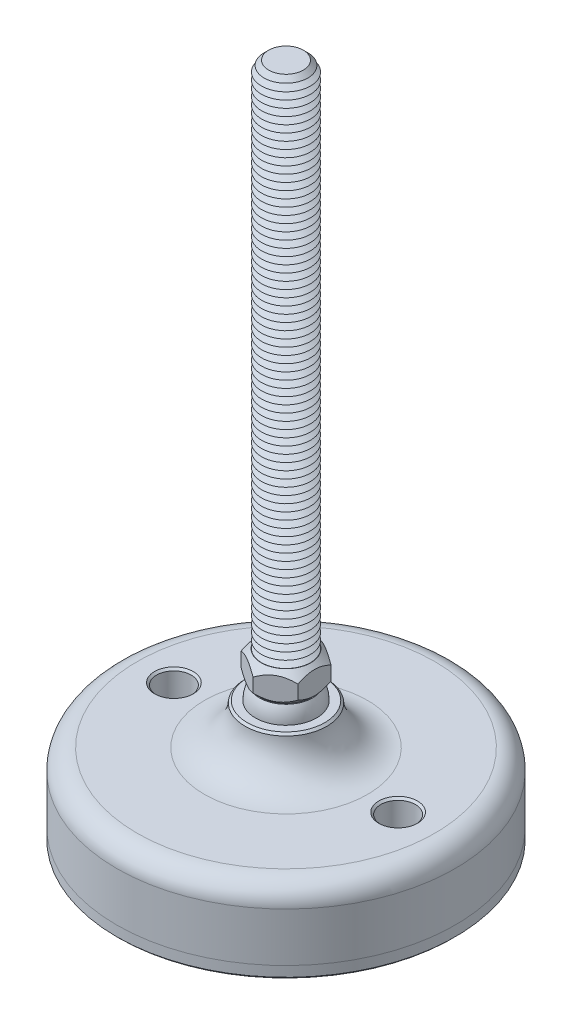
ISO-10303-21;
HEADER;
FILE_DESCRIPTION(('STEP AP214'),'2;1');
FILE_NAME('part.step','',(''),(''),'','','');
FILE_SCHEMA(('AUTOMOTIVE_DESIGN { 1 0 10303 214 1 1 1 1 }'));
ENDSEC;
DATA;
#1=APPLICATION_CONTEXT('core data for automotive mechanical design processes');
#2=APPLICATION_PROTOCOL_DEFINITION('international standard','automotive_design',2000,#1);
#3=PRODUCT_CONTEXT('',#1,'mechanical');
#4=PRODUCT('Part','Part','',(#3));
#5=PRODUCT_RELATED_PRODUCT_CATEGORY('part','',(#4));
#6=PRODUCT_DEFINITION_FORMATION('','',#4);
#7=PRODUCT_DEFINITION_CONTEXT('part definition',#1,'design');
#8=PRODUCT_DEFINITION('design','',#6,#7);
#9=PRODUCT_DEFINITION_SHAPE('','',#8);
#10=(LENGTH_UNIT() NAMED_UNIT(*) SI_UNIT(.MILLI.,.METRE.));
#11=(NAMED_UNIT(*) PLANE_ANGLE_UNIT() SI_UNIT($,.RADIAN.));
#12=(NAMED_UNIT(*) SI_UNIT($,.STERADIAN.) SOLID_ANGLE_UNIT());
#13=UNCERTAINTY_MEASURE_WITH_UNIT(LENGTH_MEASURE(1.E-05),#10,'distance_accuracy_value','');
#14=(GEOMETRIC_REPRESENTATION_CONTEXT(3) GLOBAL_UNCERTAINTY_ASSIGNED_CONTEXT((#13)) GLOBAL_UNIT_ASSIGNED_CONTEXT((#10,
#11,#12)) REPRESENTATION_CONTEXT('',''));
#15=CARTESIAN_POINT('',(0.,0.,0.));
#16=DIRECTION('',(0.,0.,1.));
#17=DIRECTION('',(1.,0.,0.));
#18=AXIS2_PLACEMENT_3D('',#15,#16,#17);
#19=CARTESIAN_POINT('',(0.,-27.,0.));
#20=DIRECTION('',(0.,1.,0.));
#21=DIRECTION('',(0.,0.,1.));
#22=AXIS2_PLACEMENT_3D('',#19,#20,#21);
#23=PLANE('',#22);
#24=CARTESIAN_POINT('',(-27.5,-27.,0.));
#25=DIRECTION('',(0.,1.,0.));
#26=DIRECTION('',(0.,0.,1.));
#27=AXIS2_PLACEMENT_3D('',#24,#25,#26);
#28=CIRCLE('',#27,4.25000000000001);
#29=CARTESIAN_POINT('',(-27.5,-27.,4.25000000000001));
#30=VERTEX_POINT('',#29);
#31=EDGE_CURVE('P0_E43',#30,#30,#28,.T.);
#32=ORIENTED_EDGE('',*,*,#31,.F.);
#33=EDGE_LOOP('',(#32));
#34=FACE_BOUND('',#33,.T.);
#35=CARTESIAN_POINT('',(27.5,-27.,0.));
#36=DIRECTION('',(0.,1.,0.));
#37=DIRECTION('',(0.,0.,1.));
#38=AXIS2_PLACEMENT_3D('',#35,#36,#37);
#39=CIRCLE('',#38,4.25000000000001);
#40=CARTESIAN_POINT('',(27.5,-27.,4.25000000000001));
#41=VERTEX_POINT('',#40);
#42=EDGE_CURVE('P0_E44',#41,#41,#39,.T.);
#43=ORIENTED_EDGE('',*,*,#42,.F.);
#44=EDGE_LOOP('',(#43));
#45=FACE_BOUND('',#44,.T.);
#46=CARTESIAN_POINT('',(0.,-27.,0.));
#47=DIRECTION('',(0.,1.,0.));
#48=DIRECTION('',(0.,0.,1.));
#49=AXIS2_PLACEMENT_3D('',#46,#47,#48);
#50=CIRCLE('',#49,41.5);
#51=CARTESIAN_POINT('',(0.,-27.,41.5));
#52=VERTEX_POINT('',#51);
#53=EDGE_CURVE('P0_E40',#52,#52,#50,.T.);
#54=ORIENTED_EDGE('',*,*,#53,.T.);
#55=EDGE_LOOP('',(#54));
#56=FACE_BOUND('',#55,.T.);
#57=ADVANCED_FACE('P0_F14',(#34,#45,#56),#23,.T.);
#58=CARTESIAN_POINT('',(0.,48.1654938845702,0.));
#59=DIRECTION('',(0.,1.,0.));
#60=DIRECTION('',(0.,0.,1.));
#61=AXIS2_PLACEMENT_3D('',#58,#59,#60);
#62=CYLINDRICAL_SURFACE('',#61,41.5);
#63=CARTESIAN_POINT('',(0.,-29.5,0.));
#64=DIRECTION('',(0.,-1.,0.));
#65=DIRECTION('',(0.,0.,-1.));
#66=AXIS2_PLACEMENT_3D('',#63,#64,#65);
#67=CIRCLE('',#66,41.5);
#68=CARTESIAN_POINT('',(0.,-29.5,-41.5));
#69=VERTEX_POINT('',#68);
#70=EDGE_CURVE('P0_E37',#69,#69,#67,.F.);
#71=ORIENTED_EDGE('',*,*,#70,.T.);
#72=EDGE_LOOP('',(#71));
#73=FACE_BOUND('',#72,.T.);
#74=ORIENTED_EDGE('',*,*,#53,.F.);
#75=EDGE_LOOP('',(#74));
#76=FACE_BOUND('',#75,.T.);
#77=ADVANCED_FACE('P0_F54',(#73,#76),#62,.T.);
#78=CARTESIAN_POINT('',(0.,-30.,41.5));
#79=DIRECTION('',(0.,-1.,0.));
#80=DIRECTION('',(0.,0.,-1.));
#81=AXIS2_PLACEMENT_3D('',#78,#79,#80);
#82=PLANE('',#81);
#83=CARTESIAN_POINT('',(27.5,-30.,0.));
#84=DIRECTION('',(0.,-1.,0.));
#85=DIRECTION('',(0.,0.,-1.));
#86=AXIS2_PLACEMENT_3D('',#83,#84,#85);
#87=CIRCLE('',#86,4.75);
#88=CARTESIAN_POINT('',(27.5,-30.,-4.75000000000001));
#89=VERTEX_POINT('',#88);
#90=EDGE_CURVE('P0_E25',#89,#89,#87,.F.);
#91=ORIENTED_EDGE('',*,*,#90,.T.);
#92=EDGE_LOOP('',(#91));
#93=FACE_BOUND('',#92,.T.);
#94=CARTESIAN_POINT('',(-27.5,-30.,0.));
#95=DIRECTION('',(0.,-1.,0.));
#96=DIRECTION('',(0.,0.,-1.));
#97=AXIS2_PLACEMENT_3D('',#94,#95,#96);
#98=CIRCLE('',#97,4.75);
#99=CARTESIAN_POINT('',(-27.5,-30.,-4.75));
#100=VERTEX_POINT('',#99);
#101=EDGE_CURVE('P0_E29',#100,#100,#98,.F.);
#102=ORIENTED_EDGE('',*,*,#101,.T.);
#103=EDGE_LOOP('',(#102));
#104=FACE_BOUND('',#103,.T.);
#105=CARTESIAN_POINT('',(0.,-30.,0.));
#106=DIRECTION('',(0.,-1.,0.));
#107=DIRECTION('',(0.,0.,-1.));
#108=AXIS2_PLACEMENT_3D('',#105,#106,#107);
#109=CIRCLE('',#108,41.);
#110=CARTESIAN_POINT('',(0.,-30.,-41.));
#111=VERTEX_POINT('',#110);
#112=EDGE_CURVE('P0_E34',#111,#111,#109,.T.);
#113=ORIENTED_EDGE('',*,*,#112,.T.);
#114=EDGE_LOOP('',(#113));
#115=FACE_BOUND('',#114,.T.);
#116=ADVANCED_FACE('P0_F61',(#93,#104,#115),#82,.T.);
#117=CARTESIAN_POINT('',(0.,-29.5,0.));
#118=DIRECTION('',(0.,1.,0.));
#119=DIRECTION('',(0.,0.,1.));
#120=AXIS2_PLACEMENT_3D('',#117,#118,#119);
#121=CONICAL_SURFACE('',#120,41.5,0.785398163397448);
#122=ORIENTED_EDGE('',*,*,#112,.F.);
#123=EDGE_LOOP('',(#122));
#124=FACE_BOUND('',#123,.T.);
#125=ORIENTED_EDGE('',*,*,#70,.F.);
#126=EDGE_LOOP('',(#125));
#127=FACE_BOUND('',#126,.T.);
#128=ADVANCED_FACE('P0_F68',(#124,#127),#121,.T.);
#129=CARTESIAN_POINT('',(27.5,-30.,0.));
#130=DIRECTION('',(0.,1.,0.));
#131=DIRECTION('',(0.,0.,1.));
#132=AXIS2_PLACEMENT_3D('',#129,#130,#131);
#133=CYLINDRICAL_SURFACE('',#132,4.25000000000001);
#134=CARTESIAN_POINT('',(27.5,-29.5,0.));
#135=DIRECTION('',(0.,-1.,0.));
#136=DIRECTION('',(0.,0.,-1.));
#137=AXIS2_PLACEMENT_3D('',#134,#135,#136);
#138=CIRCLE('',#137,4.25000000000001);
#139=CARTESIAN_POINT('',(27.5,-29.5,-4.25000000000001));
#140=VERTEX_POINT('',#139);
#141=EDGE_CURVE('P0_E21',#140,#140,#138,.T.);
#142=ORIENTED_EDGE('',*,*,#141,.T.);
#143=EDGE_LOOP('',(#142));
#144=FACE_BOUND('',#143,.T.);
#145=ORIENTED_EDGE('',*,*,#42,.T.);
#146=EDGE_LOOP('',(#145));
#147=FACE_BOUND('',#146,.T.);
#148=ADVANCED_FACE('P0_F74',(#144,#147),#133,.F.);
#149=CARTESIAN_POINT('',(-27.5,-30.,0.));
#150=DIRECTION('',(0.,1.,0.));
#151=DIRECTION('',(0.,0.,1.));
#152=AXIS2_PLACEMENT_3D('',#149,#150,#151);
#153=CYLINDRICAL_SURFACE('',#152,4.25000000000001);
#154=CARTESIAN_POINT('',(-27.5,-29.5,0.));
#155=DIRECTION('',(0.,-1.,0.));
#156=DIRECTION('',(0.,0.,-1.));
#157=AXIS2_PLACEMENT_3D('',#154,#155,#156);
#158=CIRCLE('',#157,4.25000000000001);
#159=CARTESIAN_POINT('',(-27.5,-29.5,-4.25000000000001));
#160=VERTEX_POINT('',#159);
#161=EDGE_CURVE('P0_E10',#160,#160,#158,.T.);
#162=ORIENTED_EDGE('',*,*,#161,.T.);
#163=EDGE_LOOP('',(#162));
#164=FACE_BOUND('',#163,.T.);
#165=ORIENTED_EDGE('',*,*,#31,.T.);
#166=EDGE_LOOP('',(#165));
#167=FACE_BOUND('',#166,.T.);
#168=ADVANCED_FACE('P0_F50',(#164,#167),#153,.F.);
#169=CARTESIAN_POINT('',(27.5,-30.,0.));
#170=DIRECTION('',(0.,-1.,0.));
#171=DIRECTION('',(0.,0.,-1.));
#172=AXIS2_PLACEMENT_3D('',#169,#170,#171);
#173=CONICAL_SURFACE('',#172,4.75,0.785398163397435);
#174=ORIENTED_EDGE('',*,*,#141,.F.);
#175=EDGE_LOOP('',(#174));
#176=FACE_BOUND('',#175,.T.);
#177=ORIENTED_EDGE('',*,*,#90,.F.);
#178=EDGE_LOOP('',(#177));
#179=FACE_BOUND('',#178,.T.);
#180=ADVANCED_FACE('P0_F76',(#176,#179),#173,.F.);
#181=CARTESIAN_POINT('',(-27.5,-30.,0.));
#182=DIRECTION('',(0.,-1.,0.));
#183=DIRECTION('',(0.,0.,-1.));
#184=AXIS2_PLACEMENT_3D('',#181,#182,#183);
#185=CONICAL_SURFACE('',#184,4.75,0.785398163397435);
#186=ORIENTED_EDGE('',*,*,#161,.F.);
#187=EDGE_LOOP('',(#186));
#188=FACE_BOUND('',#187,.T.);
#189=ORIENTED_EDGE('',*,*,#101,.F.);
#190=EDGE_LOOP('',(#189));
#191=FACE_BOUND('',#190,.T.);
#192=ADVANCED_FACE('P0_F16',(#188,#191),#185,.F.);
#193=CLOSED_SHELL('',(#57,#77,#116,#128,#148,#168,#180,#192));
#194=MANIFOLD_SOLID_BREP('P0_B1',#193);
#195=CARTESIAN_POINT('',(0.,0.,0.));
#196=DIRECTION('',(0.,1.,0.));
#197=DIRECTION('',(0.,0.,-1.));
#198=AXIS2_PLACEMENT_3D('',#195,#196,#197);
#199=SPHERICAL_SURFACE('',#198,7.5);
#200=CARTESIAN_POINT('',(0.,3.75,0.));
#201=DIRECTION('',(0.,-1.,0.));
#202=DIRECTION('',(0.,0.,-1.));
#203=AXIS2_PLACEMENT_3D('',#200,#201,#202);
#204=CIRCLE('',#203,6.49519052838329);
#205=CARTESIAN_POINT('',(0.,3.75,-6.49519052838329));
#206=VERTEX_POINT('',#205);
#207=EDGE_CURVE('P1_E211',#206,#206,#204,.F.);
#208=ORIENTED_EDGE('',*,*,#207,.F.);
#209=EDGE_LOOP('',(#208));
#210=FACE_BOUND('',#209,.T.);
#211=ADVANCED_FACE('P1_F16',(#210),#199,.T.);
#212=CARTESIAN_POINT('',(0.,3.75,0.));
#213=DIRECTION('',(0.,1.,0.));
#214=DIRECTION('',(0.,0.,1.));
#215=AXIS2_PLACEMENT_3D('',#212,#213,#214);
#216=CONICAL_SURFACE('',#215,6.26419292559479,0.785398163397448);
#217=CARTESIAN_POINT('',(0.,3.75,0.));
#218=DIRECTION('',(0.,1.,0.));
#219=DIRECTION('',(0.,0.,1.));
#220=AXIS2_PLACEMENT_3D('',#217,#218,#219);
#221=CIRCLE('',#220,6.26419292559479);
#222=CARTESIAN_POINT('',(0.,3.75,6.26419292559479));
#223=VERTEX_POINT('',#222);
#224=EDGE_CURVE('P1_E215',#223,#223,#221,.T.);
#225=ORIENTED_EDGE('',*,*,#224,.T.);
#226=EDGE_LOOP('',(#225));
#227=FACE_BOUND('',#226,.T.);
#228=CARTESIAN_POINT('',(-7.,8.22175145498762,-8.1400553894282));
#229=CARTESIAN_POINT('',(-7.,8.07177748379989,-7.94220937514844));
#230=CARTESIAN_POINT('',(-7.,7.92322959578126,-7.74326459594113));
#231=CARTESIAN_POINT('',(-7.,7.62962733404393,-7.34274065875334));
#232=CARTESIAN_POINT('',(-7.,7.48457383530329,-7.14116086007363));
#233=CARTESIAN_POINT('',(-7.,7.19756981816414,-6.73345531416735));
#234=CARTESIAN_POINT('',(-7.,7.05565202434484,-6.52730645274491));
#235=CARTESIAN_POINT('',(-7.,6.77703382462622,-6.11152362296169));
#236=CARTESIAN_POINT('',(-7.,6.64033305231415,-5.90188990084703));
#237=CARTESIAN_POINT('',(-7.,6.36550740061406,-5.46619755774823));
#238=CARTESIAN_POINT('',(-7.,6.22776674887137,-5.23989534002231));
#239=CARTESIAN_POINT('',(-7.,5.96123372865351,-4.78200028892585));
#240=CARTESIAN_POINT('',(-7.,5.83244279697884,-4.55040661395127));
#241=CARTESIAN_POINT('',(-7.,5.58658047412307,-4.08193183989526));
#242=CARTESIAN_POINT('',(-7.,5.46947462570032,-3.8450689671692));
#243=CARTESIAN_POINT('',(-7.,5.24960465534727,-3.36483104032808));
#244=CARTESIAN_POINT('',(-7.,5.14683397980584,-3.12145902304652));
#245=CARTESIAN_POINT('',(-7.,4.96723655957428,-2.64866791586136));
#246=CARTESIAN_POINT('',(-7.,4.88895097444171,-2.41980876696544));
#247=CARTESIAN_POINT('',(-7.,4.75072959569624,-1.9565107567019));
#248=CARTESIAN_POINT('',(-7.,4.69079504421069,-1.72207151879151));
#249=CARTESIAN_POINT('',(-7.,4.59342684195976,-1.25295119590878));
#250=CARTESIAN_POINT('',(-7.,4.5556027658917,-1.01835249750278));
#251=CARTESIAN_POINT('',(-7.,4.50320231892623,-0.546559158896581));
#252=CARTESIAN_POINT('',(-7.,4.48862178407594,-0.309364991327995));
#253=CARTESIAN_POINT('',(-7.,4.48382612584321,0.156313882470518));
#254=CARTESIAN_POINT('',(-7.,4.49271264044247,0.384789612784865));
#255=CARTESIAN_POINT('',(-7.,4.53235928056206,0.839822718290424));
#256=CARTESIAN_POINT('',(-7.,4.56312150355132,1.06637990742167));
#257=CARTESIAN_POINT('',(-7.,4.64535130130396,1.51976805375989));
#258=CARTESIAN_POINT('',(-7.,4.69717402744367,1.74653354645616));
#259=CARTESIAN_POINT('',(-7.,4.81873728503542,2.19511331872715));
#260=CARTESIAN_POINT('',(-7.,4.88847641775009,2.41692798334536));
#261=CARTESIAN_POINT('',(-7.,5.04951755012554,2.87389766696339));
#262=CARTESIAN_POINT('',(-7.,5.14215063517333,3.10857869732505));
#263=CARTESIAN_POINT('',(-7.,5.3416605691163,3.57185972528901));
#264=CARTESIAN_POINT('',(-7.,5.44854400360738,3.80045685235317));
#265=CARTESIAN_POINT('',(-7.,5.6740138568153,4.25267813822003));
#266=CARTESIAN_POINT('',(-7.,5.79263686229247,4.47628390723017));
#267=CARTESIAN_POINT('',(-7.,6.03896666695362,4.91835509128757));
#268=CARTESIAN_POINT('',(-7.,6.16667203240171,5.13682131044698));
#269=CARTESIAN_POINT('',(-7.,6.4228595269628,5.55855563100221));
#270=CARTESIAN_POINT('',(-7.,6.55098806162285,5.76203966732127));
#271=CARTESIAN_POINT('',(-7.,6.81264959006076,6.16551366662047));
#272=CARTESIAN_POINT('',(-7.,6.94618299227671,6.36550336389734));
#273=CARTESIAN_POINT('',(-7.,7.21658951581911,6.76082742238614));
#274=CARTESIAN_POINT('',(-7.,7.35342681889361,6.95618637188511));
#275=CARTESIAN_POINT('',(-7.,7.6307324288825,7.34423185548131));
#276=CARTESIAN_POINT('',(-7.,7.77119972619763,7.53691911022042));
#277=CARTESIAN_POINT('',(-7.,7.91315155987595,7.72848711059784));
#278=B_SPLINE_CURVE_WITH_KNOTS('',3,(#228,#229,#230,#231,#232,#233,#234,#235,#236,#237,#238,
#239,#240,#241,#242,#243,#244,#245,#246,#247,#248,#249,#250,#251,#252,#253,#254,#255,#256,#257,
#258,#259,#260,#261,#262,#263,#264,#265,#266,#267,#268,#269,#270,#271,#272,#273,#274,#275,#276,
#277),.UNSPECIFIED.,.F.,.F.,(4,2,2,2,2,2,2,2,2,2,2,2,2,2,2,2,2,2,2,2,2,2,2,2,4),(0.,
0.744807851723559,1.48980030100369,2.2405614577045,2.99126978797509,3.78587980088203,
4.58061708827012,5.37293691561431,6.16489332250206,6.88989369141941,7.61494312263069,
8.32676947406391,9.0384682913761,9.72332048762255,10.4082383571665,11.1052200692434,
11.8021473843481,12.5584650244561,13.3151334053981,14.0742390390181,14.8332251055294,
15.5545151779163,16.2758598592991,16.9913609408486,17.7066651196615),.UNSPECIFIED.);
#279=CARTESIAN_POINT('',(-7.,5.56871084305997,-4.04145188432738));
#280=VERTEX_POINT('',#279);
#281=CARTESIAN_POINT('',(-7.,5.56871084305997,4.04145188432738));
#282=VERTEX_POINT('',#281);
#283=EDGE_CURVE('P1_E25',#280,#282,#278,.T.);
#284=ORIENTED_EDGE('',*,*,#283,.F.);
#285=CARTESIAN_POINT('',(0.000199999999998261,5.56882631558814,-8.0830192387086));
#286=CARTESIAN_POINT('',(-0.120159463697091,5.49934419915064,-8.01352966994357));
#287=CARTESIAN_POINT('',(-0.241444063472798,5.43199440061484,-7.94350597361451));
#288=CARTESIAN_POINT('',(-0.486045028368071,5.30220807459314,-7.80228554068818));
#289=CARTESIAN_POINT('',(-0.60936245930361,5.2397742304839,-7.73108818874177));
#290=CARTESIAN_POINT('',(-0.983781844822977,5.06028719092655,-7.51491705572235));
#291=CARTESIAN_POINT('',(-1.23805341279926,4.95181416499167,-7.36811329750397));
#292=CARTESIAN_POINT('',(-1.75081233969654,4.76606165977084,-7.07207179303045));
#293=CARTESIAN_POINT('',(-2.00916864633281,4.68831421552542,-6.92290970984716));
#294=CARTESIAN_POINT('',(-2.40095049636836,4.59837958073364,-6.69671435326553));
#295=CARTESIAN_POINT('',(-2.53212124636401,4.57286115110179,-6.62098288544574));
#296=CARTESIAN_POINT('',(-2.79557335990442,4.53129725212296,-6.4688787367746));
#297=CARTESIAN_POINT('',(-2.92785455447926,4.5152503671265,-6.39250615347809));
#298=CARTESIAN_POINT('',(-3.25020698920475,4.48834537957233,-6.2063958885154));
#299=CARTESIAN_POINT('',(-3.44062555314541,4.48270029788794,-6.09645767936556));
#300=CARTESIAN_POINT('',(-3.82111946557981,4.49217587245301,-5.87677941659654));
#301=CARTESIAN_POINT('',(-4.01119467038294,4.5073038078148,-5.76703944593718));
#302=CARTESIAN_POINT('',(-4.38955306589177,4.55743368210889,-5.54859412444));
#303=CARTESIAN_POINT('',(-4.57783401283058,4.5924578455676,-5.43989006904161));
#304=CARTESIAN_POINT('',(-4.95115981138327,4.68047604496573,-5.22435031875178));
#305=CARTESIAN_POINT('',(-5.13620490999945,4.73346870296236,-5.1175144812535));
#306=CARTESIAN_POINT('',(-5.46469033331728,4.84248989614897,-4.92786333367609));
#307=CARTESIAN_POINT('',(-5.6088580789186,4.89565100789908,-4.8446280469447));
#308=CARTESIAN_POINT('',(-5.8946056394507,5.0105398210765,-4.67965161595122));
#309=CARTESIAN_POINT('',(-6.03618537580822,5.07226778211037,-4.5979105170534));
#310=CARTESIAN_POINT('',(-6.31631098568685,5.20290661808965,-4.43617992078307));
#311=CARTESIAN_POINT('',(-6.4548648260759,5.27179490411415,-4.3561858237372));
#312=CARTESIAN_POINT('',(-6.72940692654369,5.41585000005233,-4.19767886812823));
#313=CARTESIAN_POINT('',(-6.86539669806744,5.49101295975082,-4.11916513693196));
#314=CARTESIAN_POINT('',(-7.0002,5.56882631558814,-4.04133641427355));
#315=B_SPLINE_CURVE_WITH_KNOTS('',3,(#285,#286,#287,#288,#289,#290,#291,#292,#293,#294,#295,
#296,#297,#298,#299,#300,#301,#302,#303,#304,#305,#306,#307,#308,#309,#310,#311,#312,#313,#314),
.UNSPECIFIED.,.F.,.F.,(4,2,2,2,2,2,2,2,2,2,2,2,2,2,4),(0.,0.466112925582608,0.932478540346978,
1.87024464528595,2.79312018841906,3.25365289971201,3.71411676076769,4.37293813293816,
5.03199042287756,5.69178034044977,6.35151967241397,6.8755322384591,7.39956068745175,
7.92198344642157,8.44408796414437),.UNSPECIFIED.);
#316=CARTESIAN_POINT('',(0.,5.56871084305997,-8.08290376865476));
#317=VERTEX_POINT('',#316);
#318=EDGE_CURVE('P1_E116',#317,#280,#315,.T.);
#319=ORIENTED_EDGE('',*,*,#318,.F.);
#320=CARTESIAN_POINT('',(7.00019999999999,5.56882631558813,-4.04133641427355));
#321=CARTESIAN_POINT('',(6.8798405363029,5.49934419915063,-4.11082598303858));
#322=CARTESIAN_POINT('',(6.7585559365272,5.43199440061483,-4.18084967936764));
#323=CARTESIAN_POINT('',(6.51395497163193,5.30220807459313,-4.32207011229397));
#324=CARTESIAN_POINT('',(6.39063754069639,5.2397742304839,-4.39326746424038));
#325=CARTESIAN_POINT('',(6.01621815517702,5.06028719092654,-4.6094385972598));
#326=CARTESIAN_POINT('',(5.76194658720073,4.95181416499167,-4.75624235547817));
#327=CARTESIAN_POINT('',(5.24918766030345,4.76606165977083,-5.0522838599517));
#328=CARTESIAN_POINT('',(4.99083135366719,4.68831421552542,-5.20144594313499));
#329=CARTESIAN_POINT('',(4.59904950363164,4.59837958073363,-5.42764129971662));
#330=CARTESIAN_POINT('',(4.46787875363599,4.57286115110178,-5.50337276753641));
#331=CARTESIAN_POINT('',(4.20442664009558,4.53129725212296,-5.65547691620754));
#332=CARTESIAN_POINT('',(4.07214544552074,4.5152503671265,-5.73184949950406));
#333=CARTESIAN_POINT('',(3.74979301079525,4.48834537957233,-5.91795976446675));
#334=CARTESIAN_POINT('',(3.55937444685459,4.48270029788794,-6.02789797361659));
#335=CARTESIAN_POINT('',(3.17888053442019,4.49217587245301,-6.2475762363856));
#336=CARTESIAN_POINT('',(2.98880532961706,4.5073038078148,-6.35731620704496));
#337=CARTESIAN_POINT('',(2.61044693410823,4.55743368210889,-6.57576152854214));
#338=CARTESIAN_POINT('',(2.42216598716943,4.5924578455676,-6.68446558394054));
#339=CARTESIAN_POINT('',(2.04884018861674,4.68047604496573,-6.90000533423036));
#340=CARTESIAN_POINT('',(1.86379509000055,4.73346870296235,-7.00684117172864));
#341=CARTESIAN_POINT('',(1.53530966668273,4.84248989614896,-7.19649231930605));
#342=CARTESIAN_POINT('',(1.3911419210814,4.89565100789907,-7.27972760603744));
#343=CARTESIAN_POINT('',(1.1053943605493,5.0105398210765,-7.44470403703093));
#344=CARTESIAN_POINT('',(0.96381462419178,5.07226778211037,-7.52644513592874));
#345=CARTESIAN_POINT('',(0.683689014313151,5.20290661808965,-7.68817573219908));
#346=CARTESIAN_POINT('',(0.545135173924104,5.27179490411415,-7.76816982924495));
#347=CARTESIAN_POINT('',(0.270593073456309,5.41585000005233,-7.92667678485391));
#348=CARTESIAN_POINT('',(0.134603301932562,5.49101295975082,-8.00519051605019));
#349=CARTESIAN_POINT('',(-0.00020000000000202,5.56882631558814,-8.0830192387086));
#350=B_SPLINE_CURVE_WITH_KNOTS('',3,(#320,#321,#322,#323,#324,#325,#326,#327,#328,#329,#330,
#331,#332,#333,#334,#335,#336,#337,#338,#339,#340,#341,#342,#343,#344,#345,#346,#347,#348,#349),
.UNSPECIFIED.,.F.,.F.,(4,2,2,2,2,2,2,2,2,2,2,2,2,2,4),(0.,0.466112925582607,0.932478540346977,
1.87024464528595,2.79312018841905,3.25365289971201,3.71411676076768,4.37293813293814,
5.03199042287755,5.69178034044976,6.35151967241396,6.87553223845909,7.39956068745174,
7.92198344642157,8.44408796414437),.UNSPECIFIED.);
#351=CARTESIAN_POINT('',(7.,5.56871084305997,-4.04145188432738));
#352=VERTEX_POINT('',#351);
#353=EDGE_CURVE('P1_E123',#352,#317,#350,.T.);
#354=ORIENTED_EDGE('',*,*,#353,.F.);
#355=CARTESIAN_POINT('',(6.99999999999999,8.22175145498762,-8.1400553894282));
#356=CARTESIAN_POINT('',(6.99999999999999,8.07177748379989,-7.94220937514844));
#357=CARTESIAN_POINT('',(6.99999999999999,7.92322959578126,-7.74326459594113));
#358=CARTESIAN_POINT('',(6.99999999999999,7.62962733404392,-7.34274065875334));
#359=CARTESIAN_POINT('',(6.99999999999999,7.48457383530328,-7.14116086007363));
#360=CARTESIAN_POINT('',(6.99999999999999,7.19756981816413,-6.73345531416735));
#361=CARTESIAN_POINT('',(6.99999999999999,7.05565202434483,-6.52730645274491));
#362=CARTESIAN_POINT('',(6.99999999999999,6.77703382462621,-6.11152362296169));
#363=CARTESIAN_POINT('',(6.99999999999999,6.64033305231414,-5.90188990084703));
#364=CARTESIAN_POINT('',(6.99999999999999,6.36550740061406,-5.46619755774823));
#365=CARTESIAN_POINT('',(6.99999999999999,6.22776674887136,-5.23989534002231));
#366=CARTESIAN_POINT('',(6.99999999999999,5.9612337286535,-4.78200028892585));
#367=CARTESIAN_POINT('',(6.99999999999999,5.83244279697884,-4.55040661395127));
#368=CARTESIAN_POINT('',(6.99999999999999,5.58658047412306,-4.08193183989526));
#369=CARTESIAN_POINT('',(6.99999999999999,5.46947462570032,-3.8450689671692));
#370=CARTESIAN_POINT('',(6.99999999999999,5.24960465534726,-3.36483104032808));
#371=CARTESIAN_POINT('',(6.99999999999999,5.14683397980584,-3.12145902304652));
#372=CARTESIAN_POINT('',(6.99999999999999,4.96723655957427,-2.64866791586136));
#373=CARTESIAN_POINT('',(6.99999999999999,4.88895097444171,-2.41980876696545));
#374=CARTESIAN_POINT('',(6.99999999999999,4.75072959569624,-1.9565107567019));
#375=CARTESIAN_POINT('',(6.99999999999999,4.69079504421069,-1.72207151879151));
#376=CARTESIAN_POINT('',(6.99999999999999,4.59342684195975,-1.25295119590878));
#377=CARTESIAN_POINT('',(6.99999999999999,4.5556027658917,-1.01835249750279));
#378=CARTESIAN_POINT('',(6.99999999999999,4.50320231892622,-0.546559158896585));
#379=CARTESIAN_POINT('',(6.99999999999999,4.48862178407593,-0.309364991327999));
#380=CARTESIAN_POINT('',(6.99999999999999,4.48382612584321,0.156313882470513));
#381=CARTESIAN_POINT('',(6.99999999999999,4.49271264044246,0.38478961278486));
#382=CARTESIAN_POINT('',(6.99999999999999,4.53235928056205,0.83982271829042));
#383=CARTESIAN_POINT('',(6.99999999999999,4.56312150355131,1.06637990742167));
#384=CARTESIAN_POINT('',(6.99999999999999,4.64535130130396,1.51976805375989));
#385=CARTESIAN_POINT('',(6.99999999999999,4.69717402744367,1.74653354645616));
#386=CARTESIAN_POINT('',(6.99999999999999,4.81873728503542,2.19511331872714));
#387=CARTESIAN_POINT('',(7.,4.88847641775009,2.41692798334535));
#388=CARTESIAN_POINT('',(7.,5.04951755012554,2.87389766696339));
#389=CARTESIAN_POINT('',(7.,5.14215063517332,3.10857869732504));
#390=CARTESIAN_POINT('',(7.,5.34166056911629,3.571859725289));
#391=CARTESIAN_POINT('',(7.,5.44854400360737,3.80045685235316));
#392=CARTESIAN_POINT('',(7.,5.67401385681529,4.25267813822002));
#393=CARTESIAN_POINT('',(7.,5.79263686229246,4.47628390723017));
#394=CARTESIAN_POINT('',(7.,6.03896666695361,4.91835509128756));
#395=CARTESIAN_POINT('',(7.,6.1666720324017,5.13682131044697));
#396=CARTESIAN_POINT('',(7.,6.42285952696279,5.5585556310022));
#397=CARTESIAN_POINT('',(7.,6.55098806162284,5.76203966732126));
#398=CARTESIAN_POINT('',(7.,6.81264959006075,6.16551366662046));
#399=CARTESIAN_POINT('',(7.,6.9461829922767,6.36550336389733));
#400=CARTESIAN_POINT('',(7.,7.21658951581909,6.76082742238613));
#401=CARTESIAN_POINT('',(7.,7.3534268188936,6.9561863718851));
#402=CARTESIAN_POINT('',(7.,7.63073242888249,7.3442318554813));
#403=CARTESIAN_POINT('',(7.,7.77119972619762,7.53691911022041));
#404=CARTESIAN_POINT('',(7.,7.91315155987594,7.72848711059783));
#405=B_SPLINE_CURVE_WITH_KNOTS('',3,(#355,#356,#357,#358,#359,#360,#361,#362,#363,#364,#365,
#366,#367,#368,#369,#370,#371,#372,#373,#374,#375,#376,#377,#378,#379,#380,#381,#382,#383,#384,
#385,#386,#387,#388,#389,#390,#391,#392,#393,#394,#395,#396,#397,#398,#399,#400,#401,#402,#403,
#404),.UNSPECIFIED.,.F.,.F.,(4,2,2,2,2,2,2,2,2,2,2,2,2,2,2,2,2,2,2,2,2,2,2,2,4),(0.,
0.744807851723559,1.48980030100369,2.2405614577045,2.9912697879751,3.78587980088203,
4.58061708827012,5.3729369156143,6.16489332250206,6.8898936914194,7.61494312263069,
8.32676947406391,9.03846829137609,9.72332048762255,10.4082383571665,11.1052200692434,
11.8021473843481,12.5584650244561,13.3151334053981,14.0742390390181,14.8332251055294,
15.5545151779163,16.275859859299,16.9913609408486,17.7066651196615),.UNSPECIFIED.);
#406=CARTESIAN_POINT('',(6.99999999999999,5.56871084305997,4.04145188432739));
#407=VERTEX_POINT('',#406);
#408=EDGE_CURVE('P1_E71',#407,#352,#405,.F.);
#409=ORIENTED_EDGE('',*,*,#408,.F.);
#410=CARTESIAN_POINT('',(-0.000200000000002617,5.56882631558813,8.0830192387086));
#411=CARTESIAN_POINT('',(0.120159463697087,5.49934419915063,8.01352966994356));
#412=CARTESIAN_POINT('',(0.241444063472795,5.43199440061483,7.9435059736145));
#413=CARTESIAN_POINT('',(0.486045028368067,5.30220807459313,7.80228554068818));
#414=CARTESIAN_POINT('',(0.609362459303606,5.2397742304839,7.73108818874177));
#415=CARTESIAN_POINT('',(0.983781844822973,5.06028719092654,7.51491705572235));
#416=CARTESIAN_POINT('',(1.23805341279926,4.95181416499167,7.36811329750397));
#417=CARTESIAN_POINT('',(1.75081233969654,4.76606165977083,7.07207179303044));
#418=CARTESIAN_POINT('',(2.00916864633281,4.68831421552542,6.92290970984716));
#419=CARTESIAN_POINT('',(2.40095049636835,4.59837958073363,6.69671435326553));
#420=CARTESIAN_POINT('',(2.53212124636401,4.57286115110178,6.62098288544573));
#421=CARTESIAN_POINT('',(2.79557335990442,4.53129725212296,6.4688787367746));
#422=CARTESIAN_POINT('',(2.92785455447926,4.5152503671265,6.39250615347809));
#423=CARTESIAN_POINT('',(3.25020698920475,4.48834537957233,6.2063958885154));
#424=CARTESIAN_POINT('',(3.44062555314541,4.48270029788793,6.09645767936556));
#425=CARTESIAN_POINT('',(3.82111946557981,4.492175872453,5.87677941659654));
#426=CARTESIAN_POINT('',(4.01119467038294,4.5073038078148,5.76703944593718));
#427=CARTESIAN_POINT('',(4.38955306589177,4.55743368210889,5.54859412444));
#428=CARTESIAN_POINT('',(4.57783401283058,4.5924578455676,5.4398900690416));
#429=CARTESIAN_POINT('',(4.95115981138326,4.68047604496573,5.22435031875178));
#430=CARTESIAN_POINT('',(5.13620490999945,4.73346870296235,5.1175144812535));
#431=CARTESIAN_POINT('',(5.46469033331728,4.84248989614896,4.92786333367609));
#432=CARTESIAN_POINT('',(5.6088580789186,4.89565100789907,4.8446280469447));
#433=CARTESIAN_POINT('',(5.8946056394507,5.01053982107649,4.67965161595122));
#434=CARTESIAN_POINT('',(6.03618537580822,5.07226778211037,4.5979105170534));
#435=CARTESIAN_POINT('',(6.31631098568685,5.20290661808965,4.43617992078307));
#436=CARTESIAN_POINT('',(6.45486482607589,5.27179490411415,4.3561858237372));
#437=CARTESIAN_POINT('',(6.72940692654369,5.41585000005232,4.19767886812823));
#438=CARTESIAN_POINT('',(6.86539669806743,5.49101295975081,4.11916513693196));
#439=CARTESIAN_POINT('',(7.00019999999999,5.56882631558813,4.04133641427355));
#440=B_SPLINE_CURVE_WITH_KNOTS('',3,(#410,#411,#412,#413,#414,#415,#416,#417,#418,#419,#420,
#421,#422,#423,#424,#425,#426,#427,#428,#429,#430,#431,#432,#433,#434,#435,#436,#437,#438,#439),
.UNSPECIFIED.,.F.,.F.,(4,2,2,2,2,2,2,2,2,2,2,2,2,2,4),(0.,0.466112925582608,0.932478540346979,
1.87024464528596,2.79312018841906,3.25365289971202,3.71411676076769,4.37293813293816,
5.03199042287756,5.69178034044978,6.35151967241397,6.8755322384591,7.39956068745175,
7.92198344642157,8.44408796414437),.UNSPECIFIED.);
#441=CARTESIAN_POINT('',(0.,5.56871084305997,8.08290376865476));
#442=VERTEX_POINT('',#441);
#443=EDGE_CURVE('P1_E68',#442,#407,#440,.T.);
#444=ORIENTED_EDGE('',*,*,#443,.F.);
#445=CARTESIAN_POINT('',(-7.0002,5.56882631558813,4.04133641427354));
#446=CARTESIAN_POINT('',(-6.87984053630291,5.49934419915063,4.11082598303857));
#447=CARTESIAN_POINT('',(-6.7585559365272,5.43199440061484,4.18084967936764));
#448=CARTESIAN_POINT('',(-6.51395497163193,5.30220807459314,4.32207011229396));
#449=CARTESIAN_POINT('',(-6.39063754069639,5.2397742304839,4.39326746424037));
#450=CARTESIAN_POINT('',(-6.01621815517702,5.06028719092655,4.60943859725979));
#451=CARTESIAN_POINT('',(-5.76194658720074,4.95181416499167,4.75624235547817));
#452=CARTESIAN_POINT('',(-5.24918766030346,4.76606165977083,5.0522838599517));
#453=CARTESIAN_POINT('',(-4.99083135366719,4.68831421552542,5.20144594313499));
#454=CARTESIAN_POINT('',(-4.59904950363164,4.59837958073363,5.42764129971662));
#455=CARTESIAN_POINT('',(-4.46787875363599,4.57286115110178,5.50337276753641));
#456=CARTESIAN_POINT('',(-4.20442664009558,4.53129725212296,5.65547691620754));
#457=CARTESIAN_POINT('',(-4.07214544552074,4.5152503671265,5.73184949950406));
#458=CARTESIAN_POINT('',(-3.74979301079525,4.48834537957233,5.91795976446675));
#459=CARTESIAN_POINT('',(-3.55937444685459,4.48270029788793,6.02789797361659));
#460=CARTESIAN_POINT('',(-3.17888053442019,4.492175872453,6.2475762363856));
#461=CARTESIAN_POINT('',(-2.98880532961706,4.5073038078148,6.35731620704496));
#462=CARTESIAN_POINT('',(-2.61044693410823,4.55743368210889,6.57576152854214));
#463=CARTESIAN_POINT('',(-2.42216598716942,4.5924578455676,6.68446558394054));
#464=CARTESIAN_POINT('',(-2.04884018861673,4.68047604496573,6.90000533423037));
#465=CARTESIAN_POINT('',(-1.86379509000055,4.73346870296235,7.00684117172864));
#466=CARTESIAN_POINT('',(-1.53530966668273,4.84248989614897,7.19649231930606));
#467=CARTESIAN_POINT('',(-1.3911419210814,4.89565100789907,7.27972760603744));
#468=CARTESIAN_POINT('',(-1.1053943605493,5.01053982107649,7.44470403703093));
#469=CARTESIAN_POINT('',(-0.963814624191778,5.07226778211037,7.52644513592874));
#470=CARTESIAN_POINT('',(-0.683689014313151,5.20290661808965,7.68817573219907));
#471=CARTESIAN_POINT('',(-0.545135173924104,5.27179490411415,7.76816982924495));
#472=CARTESIAN_POINT('',(-0.270593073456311,5.41585000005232,7.92667678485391));
#473=CARTESIAN_POINT('',(-0.134603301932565,5.49101295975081,8.00519051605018));
#474=CARTESIAN_POINT('',(0.000199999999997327,5.56882631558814,8.0830192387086));
#475=B_SPLINE_CURVE_WITH_KNOTS('',3,(#445,#446,#447,#448,#449,#450,#451,#452,#453,#454,#455,
#456,#457,#458,#459,#460,#461,#462,#463,#464,#465,#466,#467,#468,#469,#470,#471,#472,#473,#474),
.UNSPECIFIED.,.F.,.F.,(4,2,2,2,2,2,2,2,2,2,2,2,2,2,4),(0.,0.466112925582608,0.93247854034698,
1.87024464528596,2.79312018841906,3.25365289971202,3.71411676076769,4.37293813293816,
5.03199042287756,5.69178034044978,6.35151967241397,6.8755322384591,7.39956068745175,
7.92198344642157,8.44408796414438),.UNSPECIFIED.);
#476=EDGE_CURVE('P1_E40',#282,#442,#475,.T.);
#477=ORIENTED_EDGE('',*,*,#476,.F.);
#478=EDGE_LOOP('',(#284,#319,#354,#409,#444,#477));
#479=FACE_BOUND('',#478,.T.);
#480=ADVANCED_FACE('P1_F69',(#227,#479),#216,.T.);
#481=CARTESIAN_POINT('',(0.,3.75,6.26419292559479));
#482=DIRECTION('',(0.,-1.,0.));
#483=DIRECTION('',(0.,0.,-1.));
#484=AXIS2_PLACEMENT_3D('',#481,#482,#483);
#485=PLANE('',#484);
#486=ORIENTED_EDGE('',*,*,#207,.T.);
#487=EDGE_LOOP('',(#486));
#488=FACE_BOUND('',#487,.T.);
#489=ORIENTED_EDGE('',*,*,#224,.F.);
#490=EDGE_LOOP('',(#489));
#491=FACE_BOUND('',#490,.T.);
#492=ADVANCED_FACE('P1_F107',(#488,#491),#485,.F.);
#493=CARTESIAN_POINT('',(-7.,11.,4.04145188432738));
#494=DIRECTION('',(0.5,0.,-0.866025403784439));
#495=DIRECTION('',(-0.866025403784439,0.,-0.5));
#496=AXIS2_PLACEMENT_3D('',#493,#494,#495);
#497=PLANE('',#496);
#498=DIRECTION('',(0.,-1.,0.));
#499=VECTOR('',#498,1.);
#500=CARTESIAN_POINT('',(0.,11.,8.08290376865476));
#501=LINE('',#500,#499);
#502=CARTESIAN_POINT('',(0.,8.97927405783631,8.08290376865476));
#503=VERTEX_POINT('',#502);
#504=EDGE_CURVE('P1_E82',#503,#442,#501,.T.);
#505=ORIENTED_EDGE('',*,*,#504,.F.);
#506=CARTESIAN_POINT('',(0.000199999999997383,8.97915858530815,8.0830192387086));
#507=CARTESIAN_POINT('',(-0.120159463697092,9.04864070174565,8.01352966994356));
#508=CARTESIAN_POINT('',(-0.241444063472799,9.11599050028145,7.9435059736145));
#509=CARTESIAN_POINT('',(-0.486045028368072,9.24577682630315,7.80228554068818));
#510=CARTESIAN_POINT('',(-0.609362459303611,9.30821067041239,7.73108818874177));
#511=CARTESIAN_POINT('',(-0.983781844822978,9.48769770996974,7.51491705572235));
#512=CARTESIAN_POINT('',(-1.23805341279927,9.59617073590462,7.36811329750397));
#513=CARTESIAN_POINT('',(-1.75081233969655,9.78192324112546,7.07207179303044));
#514=CARTESIAN_POINT('',(-2.00916864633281,9.85967068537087,6.92290970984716));
#515=CARTESIAN_POINT('',(-2.40095049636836,9.94960532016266,6.69671435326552));
#516=CARTESIAN_POINT('',(-2.53212124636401,9.9751237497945,6.62098288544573));
#517=CARTESIAN_POINT('',(-2.79557335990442,10.0166876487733,6.4688787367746));
#518=CARTESIAN_POINT('',(-2.92785455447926,10.0327345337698,6.39250615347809));
#519=CARTESIAN_POINT('',(-3.25020698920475,10.059639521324,6.2063958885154));
#520=CARTESIAN_POINT('',(-3.44062555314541,10.0652846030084,6.09645767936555));
#521=CARTESIAN_POINT('',(-3.82111946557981,10.0558090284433,5.87677941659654));
#522=CARTESIAN_POINT('',(-4.01119467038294,10.0406810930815,5.76703944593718));
#523=CARTESIAN_POINT('',(-4.38955306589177,9.9905512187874,5.54859412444));
#524=CARTESIAN_POINT('',(-4.57783401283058,9.95552705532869,5.4398900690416));
#525=CARTESIAN_POINT('',(-4.95115981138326,9.86750885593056,5.22435031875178));
#526=CARTESIAN_POINT('',(-5.13620490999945,9.81451619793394,5.1175144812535));
#527=CARTESIAN_POINT('',(-5.46469033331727,9.70549500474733,4.92786333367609));
#528=CARTESIAN_POINT('',(-5.6088580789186,9.65233389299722,4.8446280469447));
#529=CARTESIAN_POINT('',(-5.8946056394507,9.5374450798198,4.67965161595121));
#530=CARTESIAN_POINT('',(-6.03618537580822,9.47571711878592,4.5979105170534));
#531=CARTESIAN_POINT('',(-6.31631098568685,9.34507828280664,4.43617992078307));
#532=CARTESIAN_POINT('',(-6.4548648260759,9.27618999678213,4.35618582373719));
#533=CARTESIAN_POINT('',(-6.72940692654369,9.13213490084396,4.19767886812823));
#534=CARTESIAN_POINT('',(-6.86539669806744,9.05697194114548,4.11916513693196));
#535=CARTESIAN_POINT('',(-7.0002,8.97915858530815,4.04133641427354));
#536=B_SPLINE_CURVE_WITH_KNOTS('',3,(#506,#507,#508,#509,#510,#511,#512,#513,#514,#515,#516,
#517,#518,#519,#520,#521,#522,#523,#524,#525,#526,#527,#528,#529,#530,#531,#532,#533,#534,#535),
.UNSPECIFIED.,.F.,.F.,(4,2,2,2,2,2,2,2,2,2,2,2,2,2,4),(0.,0.466112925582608,0.932478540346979,
1.87024464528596,2.79312018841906,3.25365289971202,3.71411676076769,4.37293813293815,
5.03199042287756,5.69178034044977,6.35151967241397,6.87553223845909,7.39956068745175,
7.92198344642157,8.44408796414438),.UNSPECIFIED.);
#537=CARTESIAN_POINT('',(-7.,8.97927405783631,4.04145188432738));
#538=VERTEX_POINT('',#537);
#539=EDGE_CURVE('P1_E153',#503,#538,#536,.T.);
#540=ORIENTED_EDGE('',*,*,#539,.T.);
#541=DIRECTION('',(0.,-1.,0.));
#542=VECTOR('',#541,1.);
#543=CARTESIAN_POINT('',(-7.,11.,4.04145188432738));
#544=LINE('',#543,#542);
#545=EDGE_CURVE('P1_E84',#538,#282,#544,.T.);
#546=ORIENTED_EDGE('',*,*,#545,.T.);
#547=ORIENTED_EDGE('',*,*,#476,.T.);
#548=EDGE_LOOP('',(#505,#540,#546,#547));
#549=FACE_BOUND('',#548,.T.);
#550=ADVANCED_FACE('P1_F80',(#549),#497,.F.);
#551=CARTESIAN_POINT('',(0.,11.,8.08290376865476));
#552=DIRECTION('',(-0.5,0.,-0.866025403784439));
#553=DIRECTION('',(-0.866025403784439,0.,0.5));
#554=AXIS2_PLACEMENT_3D('',#551,#552,#553);
#555=PLANE('',#554);
#556=DIRECTION('',(0.,-1.,0.));
#557=VECTOR('',#556,1.);
#558=CARTESIAN_POINT('',(7.,11.,4.04145188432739));
#559=LINE('',#558,#557);
#560=CARTESIAN_POINT('',(7.,8.97927405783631,4.04145188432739));
#561=VERTEX_POINT('',#560);
#562=EDGE_CURVE('P1_E89',#561,#407,#559,.T.);
#563=ORIENTED_EDGE('',*,*,#562,.F.);
#564=CARTESIAN_POINT('',(7.0002,8.97915858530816,4.04133641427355));
#565=CARTESIAN_POINT('',(6.87984053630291,9.04864070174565,4.11082598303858));
#566=CARTESIAN_POINT('',(6.7585559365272,9.11599050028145,4.18084967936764));
#567=CARTESIAN_POINT('',(6.51395497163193,9.24577682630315,4.32207011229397));
#568=CARTESIAN_POINT('',(6.39063754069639,9.30821067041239,4.39326746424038));
#569=CARTESIAN_POINT('',(6.01621815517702,9.48769770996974,4.6094385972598));
#570=CARTESIAN_POINT('',(5.76194658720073,9.59617073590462,4.75624235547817));
#571=CARTESIAN_POINT('',(5.24918766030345,9.78192324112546,5.0522838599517));
#572=CARTESIAN_POINT('',(4.99083135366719,9.85967068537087,5.20144594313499));
#573=CARTESIAN_POINT('',(4.59904950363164,9.94960532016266,5.42764129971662));
#574=CARTESIAN_POINT('',(4.46787875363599,9.9751237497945,5.50337276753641));
#575=CARTESIAN_POINT('',(4.20442664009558,10.0166876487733,5.65547691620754));
#576=CARTESIAN_POINT('',(4.07214544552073,10.0327345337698,5.73184949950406));
#577=CARTESIAN_POINT('',(3.74979301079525,10.059639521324,5.91795976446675));
#578=CARTESIAN_POINT('',(3.55937444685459,10.0652846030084,6.02789797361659));
#579=CARTESIAN_POINT('',(3.17888053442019,10.0558090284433,6.2475762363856));
#580=CARTESIAN_POINT('',(2.98880532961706,10.0406810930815,6.35731620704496));
#581=CARTESIAN_POINT('',(2.61044693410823,9.9905512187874,6.57576152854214));
#582=CARTESIAN_POINT('',(2.42216598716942,9.95552705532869,6.68446558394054));
#583=CARTESIAN_POINT('',(2.04884018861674,9.86750885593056,6.90000533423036));
#584=CARTESIAN_POINT('',(1.86379509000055,9.81451619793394,7.00684117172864));
#585=CARTESIAN_POINT('',(1.53530966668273,9.70549500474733,7.19649231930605));
#586=CARTESIAN_POINT('',(1.3911419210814,9.65233389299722,7.27972760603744));
#587=CARTESIAN_POINT('',(1.1053943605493,9.5374450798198,7.44470403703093));
#588=CARTESIAN_POINT('',(0.963814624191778,9.47571711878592,7.52644513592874));
#589=CARTESIAN_POINT('',(0.683689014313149,9.34507828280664,7.68817573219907));
#590=CARTESIAN_POINT('',(0.545135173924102,9.27618999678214,7.76816982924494));
#591=CARTESIAN_POINT('',(0.270593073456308,9.13213490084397,7.92667678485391));
#592=CARTESIAN_POINT('',(0.134603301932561,9.05697194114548,8.00519051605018));
#593=CARTESIAN_POINT('',(-0.000200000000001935,8.97915858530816,8.0830192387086));
#594=B_SPLINE_CURVE_WITH_KNOTS('',3,(#564,#565,#566,#567,#568,#569,#570,#571,#572,#573,#574,
#575,#576,#577,#578,#579,#580,#581,#582,#583,#584,#585,#586,#587,#588,#589,#590,#591,#592,#593),
.UNSPECIFIED.,.F.,.F.,(4,2,2,2,2,2,2,2,2,2,2,2,2,2,4),(0.,0.466112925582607,0.932478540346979,
1.87024464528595,2.79312018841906,3.25365289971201,3.71411676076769,4.37293813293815,
5.03199042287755,5.69178034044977,6.35151967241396,6.87553223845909,7.39956068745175,
7.92198344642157,8.44408796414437),.UNSPECIFIED.);
#595=EDGE_CURVE('P1_E88',#561,#503,#594,.T.);
#596=ORIENTED_EDGE('',*,*,#595,.T.);
#597=ORIENTED_EDGE('',*,*,#504,.T.);
#598=ORIENTED_EDGE('',*,*,#443,.T.);
#599=EDGE_LOOP('',(#563,#596,#597,#598));
#600=FACE_BOUND('',#599,.T.);
#601=ADVANCED_FACE('P1_F87',(#600),#555,.F.);
#602=CARTESIAN_POINT('',(7.,11.,4.04145188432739));
#603=DIRECTION('',(-1.,0.,0.));
#604=DIRECTION('',(0.,0.,1.));
#605=AXIS2_PLACEMENT_3D('',#602,#603,#604);
#606=PLANE('',#605);
#607=DIRECTION('',(0.,-1.,0.));
#608=VECTOR('',#607,1.);
#609=CARTESIAN_POINT('',(6.99999999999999,11.,-4.04145188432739));
#610=LINE('',#609,#608);
#611=CARTESIAN_POINT('',(7.,8.97927405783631,-4.04145188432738));
#612=VERTEX_POINT('',#611);
#613=EDGE_CURVE('P1_E92',#612,#352,#610,.T.);
#614=ORIENTED_EDGE('',*,*,#613,.F.);
#615=CARTESIAN_POINT('',(6.99999999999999,6.38657431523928,-8.06030460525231));
#616=CARTESIAN_POINT('',(6.99999999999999,6.53472070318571,-7.86404504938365));
#617=CARTESIAN_POINT('',(6.99999999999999,6.68143506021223,-7.66668664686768));
#618=CARTESIAN_POINT('',(6.99999999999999,6.97135854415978,-7.26933868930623));
#619=CARTESIAN_POINT('',(6.99999999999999,7.1145667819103,-7.06934848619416));
#620=CARTESIAN_POINT('',(6.99999999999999,7.39785506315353,-6.66484054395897));
#621=CARTESIAN_POINT('',(6.99999999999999,7.53790227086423,-6.4602997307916));
#622=CARTESIAN_POINT('',(6.99999999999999,7.81276929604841,-6.04774624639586));
#623=CARTESIAN_POINT('',(6.99999999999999,7.94758948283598,-5.83973382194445));
#624=CARTESIAN_POINT('',(6.99999999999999,8.21836349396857,-5.40767991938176));
#625=CARTESIAN_POINT('',(6.99999999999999,8.35394167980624,-5.18340182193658));
#626=CARTESIAN_POINT('',(6.99999999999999,8.61617794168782,-4.72961052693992));
#627=CARTESIAN_POINT('',(6.99999999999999,8.74283460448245,-4.50009650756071));
#628=CARTESIAN_POINT('',(6.99999999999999,8.98449500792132,-4.03585471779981));
#629=CARTESIAN_POINT('',(6.99999999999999,9.09953301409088,-3.80114492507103));
#630=CARTESIAN_POINT('',(6.99999999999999,9.31538083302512,-3.32532417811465));
#631=CARTESIAN_POINT('',(6.99999999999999,9.41619708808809,-3.08421618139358));
#632=CARTESIAN_POINT('',(6.99999999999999,9.59261477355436,-2.61490679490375));
#633=CARTESIAN_POINT('',(6.99999999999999,9.66959244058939,-2.38722816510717));
#634=CARTESIAN_POINT('',(6.99999999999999,9.80528213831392,-1.92638931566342));
#635=CARTESIAN_POINT('',(6.99999999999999,9.86399291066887,-1.69322871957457));
#636=CARTESIAN_POINT('',(6.99999999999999,9.95910606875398,-1.22669621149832));
#637=CARTESIAN_POINT('',(6.99999999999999,9.9958906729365,-0.993403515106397));
#638=CARTESIAN_POINT('',(6.99999999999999,10.0464375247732,-0.524324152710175));
#639=CARTESIAN_POINT('',(6.99999999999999,10.0602037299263,-0.288537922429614));
#640=CARTESIAN_POINT('',(6.99999999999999,10.0636914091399,0.174669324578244));
#641=CARTESIAN_POINT('',(6.99999999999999,10.0542651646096,0.402084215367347));
#642=CARTESIAN_POINT('',(6.99999999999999,10.0137689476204,0.854966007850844));
#643=CARTESIAN_POINT('',(6.99999999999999,9.98269687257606,1.080432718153));
#644=CARTESIAN_POINT('',(6.99999999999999,9.90007567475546,1.53159825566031));
#645=CARTESIAN_POINT('',(6.99999999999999,9.84817808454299,1.75723223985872));
#646=CARTESIAN_POINT('',(6.99999999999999,9.72667364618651,2.20358388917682));
#647=CARTESIAN_POINT('',(7.,9.65706827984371,2.42430196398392));
#648=CARTESIAN_POINT('',(7.,9.49585307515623,2.88081008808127));
#649=CARTESIAN_POINT('',(7.,9.40279568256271,3.11608373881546));
#650=CARTESIAN_POINT('',(7.,9.20239444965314,3.58051976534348));
#651=CARTESIAN_POINT('',(7.,9.09504395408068,3.8096792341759));
#652=CARTESIAN_POINT('',(7.,8.86861061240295,4.26300681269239));
#653=CARTESIAN_POINT('',(7.,8.74949092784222,4.48715637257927));
#654=CARTESIAN_POINT('',(7.,8.50215207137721,4.93029722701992));
#655=CARTESIAN_POINT('',(7.,8.37393434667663,5.14928933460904));
#656=CARTESIAN_POINT('',(7.,8.11675254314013,5.57201416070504));
#657=CARTESIAN_POINT('',(7.,7.98814324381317,5.7759638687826));
#658=CARTESIAN_POINT('',(7.,7.72551640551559,6.1803619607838));
#659=CARTESIAN_POINT('',(7.,7.59149845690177,6.3808100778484));
#660=CARTESIAN_POINT('',(7.,7.32012806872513,6.77703781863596));
#661=CARTESIAN_POINT('',(7.,7.18281155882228,6.97284213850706));
#662=CARTESIAN_POINT('',(7.,6.90454718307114,7.36177489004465));
#663=CARTESIAN_POINT('',(7.,6.76360032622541,7.55490404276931));
#664=CARTESIAN_POINT('',(7.,6.62116922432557,7.74691297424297));
#665=B_SPLINE_CURVE_WITH_KNOTS('',3,(#615,#616,#617,#618,#619,#620,#621,#622,#623,#624,#625,
#626,#627,#628,#629,#630,#631,#632,#633,#634,#635,#636,#637,#638,#639,#640,#641,#642,#643,#644,
#645,#646,#647,#648,#649,#650,#651,#652,#653,#654,#655,#656,#657,#658,#659,#660,#661,#662,#663,
#664),.UNSPECIFIED.,.F.,.F.,(4,2,2,2,2,2,2,2,2,2,2,2,2,2,2,2,2,2,2,2,2,2,2,2,4),(0.,
0.73770456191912,1.47559431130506,2.21920144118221,2.96275593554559,3.74880908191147,
4.53498646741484,5.31877306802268,6.10220347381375,6.82258884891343,7.54302383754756,
8.2505020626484,8.95785864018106,9.63961191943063,10.3214314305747,11.0151699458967,
11.7088504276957,12.4672854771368,13.2260749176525,13.9873195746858,14.7484434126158,
15.4716843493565,16.1949801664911,16.912400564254,17.6296236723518),.UNSPECIFIED.);
#666=EDGE_CURVE('P1_E154',#612,#561,#665,.T.);
#667=ORIENTED_EDGE('',*,*,#666,.T.);
#668=ORIENTED_EDGE('',*,*,#562,.T.);
#669=ORIENTED_EDGE('',*,*,#408,.T.);
#670=EDGE_LOOP('',(#614,#667,#668,#669));
#671=FACE_BOUND('',#670,.T.);
#672=ADVANCED_FACE('P1_F144',(#671),#606,.F.);
#673=CARTESIAN_POINT('',(6.99999999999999,11.,-4.04145188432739));
#674=DIRECTION('',(-0.5,0.,0.866025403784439));
#675=DIRECTION('',(0.866025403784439,0.,0.5));
#676=AXIS2_PLACEMENT_3D('',#673,#674,#675);
#677=PLANE('',#676);
#678=DIRECTION('',(0.,-1.,0.));
#679=VECTOR('',#678,1.);
#680=CARTESIAN_POINT('',(0.,11.,-8.08290376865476));
#681=LINE('',#680,#679);
#682=CARTESIAN_POINT('',(0.,8.97927405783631,-8.08290376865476));
#683=VERTEX_POINT('',#682);
#684=EDGE_CURVE('P1_E1502',#683,#317,#681,.T.);
#685=ORIENTED_EDGE('',*,*,#684,.F.);
#686=CARTESIAN_POINT('',(-0.000200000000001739,8.97915858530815,-8.0830192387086));
#687=CARTESIAN_POINT('',(0.120159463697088,9.04864070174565,-8.01352966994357));
#688=CARTESIAN_POINT('',(0.241444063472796,9.11599050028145,-7.94350597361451));
#689=CARTESIAN_POINT('',(0.48604502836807,9.24577682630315,-7.80228554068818));
#690=CARTESIAN_POINT('',(0.609362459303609,9.30821067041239,-7.73108818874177));
#691=CARTESIAN_POINT('',(0.983781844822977,9.48769770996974,-7.51491705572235));
#692=CARTESIAN_POINT('',(1.23805341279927,9.59617073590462,-7.36811329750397));
#693=CARTESIAN_POINT('',(1.75081233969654,9.78192324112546,-7.07207179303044));
#694=CARTESIAN_POINT('',(2.00916864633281,9.85967068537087,-6.92290970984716));
#695=CARTESIAN_POINT('',(2.40095049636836,9.94960532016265,-6.69671435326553));
#696=CARTESIAN_POINT('',(2.53212124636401,9.9751237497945,-6.62098288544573));
#697=CARTESIAN_POINT('',(2.79557335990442,10.0166876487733,-6.4688787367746));
#698=CARTESIAN_POINT('',(2.92785455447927,10.0327345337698,-6.39250615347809));
#699=CARTESIAN_POINT('',(3.25020698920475,10.059639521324,-6.2063958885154));
#700=CARTESIAN_POINT('',(3.44062555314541,10.0652846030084,-6.09645767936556));
#701=CARTESIAN_POINT('',(3.82111946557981,10.0558090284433,-5.87677941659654));
#702=CARTESIAN_POINT('',(4.01119467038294,10.0406810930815,-5.76703944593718));
#703=CARTESIAN_POINT('',(4.38955306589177,9.9905512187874,-5.54859412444));
#704=CARTESIAN_POINT('',(4.57783401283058,9.95552705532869,-5.4398900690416));
#705=CARTESIAN_POINT('',(4.95115981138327,9.86750885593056,-5.22435031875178));
#706=CARTESIAN_POINT('',(5.13620490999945,9.81451619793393,-5.1175144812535));
#707=CARTESIAN_POINT('',(5.46469033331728,9.70549500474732,-4.92786333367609));
#708=CARTESIAN_POINT('',(5.6088580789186,9.65233389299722,-4.8446280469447));
#709=CARTESIAN_POINT('',(5.8946056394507,9.5374450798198,-4.67965161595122));
#710=CARTESIAN_POINT('',(6.03618537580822,9.47571711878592,-4.5979105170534));
#711=CARTESIAN_POINT('',(6.31631098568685,9.34507828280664,-4.43617992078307));
#712=CARTESIAN_POINT('',(6.45486482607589,9.27618999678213,-4.3561858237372));
#713=CARTESIAN_POINT('',(6.72940692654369,9.13213490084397,-4.19767886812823));
#714=CARTESIAN_POINT('',(6.86539669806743,9.05697194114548,-4.11916513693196));
#715=CARTESIAN_POINT('',(7.00019999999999,8.97915858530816,-4.04133641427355));
#716=B_SPLINE_CURVE_WITH_KNOTS('',3,(#686,#687,#688,#689,#690,#691,#692,#693,#694,#695,#696,
#697,#698,#699,#700,#701,#702,#703,#704,#705,#706,#707,#708,#709,#710,#711,#712,#713,#714,#715),
.UNSPECIFIED.,.F.,.F.,(4,2,2,2,2,2,2,2,2,2,2,2,2,2,4),(0.,0.466112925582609,0.932478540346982,
1.87024464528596,2.79312018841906,3.25365289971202,3.7141167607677,4.37293813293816,
5.03199042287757,5.69178034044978,6.35151967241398,6.8755322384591,7.39956068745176,
7.92198344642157,8.44408796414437),.UNSPECIFIED.);
#717=EDGE_CURVE('P1_E184',#683,#612,#716,.T.);
#718=ORIENTED_EDGE('',*,*,#717,.T.);
#719=ORIENTED_EDGE('',*,*,#613,.T.);
#720=ORIENTED_EDGE('',*,*,#353,.T.);
#721=EDGE_LOOP('',(#685,#718,#719,#720));
#722=FACE_BOUND('',#721,.T.);
#723=ADVANCED_FACE('P1_F189',(#722),#677,.F.);
#724=CARTESIAN_POINT('',(0.,11.,-8.08290376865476));
#725=DIRECTION('',(0.5,0.,0.866025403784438));
#726=DIRECTION('',(0.866025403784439,0.,-0.5));
#727=AXIS2_PLACEMENT_3D('',#724,#725,#726);
#728=PLANE('',#727);
#729=DIRECTION('',(0.,-1.,0.));
#730=VECTOR('',#729,1.);
#731=CARTESIAN_POINT('',(-7.,11.,-4.04145188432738));
#732=LINE('',#731,#730);
#733=CARTESIAN_POINT('',(-7.,8.97927405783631,-4.04145188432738));
#734=VERTEX_POINT('',#733);
#735=EDGE_CURVE('P1_E1504',#734,#280,#732,.T.);
#736=ORIENTED_EDGE('',*,*,#735,.F.);
#737=CARTESIAN_POINT('',(-7.0002,8.97915858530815,-4.04133641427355));
#738=CARTESIAN_POINT('',(-6.87984053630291,9.04864070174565,-4.11082598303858));
#739=CARTESIAN_POINT('',(-6.7585559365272,9.11599050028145,-4.18084967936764));
#740=CARTESIAN_POINT('',(-6.51395497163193,9.24577682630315,-4.32207011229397));
#741=CARTESIAN_POINT('',(-6.39063754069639,9.30821067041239,-4.39326746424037));
#742=CARTESIAN_POINT('',(-6.01621815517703,9.48769770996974,-4.6094385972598));
#743=CARTESIAN_POINT('',(-5.76194658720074,9.59617073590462,-4.75624235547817));
#744=CARTESIAN_POINT('',(-5.24918766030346,9.78192324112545,-5.0522838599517));
#745=CARTESIAN_POINT('',(-4.99083135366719,9.85967068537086,-5.20144594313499));
#746=CARTESIAN_POINT('',(-4.59904950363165,9.94960532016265,-5.42764129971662));
#747=CARTESIAN_POINT('',(-4.467878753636,9.9751237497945,-5.50337276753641));
#748=CARTESIAN_POINT('',(-4.20442664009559,10.0166876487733,-5.65547691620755));
#749=CARTESIAN_POINT('',(-4.07214544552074,10.0327345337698,-5.73184949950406));
#750=CARTESIAN_POINT('',(-3.74979301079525,10.059639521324,-5.91795976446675));
#751=CARTESIAN_POINT('',(-3.55937444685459,10.0652846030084,-6.02789797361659));
#752=CARTESIAN_POINT('',(-3.17888053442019,10.0558090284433,-6.24757623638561));
#753=CARTESIAN_POINT('',(-2.98880532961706,10.0406810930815,-6.35731620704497));
#754=CARTESIAN_POINT('',(-2.61044693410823,9.9905512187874,-6.57576152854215));
#755=CARTESIAN_POINT('',(-2.42216598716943,9.95552705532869,-6.68446558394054));
#756=CARTESIAN_POINT('',(-2.04884018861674,9.86750885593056,-6.90000533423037));
#757=CARTESIAN_POINT('',(-1.86379509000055,9.81451619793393,-7.00684117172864));
#758=CARTESIAN_POINT('',(-1.53530966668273,9.70549500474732,-7.19649231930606));
#759=CARTESIAN_POINT('',(-1.39114192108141,9.65233389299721,-7.27972760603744));
#760=CARTESIAN_POINT('',(-1.10539436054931,9.53744507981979,-7.44470403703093));
#761=CARTESIAN_POINT('',(-0.963814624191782,9.47571711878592,-7.52644513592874));
#762=CARTESIAN_POINT('',(-0.683689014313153,9.34507828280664,-7.68817573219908));
#763=CARTESIAN_POINT('',(-0.545135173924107,9.27618999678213,-7.76816982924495));
#764=CARTESIAN_POINT('',(-0.270593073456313,9.13213490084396,-7.92667678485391));
#765=CARTESIAN_POINT('',(-0.134603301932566,9.05697194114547,-8.00519051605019));
#766=CARTESIAN_POINT('',(0.000199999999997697,8.97915858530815,-8.0830192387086));
#767=B_SPLINE_CURVE_WITH_KNOTS('',3,(#737,#738,#739,#740,#741,#742,#743,#744,#745,#746,#747,
#748,#749,#750,#751,#752,#753,#754,#755,#756,#757,#758,#759,#760,#761,#762,#763,#764,#765,#766),
.UNSPECIFIED.,.F.,.F.,(4,2,2,2,2,2,2,2,2,2,2,2,2,2,4),(0.,0.466112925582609,0.932478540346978,
1.87024464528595,2.79312018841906,3.25365289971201,3.71411676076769,4.37293813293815,
5.03199042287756,5.69178034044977,6.35151967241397,6.87553223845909,7.39956068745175,
7.92198344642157,8.44408796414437),.UNSPECIFIED.);
#768=EDGE_CURVE('P1_E32',#734,#683,#767,.T.);
#769=ORIENTED_EDGE('',*,*,#768,.T.);
#770=ORIENTED_EDGE('',*,*,#684,.T.);
#771=ORIENTED_EDGE('',*,*,#318,.T.);
#772=EDGE_LOOP('',(#736,#769,#770,#771));
#773=FACE_BOUND('',#772,.T.);
#774=ADVANCED_FACE('P1_F192',(#773),#728,.F.);
#775=CARTESIAN_POINT('',(-7.,11.,-4.04145188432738));
#776=DIRECTION('',(1.,0.,0.));
#777=DIRECTION('',(0.,0.,-1.));
#778=AXIS2_PLACEMENT_3D('',#775,#776,#777);
#779=PLANE('',#778);
#780=ORIENTED_EDGE('',*,*,#545,.F.);
#781=CARTESIAN_POINT('',(-7.,6.38657431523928,-8.06030460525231));
#782=CARTESIAN_POINT('',(-7.,6.53472070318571,-7.86404504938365));
#783=CARTESIAN_POINT('',(-7.,6.68143506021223,-7.66668664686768));
#784=CARTESIAN_POINT('',(-7.,6.97135854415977,-7.26933868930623));
#785=CARTESIAN_POINT('',(-7.,7.11456678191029,-7.06934848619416));
#786=CARTESIAN_POINT('',(-7.,7.39785506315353,-6.66484054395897));
#787=CARTESIAN_POINT('',(-7.,7.53790227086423,-6.4602997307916));
#788=CARTESIAN_POINT('',(-7.,7.81276929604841,-6.04774624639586));
#789=CARTESIAN_POINT('',(-7.,7.94758948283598,-5.83973382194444));
#790=CARTESIAN_POINT('',(-7.,8.21836349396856,-5.40767991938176));
#791=CARTESIAN_POINT('',(-7.,8.35394167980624,-5.18340182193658));
#792=CARTESIAN_POINT('',(-7.,8.61617794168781,-4.72961052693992));
#793=CARTESIAN_POINT('',(-7.,8.74283460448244,-4.50009650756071));
#794=CARTESIAN_POINT('',(-7.,8.98449500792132,-4.03585471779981));
#795=CARTESIAN_POINT('',(-7.,9.09953301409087,-3.80114492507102));
#796=CARTESIAN_POINT('',(-7.,9.31538083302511,-3.32532417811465));
#797=CARTESIAN_POINT('',(-7.,9.41619708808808,-3.08421618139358));
#798=CARTESIAN_POINT('',(-7.,9.59261477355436,-2.61490679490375));
#799=CARTESIAN_POINT('',(-7.,9.66959244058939,-2.38722816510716));
#800=CARTESIAN_POINT('',(-7.,9.80528213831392,-1.92638931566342));
#801=CARTESIAN_POINT('',(-7.,9.86399291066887,-1.69322871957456));
#802=CARTESIAN_POINT('',(-7.,9.95910606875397,-1.22669621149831));
#803=CARTESIAN_POINT('',(-7.,9.99589067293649,-0.993403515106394));
#804=CARTESIAN_POINT('',(-7.,10.0464375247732,-0.524324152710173));
#805=CARTESIAN_POINT('',(-7.,10.0602037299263,-0.288537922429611));
#806=CARTESIAN_POINT('',(-7.,10.0636914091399,0.174669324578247));
#807=CARTESIAN_POINT('',(-7.,10.0542651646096,0.402084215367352));
#808=CARTESIAN_POINT('',(-7.,10.0137689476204,0.854966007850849));
#809=CARTESIAN_POINT('',(-7.,9.98269687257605,1.08043271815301));
#810=CARTESIAN_POINT('',(-7.,9.90007567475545,1.53159825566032));
#811=CARTESIAN_POINT('',(-7.,9.84817808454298,1.75723223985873));
#812=CARTESIAN_POINT('',(-7.,9.72667364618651,2.20358388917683));
#813=CARTESIAN_POINT('',(-7.,9.65706827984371,2.42430196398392));
#814=CARTESIAN_POINT('',(-7.,9.49585307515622,2.88081008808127));
#815=CARTESIAN_POINT('',(-7.,9.40279568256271,3.11608373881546));
#816=CARTESIAN_POINT('',(-7.,9.20239444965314,3.58051976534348));
#817=CARTESIAN_POINT('',(-7.,9.09504395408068,3.80967923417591));
#818=CARTESIAN_POINT('',(-7.,8.86861061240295,4.2630068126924));
#819=CARTESIAN_POINT('',(-7.,8.74949092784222,4.48715637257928));
#820=CARTESIAN_POINT('',(-7.,8.5021520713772,4.93029722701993));
#821=CARTESIAN_POINT('',(-7.,8.37393434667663,5.14928933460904));
#822=CARTESIAN_POINT('',(-7.,8.11675254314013,5.57201416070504));
#823=CARTESIAN_POINT('',(-7.,7.98814324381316,5.7759638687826));
#824=CARTESIAN_POINT('',(-7.,7.72551640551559,6.1803619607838));
#825=CARTESIAN_POINT('',(-7.,7.59149845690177,6.3808100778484));
#826=CARTESIAN_POINT('',(-7.,7.32012806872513,6.77703781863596));
#827=CARTESIAN_POINT('',(-7.,7.18281155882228,6.97284213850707));
#828=CARTESIAN_POINT('',(-7.,6.90454718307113,7.36177489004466));
#829=CARTESIAN_POINT('',(-7.,6.7636003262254,7.55490404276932));
#830=CARTESIAN_POINT('',(-7.,6.62116922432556,7.74691297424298));
#831=B_SPLINE_CURVE_WITH_KNOTS('',3,(#781,#782,#783,#784,#785,#786,#787,#788,#789,#790,#791,
#792,#793,#794,#795,#796,#797,#798,#799,#800,#801,#802,#803,#804,#805,#806,#807,#808,#809,#810,
#811,#812,#813,#814,#815,#816,#817,#818,#819,#820,#821,#822,#823,#824,#825,#826,#827,#828,#829,
#830),.UNSPECIFIED.,.F.,.F.,(4,2,2,2,2,2,2,2,2,2,2,2,2,2,2,2,2,2,2,2,2,2,2,2,4),(0.,
0.737704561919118,1.47559431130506,2.21920144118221,2.96275593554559,3.74880908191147,
4.53498646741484,5.31877306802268,6.10220347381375,6.82258884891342,7.54302383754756,
8.2505020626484,8.95785864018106,9.63961191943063,10.3214314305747,11.0151699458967,
11.7088504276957,12.4672854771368,13.2260749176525,13.9873195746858,14.7484434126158,
15.4716843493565,16.1949801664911,16.912400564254,17.6296236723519),.UNSPECIFIED.);
#832=EDGE_CURVE('P1_E172',#538,#734,#831,.F.);
#833=ORIENTED_EDGE('',*,*,#832,.T.);
#834=ORIENTED_EDGE('',*,*,#735,.T.);
#835=ORIENTED_EDGE('',*,*,#283,.T.);
#836=EDGE_LOOP('',(#780,#833,#834,#835));
#837=FACE_BOUND('',#836,.T.);
#838=ADVANCED_FACE('P1_F100',(#837),#779,.F.);
#839=CARTESIAN_POINT('',(0.,8.97927405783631,0.));
#840=DIRECTION('',(0.,-1.,0.));
#841=DIRECTION('',(0.,0.,-1.));
#842=AXIS2_PLACEMENT_3D('',#839,#840,#841);
#843=CONICAL_SURFACE('',#842,8.08290376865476,0.785398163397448);
#844=CARTESIAN_POINT('',(0.,11.,0.));
#845=DIRECTION('',(0.,1.,0.));
#846=DIRECTION('',(0.,0.,1.));
#847=AXIS2_PLACEMENT_3D('',#844,#845,#846);
#848=CIRCLE('',#847,6.06217782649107);
#849=CARTESIAN_POINT('',(0.,11.,6.06217782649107));
#850=VERTEX_POINT('',#849);
#851=EDGE_CURVE('P1_E213',#850,#850,#848,.T.);
#852=ORIENTED_EDGE('',*,*,#851,.F.);
#853=EDGE_LOOP('',(#852));
#854=FACE_BOUND('',#853,.T.);
#855=ORIENTED_EDGE('',*,*,#595,.F.);
#856=ORIENTED_EDGE('',*,*,#666,.F.);
#857=ORIENTED_EDGE('',*,*,#717,.F.);
#858=ORIENTED_EDGE('',*,*,#768,.F.);
#859=ORIENTED_EDGE('',*,*,#832,.F.);
#860=ORIENTED_EDGE('',*,*,#539,.F.);
#861=EDGE_LOOP('',(#855,#856,#857,#858,#859,#860));
#862=FACE_BOUND('',#861,.T.);
#863=ADVANCED_FACE('P1_F162',(#854,#862),#843,.T.);
#864=CARTESIAN_POINT('',(0.,11.,0.));
#865=DIRECTION('',(0.,1.,0.));
#866=DIRECTION('',(0.,0.,1.));
#867=AXIS2_PLACEMENT_3D('',#864,#865,#866);
#868=PLANE('',#867);
#869=CARTESIAN_POINT('',(0.,11.,0.));
#870=DIRECTION('',(0.,1.,0.));
#871=DIRECTION('',(0.,0.,1.));
#872=AXIS2_PLACEMENT_3D('',#869,#870,#871);
#873=CIRCLE('',#872,6.);
#874=CARTESIAN_POINT('',(0.,11.,6.));
#875=VERTEX_POINT('',#874);
#876=EDGE_CURVE('P1_E219',#875,#875,#873,.T.);
#877=ORIENTED_EDGE('',*,*,#876,.F.);
#878=EDGE_LOOP('',(#877));
#879=FACE_BOUND('',#878,.T.);
#880=ORIENTED_EDGE('',*,*,#851,.T.);
#881=EDGE_LOOP('',(#880));
#882=FACE_BOUND('',#881,.T.);
#883=ADVANCED_FACE('P1_F110',(#879,#882),#868,.T.);
#884=CARTESIAN_POINT('',(0.,11.,0.));
#885=DIRECTION('',(0.,-1.,0.));
#886=DIRECTION('',(0.,0.,-1.));
#887=AXIS2_PLACEMENT_3D('',#884,#885,#886);
#888=CONICAL_SURFACE('',#887,6.,1.0471975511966);
#889=CARTESIAN_POINT('',(0.,11.875,0.));
#890=DIRECTION('',(0.,1.,0.));
#891=DIRECTION('',(0.,0.,1.));
#892=AXIS2_PLACEMENT_3D('',#889,#890,#891);
#893=CIRCLE('',#892,4.48445554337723);
#894=CARTESIAN_POINT('',(0.,11.875,4.48445554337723));
#895=VERTEX_POINT('',#894);
#896=EDGE_CURVE('P1_E223',#895,#895,#893,.T.);
#897=ORIENTED_EDGE('',*,*,#896,.F.);
#898=EDGE_LOOP('',(#897));
#899=FACE_BOUND('',#898,.T.);
#900=ORIENTED_EDGE('',*,*,#876,.T.);
#901=EDGE_LOOP('',(#900));
#902=FACE_BOUND('',#901,.T.);
#903=ADVANCED_FACE('P1_F1486',(#899,#902),#888,.T.);
#904=CARTESIAN_POINT('',(0.,11.875,0.));
#905=DIRECTION('',(0.,1.,0.));
#906=DIRECTION('',(0.,0.,1.));
#907=AXIS2_PLACEMENT_3D('',#904,#905,#906);
#908=CONICAL_SURFACE('',#907,4.48445554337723,1.0471975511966);
#909=CARTESIAN_POINT('',(0.,12.75,0.));
#910=DIRECTION('',(0.,1.,0.));
#911=DIRECTION('',(0.,0.,1.));
#912=AXIS2_PLACEMENT_3D('',#909,#910,#911);
#913=CIRCLE('',#912,6.);
#914=CARTESIAN_POINT('',(0.,12.75,6.));
#915=VERTEX_POINT('',#914);
#916=EDGE_CURVE('P1_E226',#915,#915,#913,.T.);
#917=ORIENTED_EDGE('',*,*,#916,.F.);
#918=EDGE_LOOP('',(#917));
#919=FACE_BOUND('',#918,.T.);
#920=ORIENTED_EDGE('',*,*,#896,.T.);
#921=EDGE_LOOP('',(#920));
#922=FACE_BOUND('',#921,.T.);
#923=ADVANCED_FACE('P1_F1480',(#919,#922),#908,.T.);
#924=CARTESIAN_POINT('',(0.,12.75,0.));
#925=DIRECTION('',(0.,-1.,0.));
#926=DIRECTION('',(0.,0.,-1.));
#927=AXIS2_PLACEMENT_3D('',#924,#925,#926);
#928=CONICAL_SURFACE('',#927,6.,1.0471975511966);
#929=CARTESIAN_POINT('',(0.,13.625,0.));
#930=DIRECTION('',(0.,1.,0.));
#931=DIRECTION('',(0.,0.,1.));
#932=AXIS2_PLACEMENT_3D('',#929,#930,#931);
#933=CIRCLE('',#932,4.48445554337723);
#934=CARTESIAN_POINT('',(0.,13.625,4.48445554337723));
#935=VERTEX_POINT('',#934);
#936=EDGE_CURVE('P1_E229',#935,#935,#933,.T.);
#937=ORIENTED_EDGE('',*,*,#936,.F.);
#938=EDGE_LOOP('',(#937));
#939=FACE_BOUND('',#938,.T.);
#940=ORIENTED_EDGE('',*,*,#916,.T.);
#941=EDGE_LOOP('',(#940));
#942=FACE_BOUND('',#941,.T.);
#943=ADVANCED_FACE('P1_F1474',(#939,#942),#928,.T.);
#944=CARTESIAN_POINT('',(0.,13.625,0.));
#945=DIRECTION('',(0.,1.,0.));
#946=DIRECTION('',(0.,0.,1.));
#947=AXIS2_PLACEMENT_3D('',#944,#945,#946);
#948=CONICAL_SURFACE('',#947,4.48445554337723,1.0471975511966);
#949=CARTESIAN_POINT('',(0.,14.5,0.));
#950=DIRECTION('',(0.,1.,0.));
#951=DIRECTION('',(0.,0.,1.));
#952=AXIS2_PLACEMENT_3D('',#949,#950,#951);
#953=CIRCLE('',#952,6.);
#954=CARTESIAN_POINT('',(0.,14.5,6.));
#955=VERTEX_POINT('',#954);
#956=EDGE_CURVE('P1_E232',#955,#955,#953,.T.);
#957=ORIENTED_EDGE('',*,*,#956,.F.);
#958=EDGE_LOOP('',(#957));
#959=FACE_BOUND('',#958,.T.);
#960=ORIENTED_EDGE('',*,*,#936,.T.);
#961=EDGE_LOOP('',(#960));
#962=FACE_BOUND('',#961,.T.);
#963=ADVANCED_FACE('P1_F1468',(#959,#962),#948,.T.);
#964=CARTESIAN_POINT('',(0.,14.5,0.));
#965=DIRECTION('',(0.,-1.,0.));
#966=DIRECTION('',(0.,0.,-1.));
#967=AXIS2_PLACEMENT_3D('',#964,#965,#966);
#968=CONICAL_SURFACE('',#967,6.,1.0471975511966);
#969=CARTESIAN_POINT('',(0.,15.375,0.));
#970=DIRECTION('',(0.,1.,0.));
#971=DIRECTION('',(0.,0.,1.));
#972=AXIS2_PLACEMENT_3D('',#969,#970,#971);
#973=CIRCLE('',#972,4.48445554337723);
#974=CARTESIAN_POINT('',(0.,15.375,4.48445554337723));
#975=VERTEX_POINT('',#974);
#976=EDGE_CURVE('P1_E235',#975,#975,#973,.T.);
#977=ORIENTED_EDGE('',*,*,#976,.F.);
#978=EDGE_LOOP('',(#977));
#979=FACE_BOUND('',#978,.T.);
#980=ORIENTED_EDGE('',*,*,#956,.T.);
#981=EDGE_LOOP('',(#980));
#982=FACE_BOUND('',#981,.T.);
#983=ADVANCED_FACE('P1_F1462',(#979,#982),#968,.T.);
#984=CARTESIAN_POINT('',(0.,15.375,0.));
#985=DIRECTION('',(0.,1.,0.));
#986=DIRECTION('',(0.,0.,1.));
#987=AXIS2_PLACEMENT_3D('',#984,#985,#986);
#988=CONICAL_SURFACE('',#987,4.48445554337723,1.0471975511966);
#989=CARTESIAN_POINT('',(0.,16.25,0.));
#990=DIRECTION('',(0.,1.,0.));
#991=DIRECTION('',(0.,0.,1.));
#992=AXIS2_PLACEMENT_3D('',#989,#990,#991);
#993=CIRCLE('',#992,6.);
#994=CARTESIAN_POINT('',(0.,16.25,6.));
#995=VERTEX_POINT('',#994);
#996=EDGE_CURVE('P1_E238',#995,#995,#993,.T.);
#997=ORIENTED_EDGE('',*,*,#996,.F.);
#998=EDGE_LOOP('',(#997));
#999=FACE_BOUND('',#998,.T.);
#1000=ORIENTED_EDGE('',*,*,#976,.T.);
#1001=EDGE_LOOP('',(#1000));
#1002=FACE_BOUND('',#1001,.T.);
#1003=ADVANCED_FACE('P1_F1456',(#999,#1002),#988,.T.);
#1004=CARTESIAN_POINT('',(0.,16.25,0.));
#1005=DIRECTION('',(0.,-1.,0.));
#1006=DIRECTION('',(0.,0.,-1.));
#1007=AXIS2_PLACEMENT_3D('',#1004,#1005,#1006);
#1008=CONICAL_SURFACE('',#1007,6.,1.0471975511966);
#1009=CARTESIAN_POINT('',(0.,17.125,0.));
#1010=DIRECTION('',(0.,1.,0.));
#1011=DIRECTION('',(0.,0.,1.));
#1012=AXIS2_PLACEMENT_3D('',#1009,#1010,#1011);
#1013=CIRCLE('',#1012,4.48445554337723);
#1014=CARTESIAN_POINT('',(0.,17.125,4.48445554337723));
#1015=VERTEX_POINT('',#1014);
#1016=EDGE_CURVE('P1_E241',#1015,#1015,#1013,.T.);
#1017=ORIENTED_EDGE('',*,*,#1016,.F.);
#1018=EDGE_LOOP('',(#1017));
#1019=FACE_BOUND('',#1018,.T.);
#1020=ORIENTED_EDGE('',*,*,#996,.T.);
#1021=EDGE_LOOP('',(#1020));
#1022=FACE_BOUND('',#1021,.T.);
#1023=ADVANCED_FACE('P1_F1450',(#1019,#1022),#1008,.T.);
#1024=CARTESIAN_POINT('',(0.,17.125,0.));
#1025=DIRECTION('',(0.,1.,0.));
#1026=DIRECTION('',(0.,0.,1.));
#1027=AXIS2_PLACEMENT_3D('',#1024,#1025,#1026);
#1028=CONICAL_SURFACE('',#1027,4.48445554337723,1.0471975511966);
#1029=CARTESIAN_POINT('',(0.,18.,0.));
#1030=DIRECTION('',(0.,1.,0.));
#1031=DIRECTION('',(0.,0.,1.));
#1032=AXIS2_PLACEMENT_3D('',#1029,#1030,#1031);
#1033=CIRCLE('',#1032,6.);
#1034=CARTESIAN_POINT('',(0.,18.,6.));
#1035=VERTEX_POINT('',#1034);
#1036=EDGE_CURVE('P1_E244',#1035,#1035,#1033,.T.);
#1037=ORIENTED_EDGE('',*,*,#1036,.F.);
#1038=EDGE_LOOP('',(#1037));
#1039=FACE_BOUND('',#1038,.T.);
#1040=ORIENTED_EDGE('',*,*,#1016,.T.);
#1041=EDGE_LOOP('',(#1040));
#1042=FACE_BOUND('',#1041,.T.);
#1043=ADVANCED_FACE('P1_F1444',(#1039,#1042),#1028,.T.);
#1044=CARTESIAN_POINT('',(0.,18.,0.));
#1045=DIRECTION('',(0.,-1.,0.));
#1046=DIRECTION('',(0.,0.,-1.));
#1047=AXIS2_PLACEMENT_3D('',#1044,#1045,#1046);
#1048=CONICAL_SURFACE('',#1047,6.,1.0471975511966);
#1049=CARTESIAN_POINT('',(0.,18.875,0.));
#1050=DIRECTION('',(0.,1.,0.));
#1051=DIRECTION('',(0.,0.,1.));
#1052=AXIS2_PLACEMENT_3D('',#1049,#1050,#1051);
#1053=CIRCLE('',#1052,4.48445554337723);
#1054=CARTESIAN_POINT('',(0.,18.875,4.48445554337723));
#1055=VERTEX_POINT('',#1054);
#1056=EDGE_CURVE('P1_E247',#1055,#1055,#1053,.T.);
#1057=ORIENTED_EDGE('',*,*,#1056,.F.);
#1058=EDGE_LOOP('',(#1057));
#1059=FACE_BOUND('',#1058,.T.);
#1060=ORIENTED_EDGE('',*,*,#1036,.T.);
#1061=EDGE_LOOP('',(#1060));
#1062=FACE_BOUND('',#1061,.T.);
#1063=ADVANCED_FACE('P1_F1438',(#1059,#1062),#1048,.T.);
#1064=CARTESIAN_POINT('',(0.,18.875,0.));
#1065=DIRECTION('',(0.,1.,0.));
#1066=DIRECTION('',(0.,0.,1.));
#1067=AXIS2_PLACEMENT_3D('',#1064,#1065,#1066);
#1068=CONICAL_SURFACE('',#1067,4.48445554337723,1.0471975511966);
#1069=CARTESIAN_POINT('',(0.,19.75,0.));
#1070=DIRECTION('',(0.,1.,0.));
#1071=DIRECTION('',(0.,0.,1.));
#1072=AXIS2_PLACEMENT_3D('',#1069,#1070,#1071);
#1073=CIRCLE('',#1072,6.);
#1074=CARTESIAN_POINT('',(0.,19.75,6.));
#1075=VERTEX_POINT('',#1074);
#1076=EDGE_CURVE('P1_E250',#1075,#1075,#1073,.T.);
#1077=ORIENTED_EDGE('',*,*,#1076,.F.);
#1078=EDGE_LOOP('',(#1077));
#1079=FACE_BOUND('',#1078,.T.);
#1080=ORIENTED_EDGE('',*,*,#1056,.T.);
#1081=EDGE_LOOP('',(#1080));
#1082=FACE_BOUND('',#1081,.T.);
#1083=ADVANCED_FACE('P1_F1432',(#1079,#1082),#1068,.T.);
#1084=CARTESIAN_POINT('',(0.,19.75,0.));
#1085=DIRECTION('',(0.,-1.,0.));
#1086=DIRECTION('',(0.,0.,-1.));
#1087=AXIS2_PLACEMENT_3D('',#1084,#1085,#1086);
#1088=CONICAL_SURFACE('',#1087,6.,1.0471975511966);
#1089=CARTESIAN_POINT('',(0.,20.625,0.));
#1090=DIRECTION('',(0.,1.,0.));
#1091=DIRECTION('',(0.,0.,1.));
#1092=AXIS2_PLACEMENT_3D('',#1089,#1090,#1091);
#1093=CIRCLE('',#1092,4.48445554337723);
#1094=CARTESIAN_POINT('',(0.,20.625,4.48445554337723));
#1095=VERTEX_POINT('',#1094);
#1096=EDGE_CURVE('P1_E253',#1095,#1095,#1093,.T.);
#1097=ORIENTED_EDGE('',*,*,#1096,.F.);
#1098=EDGE_LOOP('',(#1097));
#1099=FACE_BOUND('',#1098,.T.);
#1100=ORIENTED_EDGE('',*,*,#1076,.T.);
#1101=EDGE_LOOP('',(#1100));
#1102=FACE_BOUND('',#1101,.T.);
#1103=ADVANCED_FACE('P1_F1426',(#1099,#1102),#1088,.T.);
#1104=CARTESIAN_POINT('',(0.,20.625,0.));
#1105=DIRECTION('',(0.,1.,0.));
#1106=DIRECTION('',(0.,0.,1.));
#1107=AXIS2_PLACEMENT_3D('',#1104,#1105,#1106);
#1108=CONICAL_SURFACE('',#1107,4.48445554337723,1.0471975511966);
#1109=CARTESIAN_POINT('',(0.,21.5,0.));
#1110=DIRECTION('',(0.,1.,0.));
#1111=DIRECTION('',(0.,0.,1.));
#1112=AXIS2_PLACEMENT_3D('',#1109,#1110,#1111);
#1113=CIRCLE('',#1112,6.);
#1114=CARTESIAN_POINT('',(0.,21.5,6.));
#1115=VERTEX_POINT('',#1114);
#1116=EDGE_CURVE('P1_E256',#1115,#1115,#1113,.T.);
#1117=ORIENTED_EDGE('',*,*,#1116,.F.);
#1118=EDGE_LOOP('',(#1117));
#1119=FACE_BOUND('',#1118,.T.);
#1120=ORIENTED_EDGE('',*,*,#1096,.T.);
#1121=EDGE_LOOP('',(#1120));
#1122=FACE_BOUND('',#1121,.T.);
#1123=ADVANCED_FACE('P1_F1420',(#1119,#1122),#1108,.T.);
#1124=CARTESIAN_POINT('',(0.,21.5,0.));
#1125=DIRECTION('',(0.,-1.,0.));
#1126=DIRECTION('',(0.,0.,-1.));
#1127=AXIS2_PLACEMENT_3D('',#1124,#1125,#1126);
#1128=CONICAL_SURFACE('',#1127,6.,1.0471975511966);
#1129=CARTESIAN_POINT('',(0.,22.375,0.));
#1130=DIRECTION('',(0.,1.,0.));
#1131=DIRECTION('',(0.,0.,1.));
#1132=AXIS2_PLACEMENT_3D('',#1129,#1130,#1131);
#1133=CIRCLE('',#1132,4.48445554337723);
#1134=CARTESIAN_POINT('',(0.,22.375,4.48445554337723));
#1135=VERTEX_POINT('',#1134);
#1136=EDGE_CURVE('P1_E259',#1135,#1135,#1133,.T.);
#1137=ORIENTED_EDGE('',*,*,#1136,.F.);
#1138=EDGE_LOOP('',(#1137));
#1139=FACE_BOUND('',#1138,.T.);
#1140=ORIENTED_EDGE('',*,*,#1116,.T.);
#1141=EDGE_LOOP('',(#1140));
#1142=FACE_BOUND('',#1141,.T.);
#1143=ADVANCED_FACE('P1_F1414',(#1139,#1142),#1128,.T.);
#1144=CARTESIAN_POINT('',(0.,22.375,0.));
#1145=DIRECTION('',(0.,1.,0.));
#1146=DIRECTION('',(0.,0.,1.));
#1147=AXIS2_PLACEMENT_3D('',#1144,#1145,#1146);
#1148=CONICAL_SURFACE('',#1147,4.48445554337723,1.0471975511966);
#1149=CARTESIAN_POINT('',(0.,23.25,0.));
#1150=DIRECTION('',(0.,1.,0.));
#1151=DIRECTION('',(0.,0.,1.));
#1152=AXIS2_PLACEMENT_3D('',#1149,#1150,#1151);
#1153=CIRCLE('',#1152,6.);
#1154=CARTESIAN_POINT('',(0.,23.25,6.));
#1155=VERTEX_POINT('',#1154);
#1156=EDGE_CURVE('P1_E262',#1155,#1155,#1153,.T.);
#1157=ORIENTED_EDGE('',*,*,#1156,.F.);
#1158=EDGE_LOOP('',(#1157));
#1159=FACE_BOUND('',#1158,.T.);
#1160=ORIENTED_EDGE('',*,*,#1136,.T.);
#1161=EDGE_LOOP('',(#1160));
#1162=FACE_BOUND('',#1161,.T.);
#1163=ADVANCED_FACE('P1_F1408',(#1159,#1162),#1148,.T.);
#1164=CARTESIAN_POINT('',(0.,23.25,0.));
#1165=DIRECTION('',(0.,-1.,0.));
#1166=DIRECTION('',(0.,0.,-1.));
#1167=AXIS2_PLACEMENT_3D('',#1164,#1165,#1166);
#1168=CONICAL_SURFACE('',#1167,6.,1.0471975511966);
#1169=CARTESIAN_POINT('',(0.,24.125,0.));
#1170=DIRECTION('',(0.,1.,0.));
#1171=DIRECTION('',(0.,0.,1.));
#1172=AXIS2_PLACEMENT_3D('',#1169,#1170,#1171);
#1173=CIRCLE('',#1172,4.48445554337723);
#1174=CARTESIAN_POINT('',(0.,24.125,4.48445554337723));
#1175=VERTEX_POINT('',#1174);
#1176=EDGE_CURVE('P1_E265',#1175,#1175,#1173,.T.);
#1177=ORIENTED_EDGE('',*,*,#1176,.F.);
#1178=EDGE_LOOP('',(#1177));
#1179=FACE_BOUND('',#1178,.T.);
#1180=ORIENTED_EDGE('',*,*,#1156,.T.);
#1181=EDGE_LOOP('',(#1180));
#1182=FACE_BOUND('',#1181,.T.);
#1183=ADVANCED_FACE('P1_F1402',(#1179,#1182),#1168,.T.);
#1184=CARTESIAN_POINT('',(0.,24.125,0.));
#1185=DIRECTION('',(0.,1.,0.));
#1186=DIRECTION('',(0.,0.,1.));
#1187=AXIS2_PLACEMENT_3D('',#1184,#1185,#1186);
#1188=CONICAL_SURFACE('',#1187,4.48445554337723,1.0471975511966);
#1189=CARTESIAN_POINT('',(0.,25.,0.));
#1190=DIRECTION('',(0.,1.,0.));
#1191=DIRECTION('',(0.,0.,1.));
#1192=AXIS2_PLACEMENT_3D('',#1189,#1190,#1191);
#1193=CIRCLE('',#1192,6.);
#1194=CARTESIAN_POINT('',(0.,25.,6.));
#1195=VERTEX_POINT('',#1194);
#1196=EDGE_CURVE('P1_E268',#1195,#1195,#1193,.T.);
#1197=ORIENTED_EDGE('',*,*,#1196,.F.);
#1198=EDGE_LOOP('',(#1197));
#1199=FACE_BOUND('',#1198,.T.);
#1200=ORIENTED_EDGE('',*,*,#1176,.T.);
#1201=EDGE_LOOP('',(#1200));
#1202=FACE_BOUND('',#1201,.T.);
#1203=ADVANCED_FACE('P1_F1396',(#1199,#1202),#1188,.T.);
#1204=CARTESIAN_POINT('',(0.,25.,0.));
#1205=DIRECTION('',(0.,-1.,0.));
#1206=DIRECTION('',(0.,0.,-1.));
#1207=AXIS2_PLACEMENT_3D('',#1204,#1205,#1206);
#1208=CONICAL_SURFACE('',#1207,6.,1.0471975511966);
#1209=CARTESIAN_POINT('',(0.,25.875,0.));
#1210=DIRECTION('',(0.,1.,0.));
#1211=DIRECTION('',(0.,0.,1.));
#1212=AXIS2_PLACEMENT_3D('',#1209,#1210,#1211);
#1213=CIRCLE('',#1212,4.48445554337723);
#1214=CARTESIAN_POINT('',(0.,25.875,4.48445554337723));
#1215=VERTEX_POINT('',#1214);
#1216=EDGE_CURVE('P1_E271',#1215,#1215,#1213,.T.);
#1217=ORIENTED_EDGE('',*,*,#1216,.F.);
#1218=EDGE_LOOP('',(#1217));
#1219=FACE_BOUND('',#1218,.T.);
#1220=ORIENTED_EDGE('',*,*,#1196,.T.);
#1221=EDGE_LOOP('',(#1220));
#1222=FACE_BOUND('',#1221,.T.);
#1223=ADVANCED_FACE('P1_F1390',(#1219,#1222),#1208,.T.);
#1224=CARTESIAN_POINT('',(0.,25.875,0.));
#1225=DIRECTION('',(0.,1.,0.));
#1226=DIRECTION('',(0.,0.,1.));
#1227=AXIS2_PLACEMENT_3D('',#1224,#1225,#1226);
#1228=CONICAL_SURFACE('',#1227,4.48445554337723,1.0471975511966);
#1229=CARTESIAN_POINT('',(0.,26.75,0.));
#1230=DIRECTION('',(0.,1.,0.));
#1231=DIRECTION('',(0.,0.,1.));
#1232=AXIS2_PLACEMENT_3D('',#1229,#1230,#1231);
#1233=CIRCLE('',#1232,6.);
#1234=CARTESIAN_POINT('',(0.,26.75,6.));
#1235=VERTEX_POINT('',#1234);
#1236=EDGE_CURVE('P1_E274',#1235,#1235,#1233,.T.);
#1237=ORIENTED_EDGE('',*,*,#1236,.F.);
#1238=EDGE_LOOP('',(#1237));
#1239=FACE_BOUND('',#1238,.T.);
#1240=ORIENTED_EDGE('',*,*,#1216,.T.);
#1241=EDGE_LOOP('',(#1240));
#1242=FACE_BOUND('',#1241,.T.);
#1243=ADVANCED_FACE('P1_F1384',(#1239,#1242),#1228,.T.);
#1244=CARTESIAN_POINT('',(0.,26.75,0.));
#1245=DIRECTION('',(0.,-1.,0.));
#1246=DIRECTION('',(0.,0.,-1.));
#1247=AXIS2_PLACEMENT_3D('',#1244,#1245,#1246);
#1248=CONICAL_SURFACE('',#1247,6.,1.0471975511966);
#1249=CARTESIAN_POINT('',(0.,27.625,0.));
#1250=DIRECTION('',(0.,1.,0.));
#1251=DIRECTION('',(0.,0.,1.));
#1252=AXIS2_PLACEMENT_3D('',#1249,#1250,#1251);
#1253=CIRCLE('',#1252,4.48445554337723);
#1254=CARTESIAN_POINT('',(0.,27.625,4.48445554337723));
#1255=VERTEX_POINT('',#1254);
#1256=EDGE_CURVE('P1_E277',#1255,#1255,#1253,.T.);
#1257=ORIENTED_EDGE('',*,*,#1256,.F.);
#1258=EDGE_LOOP('',(#1257));
#1259=FACE_BOUND('',#1258,.T.);
#1260=ORIENTED_EDGE('',*,*,#1236,.T.);
#1261=EDGE_LOOP('',(#1260));
#1262=FACE_BOUND('',#1261,.T.);
#1263=ADVANCED_FACE('P1_F1378',(#1259,#1262),#1248,.T.);
#1264=CARTESIAN_POINT('',(0.,27.625,0.));
#1265=DIRECTION('',(0.,1.,0.));
#1266=DIRECTION('',(0.,0.,1.));
#1267=AXIS2_PLACEMENT_3D('',#1264,#1265,#1266);
#1268=CONICAL_SURFACE('',#1267,4.48445554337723,1.0471975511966);
#1269=CARTESIAN_POINT('',(0.,28.5,0.));
#1270=DIRECTION('',(0.,1.,0.));
#1271=DIRECTION('',(0.,0.,1.));
#1272=AXIS2_PLACEMENT_3D('',#1269,#1270,#1271);
#1273=CIRCLE('',#1272,6.);
#1274=CARTESIAN_POINT('',(0.,28.5,6.));
#1275=VERTEX_POINT('',#1274);
#1276=EDGE_CURVE('P1_E280',#1275,#1275,#1273,.T.);
#1277=ORIENTED_EDGE('',*,*,#1276,.F.);
#1278=EDGE_LOOP('',(#1277));
#1279=FACE_BOUND('',#1278,.T.);
#1280=ORIENTED_EDGE('',*,*,#1256,.T.);
#1281=EDGE_LOOP('',(#1280));
#1282=FACE_BOUND('',#1281,.T.);
#1283=ADVANCED_FACE('P1_F1372',(#1279,#1282),#1268,.T.);
#1284=CARTESIAN_POINT('',(0.,28.5,0.));
#1285=DIRECTION('',(0.,-1.,0.));
#1286=DIRECTION('',(0.,0.,-1.));
#1287=AXIS2_PLACEMENT_3D('',#1284,#1285,#1286);
#1288=CONICAL_SURFACE('',#1287,6.,1.0471975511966);
#1289=CARTESIAN_POINT('',(0.,29.375,0.));
#1290=DIRECTION('',(0.,1.,0.));
#1291=DIRECTION('',(0.,0.,1.));
#1292=AXIS2_PLACEMENT_3D('',#1289,#1290,#1291);
#1293=CIRCLE('',#1292,4.48445554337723);
#1294=CARTESIAN_POINT('',(0.,29.375,4.48445554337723));
#1295=VERTEX_POINT('',#1294);
#1296=EDGE_CURVE('P1_E283',#1295,#1295,#1293,.T.);
#1297=ORIENTED_EDGE('',*,*,#1296,.F.);
#1298=EDGE_LOOP('',(#1297));
#1299=FACE_BOUND('',#1298,.T.);
#1300=ORIENTED_EDGE('',*,*,#1276,.T.);
#1301=EDGE_LOOP('',(#1300));
#1302=FACE_BOUND('',#1301,.T.);
#1303=ADVANCED_FACE('P1_F1366',(#1299,#1302),#1288,.T.);
#1304=CARTESIAN_POINT('',(0.,29.375,0.));
#1305=DIRECTION('',(0.,1.,0.));
#1306=DIRECTION('',(0.,0.,1.));
#1307=AXIS2_PLACEMENT_3D('',#1304,#1305,#1306);
#1308=CONICAL_SURFACE('',#1307,4.48445554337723,1.0471975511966);
#1309=CARTESIAN_POINT('',(0.,30.25,0.));
#1310=DIRECTION('',(0.,1.,0.));
#1311=DIRECTION('',(0.,0.,1.));
#1312=AXIS2_PLACEMENT_3D('',#1309,#1310,#1311);
#1313=CIRCLE('',#1312,6.);
#1314=CARTESIAN_POINT('',(0.,30.25,6.));
#1315=VERTEX_POINT('',#1314);
#1316=EDGE_CURVE('P1_E286',#1315,#1315,#1313,.T.);
#1317=ORIENTED_EDGE('',*,*,#1316,.F.);
#1318=EDGE_LOOP('',(#1317));
#1319=FACE_BOUND('',#1318,.T.);
#1320=ORIENTED_EDGE('',*,*,#1296,.T.);
#1321=EDGE_LOOP('',(#1320));
#1322=FACE_BOUND('',#1321,.T.);
#1323=ADVANCED_FACE('P1_F1360',(#1319,#1322),#1308,.T.);
#1324=CARTESIAN_POINT('',(0.,30.25,0.));
#1325=DIRECTION('',(0.,-1.,0.));
#1326=DIRECTION('',(0.,0.,-1.));
#1327=AXIS2_PLACEMENT_3D('',#1324,#1325,#1326);
#1328=CONICAL_SURFACE('',#1327,6.,1.0471975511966);
#1329=CARTESIAN_POINT('',(0.,31.125,0.));
#1330=DIRECTION('',(0.,1.,0.));
#1331=DIRECTION('',(0.,0.,1.));
#1332=AXIS2_PLACEMENT_3D('',#1329,#1330,#1331);
#1333=CIRCLE('',#1332,4.48445554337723);
#1334=CARTESIAN_POINT('',(0.,31.125,4.48445554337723));
#1335=VERTEX_POINT('',#1334);
#1336=EDGE_CURVE('P1_E289',#1335,#1335,#1333,.T.);
#1337=ORIENTED_EDGE('',*,*,#1336,.F.);
#1338=EDGE_LOOP('',(#1337));
#1339=FACE_BOUND('',#1338,.T.);
#1340=ORIENTED_EDGE('',*,*,#1316,.T.);
#1341=EDGE_LOOP('',(#1340));
#1342=FACE_BOUND('',#1341,.T.);
#1343=ADVANCED_FACE('P1_F1354',(#1339,#1342),#1328,.T.);
#1344=CARTESIAN_POINT('',(0.,31.125,0.));
#1345=DIRECTION('',(0.,1.,0.));
#1346=DIRECTION('',(0.,0.,1.));
#1347=AXIS2_PLACEMENT_3D('',#1344,#1345,#1346);
#1348=CONICAL_SURFACE('',#1347,4.48445554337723,1.0471975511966);
#1349=CARTESIAN_POINT('',(0.,32.,0.));
#1350=DIRECTION('',(0.,1.,0.));
#1351=DIRECTION('',(0.,0.,1.));
#1352=AXIS2_PLACEMENT_3D('',#1349,#1350,#1351);
#1353=CIRCLE('',#1352,6.);
#1354=CARTESIAN_POINT('',(0.,32.,6.));
#1355=VERTEX_POINT('',#1354);
#1356=EDGE_CURVE('P1_E292',#1355,#1355,#1353,.T.);
#1357=ORIENTED_EDGE('',*,*,#1356,.F.);
#1358=EDGE_LOOP('',(#1357));
#1359=FACE_BOUND('',#1358,.T.);
#1360=ORIENTED_EDGE('',*,*,#1336,.T.);
#1361=EDGE_LOOP('',(#1360));
#1362=FACE_BOUND('',#1361,.T.);
#1363=ADVANCED_FACE('P1_F1348',(#1359,#1362),#1348,.T.);
#1364=CARTESIAN_POINT('',(0.,32.,0.));
#1365=DIRECTION('',(0.,-1.,0.));
#1366=DIRECTION('',(0.,0.,-1.));
#1367=AXIS2_PLACEMENT_3D('',#1364,#1365,#1366);
#1368=CONICAL_SURFACE('',#1367,6.,1.0471975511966);
#1369=CARTESIAN_POINT('',(0.,32.875,0.));
#1370=DIRECTION('',(0.,1.,0.));
#1371=DIRECTION('',(0.,0.,1.));
#1372=AXIS2_PLACEMENT_3D('',#1369,#1370,#1371);
#1373=CIRCLE('',#1372,4.48445554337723);
#1374=CARTESIAN_POINT('',(0.,32.875,4.48445554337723));
#1375=VERTEX_POINT('',#1374);
#1376=EDGE_CURVE('P1_E295',#1375,#1375,#1373,.T.);
#1377=ORIENTED_EDGE('',*,*,#1376,.F.);
#1378=EDGE_LOOP('',(#1377));
#1379=FACE_BOUND('',#1378,.T.);
#1380=ORIENTED_EDGE('',*,*,#1356,.T.);
#1381=EDGE_LOOP('',(#1380));
#1382=FACE_BOUND('',#1381,.T.);
#1383=ADVANCED_FACE('P1_F1342',(#1379,#1382),#1368,.T.);
#1384=CARTESIAN_POINT('',(0.,32.875,0.));
#1385=DIRECTION('',(0.,1.,0.));
#1386=DIRECTION('',(0.,0.,1.));
#1387=AXIS2_PLACEMENT_3D('',#1384,#1385,#1386);
#1388=CONICAL_SURFACE('',#1387,4.48445554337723,1.0471975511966);
#1389=CARTESIAN_POINT('',(0.,33.75,0.));
#1390=DIRECTION('',(0.,1.,0.));
#1391=DIRECTION('',(0.,0.,1.));
#1392=AXIS2_PLACEMENT_3D('',#1389,#1390,#1391);
#1393=CIRCLE('',#1392,6.);
#1394=CARTESIAN_POINT('',(0.,33.75,6.));
#1395=VERTEX_POINT('',#1394);
#1396=EDGE_CURVE('P1_E298',#1395,#1395,#1393,.T.);
#1397=ORIENTED_EDGE('',*,*,#1396,.F.);
#1398=EDGE_LOOP('',(#1397));
#1399=FACE_BOUND('',#1398,.T.);
#1400=ORIENTED_EDGE('',*,*,#1376,.T.);
#1401=EDGE_LOOP('',(#1400));
#1402=FACE_BOUND('',#1401,.T.);
#1403=ADVANCED_FACE('P1_F1336',(#1399,#1402),#1388,.T.);
#1404=CARTESIAN_POINT('',(0.,33.75,0.));
#1405=DIRECTION('',(0.,-1.,0.));
#1406=DIRECTION('',(0.,0.,-1.));
#1407=AXIS2_PLACEMENT_3D('',#1404,#1405,#1406);
#1408=CONICAL_SURFACE('',#1407,6.,1.0471975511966);
#1409=CARTESIAN_POINT('',(0.,34.625,0.));
#1410=DIRECTION('',(0.,1.,0.));
#1411=DIRECTION('',(0.,0.,1.));
#1412=AXIS2_PLACEMENT_3D('',#1409,#1410,#1411);
#1413=CIRCLE('',#1412,4.48445554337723);
#1414=CARTESIAN_POINT('',(0.,34.625,4.48445554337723));
#1415=VERTEX_POINT('',#1414);
#1416=EDGE_CURVE('P1_E301',#1415,#1415,#1413,.T.);
#1417=ORIENTED_EDGE('',*,*,#1416,.F.);
#1418=EDGE_LOOP('',(#1417));
#1419=FACE_BOUND('',#1418,.T.);
#1420=ORIENTED_EDGE('',*,*,#1396,.T.);
#1421=EDGE_LOOP('',(#1420));
#1422=FACE_BOUND('',#1421,.T.);
#1423=ADVANCED_FACE('P1_F1330',(#1419,#1422),#1408,.T.);
#1424=CARTESIAN_POINT('',(0.,34.625,0.));
#1425=DIRECTION('',(0.,1.,0.));
#1426=DIRECTION('',(0.,0.,1.));
#1427=AXIS2_PLACEMENT_3D('',#1424,#1425,#1426);
#1428=CONICAL_SURFACE('',#1427,4.48445554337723,1.0471975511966);
#1429=CARTESIAN_POINT('',(0.,35.5,0.));
#1430=DIRECTION('',(0.,1.,0.));
#1431=DIRECTION('',(0.,0.,1.));
#1432=AXIS2_PLACEMENT_3D('',#1429,#1430,#1431);
#1433=CIRCLE('',#1432,6.);
#1434=CARTESIAN_POINT('',(0.,35.5,6.));
#1435=VERTEX_POINT('',#1434);
#1436=EDGE_CURVE('P1_E304',#1435,#1435,#1433,.T.);
#1437=ORIENTED_EDGE('',*,*,#1436,.F.);
#1438=EDGE_LOOP('',(#1437));
#1439=FACE_BOUND('',#1438,.T.);
#1440=ORIENTED_EDGE('',*,*,#1416,.T.);
#1441=EDGE_LOOP('',(#1440));
#1442=FACE_BOUND('',#1441,.T.);
#1443=ADVANCED_FACE('P1_F1324',(#1439,#1442),#1428,.T.);
#1444=CARTESIAN_POINT('',(0.,35.5,0.));
#1445=DIRECTION('',(0.,-1.,0.));
#1446=DIRECTION('',(0.,0.,-1.));
#1447=AXIS2_PLACEMENT_3D('',#1444,#1445,#1446);
#1448=CONICAL_SURFACE('',#1447,6.,1.0471975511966);
#1449=CARTESIAN_POINT('',(0.,36.375,0.));
#1450=DIRECTION('',(0.,1.,0.));
#1451=DIRECTION('',(0.,0.,1.));
#1452=AXIS2_PLACEMENT_3D('',#1449,#1450,#1451);
#1453=CIRCLE('',#1452,4.48445554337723);
#1454=CARTESIAN_POINT('',(0.,36.375,4.48445554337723));
#1455=VERTEX_POINT('',#1454);
#1456=EDGE_CURVE('P1_E307',#1455,#1455,#1453,.T.);
#1457=ORIENTED_EDGE('',*,*,#1456,.F.);
#1458=EDGE_LOOP('',(#1457));
#1459=FACE_BOUND('',#1458,.T.);
#1460=ORIENTED_EDGE('',*,*,#1436,.T.);
#1461=EDGE_LOOP('',(#1460));
#1462=FACE_BOUND('',#1461,.T.);
#1463=ADVANCED_FACE('P1_F1318',(#1459,#1462),#1448,.T.);
#1464=CARTESIAN_POINT('',(0.,36.375,0.));
#1465=DIRECTION('',(0.,1.,0.));
#1466=DIRECTION('',(0.,0.,1.));
#1467=AXIS2_PLACEMENT_3D('',#1464,#1465,#1466);
#1468=CONICAL_SURFACE('',#1467,4.48445554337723,1.0471975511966);
#1469=CARTESIAN_POINT('',(0.,37.25,0.));
#1470=DIRECTION('',(0.,1.,0.));
#1471=DIRECTION('',(0.,0.,1.));
#1472=AXIS2_PLACEMENT_3D('',#1469,#1470,#1471);
#1473=CIRCLE('',#1472,6.);
#1474=CARTESIAN_POINT('',(0.,37.25,6.));
#1475=VERTEX_POINT('',#1474);
#1476=EDGE_CURVE('P1_E310',#1475,#1475,#1473,.T.);
#1477=ORIENTED_EDGE('',*,*,#1476,.F.);
#1478=EDGE_LOOP('',(#1477));
#1479=FACE_BOUND('',#1478,.T.);
#1480=ORIENTED_EDGE('',*,*,#1456,.T.);
#1481=EDGE_LOOP('',(#1480));
#1482=FACE_BOUND('',#1481,.T.);
#1483=ADVANCED_FACE('P1_F1312',(#1479,#1482),#1468,.T.);
#1484=CARTESIAN_POINT('',(0.,37.25,0.));
#1485=DIRECTION('',(0.,-1.,0.));
#1486=DIRECTION('',(0.,0.,-1.));
#1487=AXIS2_PLACEMENT_3D('',#1484,#1485,#1486);
#1488=CONICAL_SURFACE('',#1487,6.,1.0471975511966);
#1489=CARTESIAN_POINT('',(0.,38.125,0.));
#1490=DIRECTION('',(0.,1.,0.));
#1491=DIRECTION('',(0.,0.,1.));
#1492=AXIS2_PLACEMENT_3D('',#1489,#1490,#1491);
#1493=CIRCLE('',#1492,4.48445554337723);
#1494=CARTESIAN_POINT('',(0.,38.125,4.48445554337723));
#1495=VERTEX_POINT('',#1494);
#1496=EDGE_CURVE('P1_E313',#1495,#1495,#1493,.T.);
#1497=ORIENTED_EDGE('',*,*,#1496,.F.);
#1498=EDGE_LOOP('',(#1497));
#1499=FACE_BOUND('',#1498,.T.);
#1500=ORIENTED_EDGE('',*,*,#1476,.T.);
#1501=EDGE_LOOP('',(#1500));
#1502=FACE_BOUND('',#1501,.T.);
#1503=ADVANCED_FACE('P1_F1306',(#1499,#1502),#1488,.T.);
#1504=CARTESIAN_POINT('',(0.,38.125,0.));
#1505=DIRECTION('',(0.,1.,0.));
#1506=DIRECTION('',(0.,0.,1.));
#1507=AXIS2_PLACEMENT_3D('',#1504,#1505,#1506);
#1508=CONICAL_SURFACE('',#1507,4.48445554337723,1.0471975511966);
#1509=CARTESIAN_POINT('',(0.,39.,0.));
#1510=DIRECTION('',(0.,1.,0.));
#1511=DIRECTION('',(0.,0.,1.));
#1512=AXIS2_PLACEMENT_3D('',#1509,#1510,#1511);
#1513=CIRCLE('',#1512,6.);
#1514=CARTESIAN_POINT('',(0.,39.,6.));
#1515=VERTEX_POINT('',#1514);
#1516=EDGE_CURVE('P1_E316',#1515,#1515,#1513,.T.);
#1517=ORIENTED_EDGE('',*,*,#1516,.F.);
#1518=EDGE_LOOP('',(#1517));
#1519=FACE_BOUND('',#1518,.T.);
#1520=ORIENTED_EDGE('',*,*,#1496,.T.);
#1521=EDGE_LOOP('',(#1520));
#1522=FACE_BOUND('',#1521,.T.);
#1523=ADVANCED_FACE('P1_F1300',(#1519,#1522),#1508,.T.);
#1524=CARTESIAN_POINT('',(0.,39.,0.));
#1525=DIRECTION('',(0.,-1.,0.));
#1526=DIRECTION('',(0.,0.,-1.));
#1527=AXIS2_PLACEMENT_3D('',#1524,#1525,#1526);
#1528=CONICAL_SURFACE('',#1527,6.,1.0471975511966);
#1529=CARTESIAN_POINT('',(0.,39.875,0.));
#1530=DIRECTION('',(0.,1.,0.));
#1531=DIRECTION('',(0.,0.,1.));
#1532=AXIS2_PLACEMENT_3D('',#1529,#1530,#1531);
#1533=CIRCLE('',#1532,4.48445554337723);
#1534=CARTESIAN_POINT('',(0.,39.875,4.48445554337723));
#1535=VERTEX_POINT('',#1534);
#1536=EDGE_CURVE('P1_E319',#1535,#1535,#1533,.T.);
#1537=ORIENTED_EDGE('',*,*,#1536,.F.);
#1538=EDGE_LOOP('',(#1537));
#1539=FACE_BOUND('',#1538,.T.);
#1540=ORIENTED_EDGE('',*,*,#1516,.T.);
#1541=EDGE_LOOP('',(#1540));
#1542=FACE_BOUND('',#1541,.T.);
#1543=ADVANCED_FACE('P1_F1294',(#1539,#1542),#1528,.T.);
#1544=CARTESIAN_POINT('',(0.,39.875,0.));
#1545=DIRECTION('',(0.,1.,0.));
#1546=DIRECTION('',(0.,0.,1.));
#1547=AXIS2_PLACEMENT_3D('',#1544,#1545,#1546);
#1548=CONICAL_SURFACE('',#1547,4.48445554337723,1.0471975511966);
#1549=CARTESIAN_POINT('',(0.,40.75,0.));
#1550=DIRECTION('',(0.,1.,0.));
#1551=DIRECTION('',(0.,0.,1.));
#1552=AXIS2_PLACEMENT_3D('',#1549,#1550,#1551);
#1553=CIRCLE('',#1552,6.);
#1554=CARTESIAN_POINT('',(0.,40.75,6.));
#1555=VERTEX_POINT('',#1554);
#1556=EDGE_CURVE('P1_E322',#1555,#1555,#1553,.T.);
#1557=ORIENTED_EDGE('',*,*,#1556,.F.);
#1558=EDGE_LOOP('',(#1557));
#1559=FACE_BOUND('',#1558,.T.);
#1560=ORIENTED_EDGE('',*,*,#1536,.T.);
#1561=EDGE_LOOP('',(#1560));
#1562=FACE_BOUND('',#1561,.T.);
#1563=ADVANCED_FACE('P1_F1288',(#1559,#1562),#1548,.T.);
#1564=CARTESIAN_POINT('',(0.,40.75,0.));
#1565=DIRECTION('',(0.,-1.,0.));
#1566=DIRECTION('',(0.,0.,-1.));
#1567=AXIS2_PLACEMENT_3D('',#1564,#1565,#1566);
#1568=CONICAL_SURFACE('',#1567,6.,1.0471975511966);
#1569=CARTESIAN_POINT('',(0.,41.625,0.));
#1570=DIRECTION('',(0.,1.,0.));
#1571=DIRECTION('',(0.,0.,1.));
#1572=AXIS2_PLACEMENT_3D('',#1569,#1570,#1571);
#1573=CIRCLE('',#1572,4.48445554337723);
#1574=CARTESIAN_POINT('',(0.,41.625,4.48445554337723));
#1575=VERTEX_POINT('',#1574);
#1576=EDGE_CURVE('P1_E325',#1575,#1575,#1573,.T.);
#1577=ORIENTED_EDGE('',*,*,#1576,.F.);
#1578=EDGE_LOOP('',(#1577));
#1579=FACE_BOUND('',#1578,.T.);
#1580=ORIENTED_EDGE('',*,*,#1556,.T.);
#1581=EDGE_LOOP('',(#1580));
#1582=FACE_BOUND('',#1581,.T.);
#1583=ADVANCED_FACE('P1_F1282',(#1579,#1582),#1568,.T.);
#1584=CARTESIAN_POINT('',(0.,41.625,0.));
#1585=DIRECTION('',(0.,1.,0.));
#1586=DIRECTION('',(0.,0.,1.));
#1587=AXIS2_PLACEMENT_3D('',#1584,#1585,#1586);
#1588=CONICAL_SURFACE('',#1587,4.48445554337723,1.0471975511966);
#1589=CARTESIAN_POINT('',(0.,42.5,0.));
#1590=DIRECTION('',(0.,1.,0.));
#1591=DIRECTION('',(0.,0.,1.));
#1592=AXIS2_PLACEMENT_3D('',#1589,#1590,#1591);
#1593=CIRCLE('',#1592,6.);
#1594=CARTESIAN_POINT('',(0.,42.5,6.));
#1595=VERTEX_POINT('',#1594);
#1596=EDGE_CURVE('P1_E328',#1595,#1595,#1593,.T.);
#1597=ORIENTED_EDGE('',*,*,#1596,.F.);
#1598=EDGE_LOOP('',(#1597));
#1599=FACE_BOUND('',#1598,.T.);
#1600=ORIENTED_EDGE('',*,*,#1576,.T.);
#1601=EDGE_LOOP('',(#1600));
#1602=FACE_BOUND('',#1601,.T.);
#1603=ADVANCED_FACE('P1_F1276',(#1599,#1602),#1588,.T.);
#1604=CARTESIAN_POINT('',(0.,42.5,0.));
#1605=DIRECTION('',(0.,-1.,0.));
#1606=DIRECTION('',(0.,0.,-1.));
#1607=AXIS2_PLACEMENT_3D('',#1604,#1605,#1606);
#1608=CONICAL_SURFACE('',#1607,6.,1.0471975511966);
#1609=CARTESIAN_POINT('',(0.,43.375,0.));
#1610=DIRECTION('',(0.,1.,0.));
#1611=DIRECTION('',(0.,0.,1.));
#1612=AXIS2_PLACEMENT_3D('',#1609,#1610,#1611);
#1613=CIRCLE('',#1612,4.48445554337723);
#1614=CARTESIAN_POINT('',(0.,43.375,4.48445554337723));
#1615=VERTEX_POINT('',#1614);
#1616=EDGE_CURVE('P1_E331',#1615,#1615,#1613,.T.);
#1617=ORIENTED_EDGE('',*,*,#1616,.F.);
#1618=EDGE_LOOP('',(#1617));
#1619=FACE_BOUND('',#1618,.T.);
#1620=ORIENTED_EDGE('',*,*,#1596,.T.);
#1621=EDGE_LOOP('',(#1620));
#1622=FACE_BOUND('',#1621,.T.);
#1623=ADVANCED_FACE('P1_F1270',(#1619,#1622),#1608,.T.);
#1624=CARTESIAN_POINT('',(0.,43.375,0.));
#1625=DIRECTION('',(0.,1.,0.));
#1626=DIRECTION('',(0.,0.,1.));
#1627=AXIS2_PLACEMENT_3D('',#1624,#1625,#1626);
#1628=CONICAL_SURFACE('',#1627,4.48445554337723,1.0471975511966);
#1629=CARTESIAN_POINT('',(0.,44.25,0.));
#1630=DIRECTION('',(0.,1.,0.));
#1631=DIRECTION('',(0.,0.,1.));
#1632=AXIS2_PLACEMENT_3D('',#1629,#1630,#1631);
#1633=CIRCLE('',#1632,6.);
#1634=CARTESIAN_POINT('',(0.,44.25,6.));
#1635=VERTEX_POINT('',#1634);
#1636=EDGE_CURVE('P1_E334',#1635,#1635,#1633,.T.);
#1637=ORIENTED_EDGE('',*,*,#1636,.F.);
#1638=EDGE_LOOP('',(#1637));
#1639=FACE_BOUND('',#1638,.T.);
#1640=ORIENTED_EDGE('',*,*,#1616,.T.);
#1641=EDGE_LOOP('',(#1640));
#1642=FACE_BOUND('',#1641,.T.);
#1643=ADVANCED_FACE('P1_F1264',(#1639,#1642),#1628,.T.);
#1644=CARTESIAN_POINT('',(0.,44.25,0.));
#1645=DIRECTION('',(0.,-1.,0.));
#1646=DIRECTION('',(0.,0.,-1.));
#1647=AXIS2_PLACEMENT_3D('',#1644,#1645,#1646);
#1648=CONICAL_SURFACE('',#1647,6.,1.0471975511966);
#1649=CARTESIAN_POINT('',(0.,45.125,0.));
#1650=DIRECTION('',(0.,1.,0.));
#1651=DIRECTION('',(0.,0.,1.));
#1652=AXIS2_PLACEMENT_3D('',#1649,#1650,#1651);
#1653=CIRCLE('',#1652,4.48445554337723);
#1654=CARTESIAN_POINT('',(0.,45.125,4.48445554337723));
#1655=VERTEX_POINT('',#1654);
#1656=EDGE_CURVE('P1_E337',#1655,#1655,#1653,.T.);
#1657=ORIENTED_EDGE('',*,*,#1656,.F.);
#1658=EDGE_LOOP('',(#1657));
#1659=FACE_BOUND('',#1658,.T.);
#1660=ORIENTED_EDGE('',*,*,#1636,.T.);
#1661=EDGE_LOOP('',(#1660));
#1662=FACE_BOUND('',#1661,.T.);
#1663=ADVANCED_FACE('P1_F1258',(#1659,#1662),#1648,.T.);
#1664=CARTESIAN_POINT('',(0.,45.125,0.));
#1665=DIRECTION('',(0.,1.,0.));
#1666=DIRECTION('',(0.,0.,1.));
#1667=AXIS2_PLACEMENT_3D('',#1664,#1665,#1666);
#1668=CONICAL_SURFACE('',#1667,4.48445554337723,1.0471975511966);
#1669=CARTESIAN_POINT('',(0.,46.,0.));
#1670=DIRECTION('',(0.,1.,0.));
#1671=DIRECTION('',(0.,0.,1.));
#1672=AXIS2_PLACEMENT_3D('',#1669,#1670,#1671);
#1673=CIRCLE('',#1672,6.);
#1674=CARTESIAN_POINT('',(0.,46.,6.));
#1675=VERTEX_POINT('',#1674);
#1676=EDGE_CURVE('P1_E340',#1675,#1675,#1673,.T.);
#1677=ORIENTED_EDGE('',*,*,#1676,.F.);
#1678=EDGE_LOOP('',(#1677));
#1679=FACE_BOUND('',#1678,.T.);
#1680=ORIENTED_EDGE('',*,*,#1656,.T.);
#1681=EDGE_LOOP('',(#1680));
#1682=FACE_BOUND('',#1681,.T.);
#1683=ADVANCED_FACE('P1_F1252',(#1679,#1682),#1668,.T.);
#1684=CARTESIAN_POINT('',(0.,46.,0.));
#1685=DIRECTION('',(0.,-1.,0.));
#1686=DIRECTION('',(0.,0.,-1.));
#1687=AXIS2_PLACEMENT_3D('',#1684,#1685,#1686);
#1688=CONICAL_SURFACE('',#1687,6.,1.0471975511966);
#1689=CARTESIAN_POINT('',(0.,46.875,0.));
#1690=DIRECTION('',(0.,1.,0.));
#1691=DIRECTION('',(0.,0.,1.));
#1692=AXIS2_PLACEMENT_3D('',#1689,#1690,#1691);
#1693=CIRCLE('',#1692,4.48445554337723);
#1694=CARTESIAN_POINT('',(0.,46.875,4.48445554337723));
#1695=VERTEX_POINT('',#1694);
#1696=EDGE_CURVE('P1_E343',#1695,#1695,#1693,.T.);
#1697=ORIENTED_EDGE('',*,*,#1696,.F.);
#1698=EDGE_LOOP('',(#1697));
#1699=FACE_BOUND('',#1698,.T.);
#1700=ORIENTED_EDGE('',*,*,#1676,.T.);
#1701=EDGE_LOOP('',(#1700));
#1702=FACE_BOUND('',#1701,.T.);
#1703=ADVANCED_FACE('P1_F1246',(#1699,#1702),#1688,.T.);
#1704=CARTESIAN_POINT('',(0.,46.875,0.));
#1705=DIRECTION('',(0.,1.,0.));
#1706=DIRECTION('',(0.,0.,1.));
#1707=AXIS2_PLACEMENT_3D('',#1704,#1705,#1706);
#1708=CONICAL_SURFACE('',#1707,4.48445554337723,1.0471975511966);
#1709=CARTESIAN_POINT('',(0.,47.75,0.));
#1710=DIRECTION('',(0.,1.,0.));
#1711=DIRECTION('',(0.,0.,1.));
#1712=AXIS2_PLACEMENT_3D('',#1709,#1710,#1711);
#1713=CIRCLE('',#1712,6.);
#1714=CARTESIAN_POINT('',(0.,47.75,6.));
#1715=VERTEX_POINT('',#1714);
#1716=EDGE_CURVE('P1_E346',#1715,#1715,#1713,.T.);
#1717=ORIENTED_EDGE('',*,*,#1716,.F.);
#1718=EDGE_LOOP('',(#1717));
#1719=FACE_BOUND('',#1718,.T.);
#1720=ORIENTED_EDGE('',*,*,#1696,.T.);
#1721=EDGE_LOOP('',(#1720));
#1722=FACE_BOUND('',#1721,.T.);
#1723=ADVANCED_FACE('P1_F1240',(#1719,#1722),#1708,.T.);
#1724=CARTESIAN_POINT('',(0.,47.75,0.));
#1725=DIRECTION('',(0.,-1.,0.));
#1726=DIRECTION('',(0.,0.,-1.));
#1727=AXIS2_PLACEMENT_3D('',#1724,#1725,#1726);
#1728=CONICAL_SURFACE('',#1727,6.,1.0471975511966);
#1729=CARTESIAN_POINT('',(0.,48.625,0.));
#1730=DIRECTION('',(0.,1.,0.));
#1731=DIRECTION('',(0.,0.,1.));
#1732=AXIS2_PLACEMENT_3D('',#1729,#1730,#1731);
#1733=CIRCLE('',#1732,4.48445554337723);
#1734=CARTESIAN_POINT('',(0.,48.625,4.48445554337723));
#1735=VERTEX_POINT('',#1734);
#1736=EDGE_CURVE('P1_E349',#1735,#1735,#1733,.T.);
#1737=ORIENTED_EDGE('',*,*,#1736,.F.);
#1738=EDGE_LOOP('',(#1737));
#1739=FACE_BOUND('',#1738,.T.);
#1740=ORIENTED_EDGE('',*,*,#1716,.T.);
#1741=EDGE_LOOP('',(#1740));
#1742=FACE_BOUND('',#1741,.T.);
#1743=ADVANCED_FACE('P1_F1234',(#1739,#1742),#1728,.T.);
#1744=CARTESIAN_POINT('',(0.,48.625,0.));
#1745=DIRECTION('',(0.,1.,0.));
#1746=DIRECTION('',(0.,0.,1.));
#1747=AXIS2_PLACEMENT_3D('',#1744,#1745,#1746);
#1748=CONICAL_SURFACE('',#1747,4.48445554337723,1.0471975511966);
#1749=CARTESIAN_POINT('',(0.,49.5,0.));
#1750=DIRECTION('',(0.,1.,0.));
#1751=DIRECTION('',(0.,0.,1.));
#1752=AXIS2_PLACEMENT_3D('',#1749,#1750,#1751);
#1753=CIRCLE('',#1752,6.);
#1754=CARTESIAN_POINT('',(0.,49.5,6.));
#1755=VERTEX_POINT('',#1754);
#1756=EDGE_CURVE('P1_E352',#1755,#1755,#1753,.T.);
#1757=ORIENTED_EDGE('',*,*,#1756,.F.);
#1758=EDGE_LOOP('',(#1757));
#1759=FACE_BOUND('',#1758,.T.);
#1760=ORIENTED_EDGE('',*,*,#1736,.T.);
#1761=EDGE_LOOP('',(#1760));
#1762=FACE_BOUND('',#1761,.T.);
#1763=ADVANCED_FACE('P1_F1228',(#1759,#1762),#1748,.T.);
#1764=CARTESIAN_POINT('',(0.,49.5,0.));
#1765=DIRECTION('',(0.,-1.,0.));
#1766=DIRECTION('',(0.,0.,-1.));
#1767=AXIS2_PLACEMENT_3D('',#1764,#1765,#1766);
#1768=CONICAL_SURFACE('',#1767,6.,1.0471975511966);
#1769=CARTESIAN_POINT('',(0.,50.375,0.));
#1770=DIRECTION('',(0.,1.,0.));
#1771=DIRECTION('',(0.,0.,1.));
#1772=AXIS2_PLACEMENT_3D('',#1769,#1770,#1771);
#1773=CIRCLE('',#1772,4.48445554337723);
#1774=CARTESIAN_POINT('',(0.,50.375,4.48445554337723));
#1775=VERTEX_POINT('',#1774);
#1776=EDGE_CURVE('P1_E355',#1775,#1775,#1773,.T.);
#1777=ORIENTED_EDGE('',*,*,#1776,.F.);
#1778=EDGE_LOOP('',(#1777));
#1779=FACE_BOUND('',#1778,.T.);
#1780=ORIENTED_EDGE('',*,*,#1756,.T.);
#1781=EDGE_LOOP('',(#1780));
#1782=FACE_BOUND('',#1781,.T.);
#1783=ADVANCED_FACE('P1_F1222',(#1779,#1782),#1768,.T.);
#1784=CARTESIAN_POINT('',(0.,50.375,0.));
#1785=DIRECTION('',(0.,1.,0.));
#1786=DIRECTION('',(0.,0.,1.));
#1787=AXIS2_PLACEMENT_3D('',#1784,#1785,#1786);
#1788=CONICAL_SURFACE('',#1787,4.48445554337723,1.0471975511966);
#1789=CARTESIAN_POINT('',(0.,51.25,0.));
#1790=DIRECTION('',(0.,1.,0.));
#1791=DIRECTION('',(0.,0.,1.));
#1792=AXIS2_PLACEMENT_3D('',#1789,#1790,#1791);
#1793=CIRCLE('',#1792,6.);
#1794=CARTESIAN_POINT('',(0.,51.25,6.));
#1795=VERTEX_POINT('',#1794);
#1796=EDGE_CURVE('P1_E358',#1795,#1795,#1793,.T.);
#1797=ORIENTED_EDGE('',*,*,#1796,.F.);
#1798=EDGE_LOOP('',(#1797));
#1799=FACE_BOUND('',#1798,.T.);
#1800=ORIENTED_EDGE('',*,*,#1776,.T.);
#1801=EDGE_LOOP('',(#1800));
#1802=FACE_BOUND('',#1801,.T.);
#1803=ADVANCED_FACE('P1_F1216',(#1799,#1802),#1788,.T.);
#1804=CARTESIAN_POINT('',(0.,51.25,0.));
#1805=DIRECTION('',(0.,-1.,0.));
#1806=DIRECTION('',(0.,0.,-1.));
#1807=AXIS2_PLACEMENT_3D('',#1804,#1805,#1806);
#1808=CONICAL_SURFACE('',#1807,6.,1.0471975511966);
#1809=CARTESIAN_POINT('',(0.,52.125,0.));
#1810=DIRECTION('',(0.,1.,0.));
#1811=DIRECTION('',(0.,0.,1.));
#1812=AXIS2_PLACEMENT_3D('',#1809,#1810,#1811);
#1813=CIRCLE('',#1812,4.48445554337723);
#1814=CARTESIAN_POINT('',(0.,52.125,4.48445554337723));
#1815=VERTEX_POINT('',#1814);
#1816=EDGE_CURVE('P1_E361',#1815,#1815,#1813,.T.);
#1817=ORIENTED_EDGE('',*,*,#1816,.F.);
#1818=EDGE_LOOP('',(#1817));
#1819=FACE_BOUND('',#1818,.T.);
#1820=ORIENTED_EDGE('',*,*,#1796,.T.);
#1821=EDGE_LOOP('',(#1820));
#1822=FACE_BOUND('',#1821,.T.);
#1823=ADVANCED_FACE('P1_F1210',(#1819,#1822),#1808,.T.);
#1824=CARTESIAN_POINT('',(0.,52.125,0.));
#1825=DIRECTION('',(0.,1.,0.));
#1826=DIRECTION('',(0.,0.,1.));
#1827=AXIS2_PLACEMENT_3D('',#1824,#1825,#1826);
#1828=CONICAL_SURFACE('',#1827,4.48445554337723,1.0471975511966);
#1829=CARTESIAN_POINT('',(0.,53.,0.));
#1830=DIRECTION('',(0.,1.,0.));
#1831=DIRECTION('',(0.,0.,1.));
#1832=AXIS2_PLACEMENT_3D('',#1829,#1830,#1831);
#1833=CIRCLE('',#1832,6.);
#1834=CARTESIAN_POINT('',(0.,53.,6.));
#1835=VERTEX_POINT('',#1834);
#1836=EDGE_CURVE('P1_E364',#1835,#1835,#1833,.T.);
#1837=ORIENTED_EDGE('',*,*,#1836,.F.);
#1838=EDGE_LOOP('',(#1837));
#1839=FACE_BOUND('',#1838,.T.);
#1840=ORIENTED_EDGE('',*,*,#1816,.T.);
#1841=EDGE_LOOP('',(#1840));
#1842=FACE_BOUND('',#1841,.T.);
#1843=ADVANCED_FACE('P1_F1204',(#1839,#1842),#1828,.T.);
#1844=CARTESIAN_POINT('',(0.,53.,0.));
#1845=DIRECTION('',(0.,-1.,0.));
#1846=DIRECTION('',(0.,0.,-1.));
#1847=AXIS2_PLACEMENT_3D('',#1844,#1845,#1846);
#1848=CONICAL_SURFACE('',#1847,6.,1.0471975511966);
#1849=CARTESIAN_POINT('',(0.,53.875,0.));
#1850=DIRECTION('',(0.,1.,0.));
#1851=DIRECTION('',(0.,0.,1.));
#1852=AXIS2_PLACEMENT_3D('',#1849,#1850,#1851);
#1853=CIRCLE('',#1852,4.48445554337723);
#1854=CARTESIAN_POINT('',(0.,53.875,4.48445554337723));
#1855=VERTEX_POINT('',#1854);
#1856=EDGE_CURVE('P1_E367',#1855,#1855,#1853,.T.);
#1857=ORIENTED_EDGE('',*,*,#1856,.F.);
#1858=EDGE_LOOP('',(#1857));
#1859=FACE_BOUND('',#1858,.T.);
#1860=ORIENTED_EDGE('',*,*,#1836,.T.);
#1861=EDGE_LOOP('',(#1860));
#1862=FACE_BOUND('',#1861,.T.);
#1863=ADVANCED_FACE('P1_F1198',(#1859,#1862),#1848,.T.);
#1864=CARTESIAN_POINT('',(0.,53.875,0.));
#1865=DIRECTION('',(0.,1.,0.));
#1866=DIRECTION('',(0.,0.,1.));
#1867=AXIS2_PLACEMENT_3D('',#1864,#1865,#1866);
#1868=CONICAL_SURFACE('',#1867,4.48445554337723,1.0471975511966);
#1869=CARTESIAN_POINT('',(0.,54.75,0.));
#1870=DIRECTION('',(0.,1.,0.));
#1871=DIRECTION('',(0.,0.,1.));
#1872=AXIS2_PLACEMENT_3D('',#1869,#1870,#1871);
#1873=CIRCLE('',#1872,6.);
#1874=CARTESIAN_POINT('',(0.,54.75,6.));
#1875=VERTEX_POINT('',#1874);
#1876=EDGE_CURVE('P1_E370',#1875,#1875,#1873,.T.);
#1877=ORIENTED_EDGE('',*,*,#1876,.F.);
#1878=EDGE_LOOP('',(#1877));
#1879=FACE_BOUND('',#1878,.T.);
#1880=ORIENTED_EDGE('',*,*,#1856,.T.);
#1881=EDGE_LOOP('',(#1880));
#1882=FACE_BOUND('',#1881,.T.);
#1883=ADVANCED_FACE('P1_F1192',(#1879,#1882),#1868,.T.);
#1884=CARTESIAN_POINT('',(0.,54.75,0.));
#1885=DIRECTION('',(0.,-1.,0.));
#1886=DIRECTION('',(0.,0.,-1.));
#1887=AXIS2_PLACEMENT_3D('',#1884,#1885,#1886);
#1888=CONICAL_SURFACE('',#1887,6.,1.0471975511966);
#1889=CARTESIAN_POINT('',(0.,55.625,0.));
#1890=DIRECTION('',(0.,1.,0.));
#1891=DIRECTION('',(0.,0.,1.));
#1892=AXIS2_PLACEMENT_3D('',#1889,#1890,#1891);
#1893=CIRCLE('',#1892,4.48445554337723);
#1894=CARTESIAN_POINT('',(0.,55.625,4.48445554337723));
#1895=VERTEX_POINT('',#1894);
#1896=EDGE_CURVE('P1_E373',#1895,#1895,#1893,.T.);
#1897=ORIENTED_EDGE('',*,*,#1896,.F.);
#1898=EDGE_LOOP('',(#1897));
#1899=FACE_BOUND('',#1898,.T.);
#1900=ORIENTED_EDGE('',*,*,#1876,.T.);
#1901=EDGE_LOOP('',(#1900));
#1902=FACE_BOUND('',#1901,.T.);
#1903=ADVANCED_FACE('P1_F1186',(#1899,#1902),#1888,.T.);
#1904=CARTESIAN_POINT('',(0.,55.625,0.));
#1905=DIRECTION('',(0.,1.,0.));
#1906=DIRECTION('',(0.,0.,1.));
#1907=AXIS2_PLACEMENT_3D('',#1904,#1905,#1906);
#1908=CONICAL_SURFACE('',#1907,4.48445554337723,1.0471975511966);
#1909=CARTESIAN_POINT('',(0.,56.5,0.));
#1910=DIRECTION('',(0.,1.,0.));
#1911=DIRECTION('',(0.,0.,1.));
#1912=AXIS2_PLACEMENT_3D('',#1909,#1910,#1911);
#1913=CIRCLE('',#1912,6.);
#1914=CARTESIAN_POINT('',(0.,56.5,6.));
#1915=VERTEX_POINT('',#1914);
#1916=EDGE_CURVE('P1_E376',#1915,#1915,#1913,.T.);
#1917=ORIENTED_EDGE('',*,*,#1916,.F.);
#1918=EDGE_LOOP('',(#1917));
#1919=FACE_BOUND('',#1918,.T.);
#1920=ORIENTED_EDGE('',*,*,#1896,.T.);
#1921=EDGE_LOOP('',(#1920));
#1922=FACE_BOUND('',#1921,.T.);
#1923=ADVANCED_FACE('P1_F1180',(#1919,#1922),#1908,.T.);
#1924=CARTESIAN_POINT('',(0.,56.5,0.));
#1925=DIRECTION('',(0.,-1.,0.));
#1926=DIRECTION('',(0.,0.,-1.));
#1927=AXIS2_PLACEMENT_3D('',#1924,#1925,#1926);
#1928=CONICAL_SURFACE('',#1927,6.,1.0471975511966);
#1929=CARTESIAN_POINT('',(0.,57.375,0.));
#1930=DIRECTION('',(0.,1.,0.));
#1931=DIRECTION('',(0.,0.,1.));
#1932=AXIS2_PLACEMENT_3D('',#1929,#1930,#1931);
#1933=CIRCLE('',#1932,4.48445554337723);
#1934=CARTESIAN_POINT('',(0.,57.375,4.48445554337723));
#1935=VERTEX_POINT('',#1934);
#1936=EDGE_CURVE('P1_E379',#1935,#1935,#1933,.T.);
#1937=ORIENTED_EDGE('',*,*,#1936,.F.);
#1938=EDGE_LOOP('',(#1937));
#1939=FACE_BOUND('',#1938,.T.);
#1940=ORIENTED_EDGE('',*,*,#1916,.T.);
#1941=EDGE_LOOP('',(#1940));
#1942=FACE_BOUND('',#1941,.T.);
#1943=ADVANCED_FACE('P1_F1174',(#1939,#1942),#1928,.T.);
#1944=CARTESIAN_POINT('',(0.,57.375,0.));
#1945=DIRECTION('',(0.,1.,0.));
#1946=DIRECTION('',(0.,0.,1.));
#1947=AXIS2_PLACEMENT_3D('',#1944,#1945,#1946);
#1948=CONICAL_SURFACE('',#1947,4.48445554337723,1.0471975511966);
#1949=CARTESIAN_POINT('',(0.,58.25,0.));
#1950=DIRECTION('',(0.,1.,0.));
#1951=DIRECTION('',(0.,0.,1.));
#1952=AXIS2_PLACEMENT_3D('',#1949,#1950,#1951);
#1953=CIRCLE('',#1952,6.);
#1954=CARTESIAN_POINT('',(0.,58.25,6.));
#1955=VERTEX_POINT('',#1954);
#1956=EDGE_CURVE('P1_E382',#1955,#1955,#1953,.T.);
#1957=ORIENTED_EDGE('',*,*,#1956,.F.);
#1958=EDGE_LOOP('',(#1957));
#1959=FACE_BOUND('',#1958,.T.);
#1960=ORIENTED_EDGE('',*,*,#1936,.T.);
#1961=EDGE_LOOP('',(#1960));
#1962=FACE_BOUND('',#1961,.T.);
#1963=ADVANCED_FACE('P1_F1168',(#1959,#1962),#1948,.T.);
#1964=CARTESIAN_POINT('',(0.,58.25,0.));
#1965=DIRECTION('',(0.,-1.,0.));
#1966=DIRECTION('',(0.,0.,-1.));
#1967=AXIS2_PLACEMENT_3D('',#1964,#1965,#1966);
#1968=CONICAL_SURFACE('',#1967,6.,1.0471975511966);
#1969=CARTESIAN_POINT('',(0.,59.125,0.));
#1970=DIRECTION('',(0.,1.,0.));
#1971=DIRECTION('',(0.,0.,1.));
#1972=AXIS2_PLACEMENT_3D('',#1969,#1970,#1971);
#1973=CIRCLE('',#1972,4.48445554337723);
#1974=CARTESIAN_POINT('',(0.,59.125,4.48445554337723));
#1975=VERTEX_POINT('',#1974);
#1976=EDGE_CURVE('P1_E385',#1975,#1975,#1973,.T.);
#1977=ORIENTED_EDGE('',*,*,#1976,.F.);
#1978=EDGE_LOOP('',(#1977));
#1979=FACE_BOUND('',#1978,.T.);
#1980=ORIENTED_EDGE('',*,*,#1956,.T.);
#1981=EDGE_LOOP('',(#1980));
#1982=FACE_BOUND('',#1981,.T.);
#1983=ADVANCED_FACE('P1_F1162',(#1979,#1982),#1968,.T.);
#1984=CARTESIAN_POINT('',(0.,59.125,0.));
#1985=DIRECTION('',(0.,1.,0.));
#1986=DIRECTION('',(0.,0.,1.));
#1987=AXIS2_PLACEMENT_3D('',#1984,#1985,#1986);
#1988=CONICAL_SURFACE('',#1987,4.48445554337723,1.0471975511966);
#1989=CARTESIAN_POINT('',(0.,60.,0.));
#1990=DIRECTION('',(0.,1.,0.));
#1991=DIRECTION('',(0.,0.,1.));
#1992=AXIS2_PLACEMENT_3D('',#1989,#1990,#1991);
#1993=CIRCLE('',#1992,6.);
#1994=CARTESIAN_POINT('',(0.,60.,6.));
#1995=VERTEX_POINT('',#1994);
#1996=EDGE_CURVE('P1_E388',#1995,#1995,#1993,.T.);
#1997=ORIENTED_EDGE('',*,*,#1996,.F.);
#1998=EDGE_LOOP('',(#1997));
#1999=FACE_BOUND('',#1998,.T.);
#2000=ORIENTED_EDGE('',*,*,#1976,.T.);
#2001=EDGE_LOOP('',(#2000));
#2002=FACE_BOUND('',#2001,.T.);
#2003=ADVANCED_FACE('P1_F1156',(#1999,#2002),#1988,.T.);
#2004=CARTESIAN_POINT('',(0.,60.,0.));
#2005=DIRECTION('',(0.,-1.,0.));
#2006=DIRECTION('',(0.,0.,-1.));
#2007=AXIS2_PLACEMENT_3D('',#2004,#2005,#2006);
#2008=CONICAL_SURFACE('',#2007,6.,1.0471975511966);
#2009=CARTESIAN_POINT('',(0.,60.875,0.));
#2010=DIRECTION('',(0.,1.,0.));
#2011=DIRECTION('',(0.,0.,1.));
#2012=AXIS2_PLACEMENT_3D('',#2009,#2010,#2011);
#2013=CIRCLE('',#2012,4.48445554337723);
#2014=CARTESIAN_POINT('',(0.,60.875,4.48445554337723));
#2015=VERTEX_POINT('',#2014);
#2016=EDGE_CURVE('P1_E391',#2015,#2015,#2013,.T.);
#2017=ORIENTED_EDGE('',*,*,#2016,.F.);
#2018=EDGE_LOOP('',(#2017));
#2019=FACE_BOUND('',#2018,.T.);
#2020=ORIENTED_EDGE('',*,*,#1996,.T.);
#2021=EDGE_LOOP('',(#2020));
#2022=FACE_BOUND('',#2021,.T.);
#2023=ADVANCED_FACE('P1_F1150',(#2019,#2022),#2008,.T.);
#2024=CARTESIAN_POINT('',(0.,60.875,0.));
#2025=DIRECTION('',(0.,1.,0.));
#2026=DIRECTION('',(0.,0.,1.));
#2027=AXIS2_PLACEMENT_3D('',#2024,#2025,#2026);
#2028=CONICAL_SURFACE('',#2027,4.48445554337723,1.0471975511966);
#2029=CARTESIAN_POINT('',(0.,61.75,0.));
#2030=DIRECTION('',(0.,1.,0.));
#2031=DIRECTION('',(0.,0.,1.));
#2032=AXIS2_PLACEMENT_3D('',#2029,#2030,#2031);
#2033=CIRCLE('',#2032,6.);
#2034=CARTESIAN_POINT('',(0.,61.75,6.));
#2035=VERTEX_POINT('',#2034);
#2036=EDGE_CURVE('P1_E394',#2035,#2035,#2033,.T.);
#2037=ORIENTED_EDGE('',*,*,#2036,.F.);
#2038=EDGE_LOOP('',(#2037));
#2039=FACE_BOUND('',#2038,.T.);
#2040=ORIENTED_EDGE('',*,*,#2016,.T.);
#2041=EDGE_LOOP('',(#2040));
#2042=FACE_BOUND('',#2041,.T.);
#2043=ADVANCED_FACE('P1_F1144',(#2039,#2042),#2028,.T.);
#2044=CARTESIAN_POINT('',(0.,61.75,0.));
#2045=DIRECTION('',(0.,-1.,0.));
#2046=DIRECTION('',(0.,0.,-1.));
#2047=AXIS2_PLACEMENT_3D('',#2044,#2045,#2046);
#2048=CONICAL_SURFACE('',#2047,6.,1.0471975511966);
#2049=CARTESIAN_POINT('',(0.,62.625,0.));
#2050=DIRECTION('',(0.,1.,0.));
#2051=DIRECTION('',(0.,0.,1.));
#2052=AXIS2_PLACEMENT_3D('',#2049,#2050,#2051);
#2053=CIRCLE('',#2052,4.48445554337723);
#2054=CARTESIAN_POINT('',(0.,62.625,4.48445554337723));
#2055=VERTEX_POINT('',#2054);
#2056=EDGE_CURVE('P1_E397',#2055,#2055,#2053,.T.);
#2057=ORIENTED_EDGE('',*,*,#2056,.F.);
#2058=EDGE_LOOP('',(#2057));
#2059=FACE_BOUND('',#2058,.T.);
#2060=ORIENTED_EDGE('',*,*,#2036,.T.);
#2061=EDGE_LOOP('',(#2060));
#2062=FACE_BOUND('',#2061,.T.);
#2063=ADVANCED_FACE('P1_F1138',(#2059,#2062),#2048,.T.);
#2064=CARTESIAN_POINT('',(0.,62.625,0.));
#2065=DIRECTION('',(0.,1.,0.));
#2066=DIRECTION('',(0.,0.,1.));
#2067=AXIS2_PLACEMENT_3D('',#2064,#2065,#2066);
#2068=CONICAL_SURFACE('',#2067,4.48445554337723,1.0471975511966);
#2069=CARTESIAN_POINT('',(0.,63.5,0.));
#2070=DIRECTION('',(0.,1.,0.));
#2071=DIRECTION('',(0.,0.,1.));
#2072=AXIS2_PLACEMENT_3D('',#2069,#2070,#2071);
#2073=CIRCLE('',#2072,6.);
#2074=CARTESIAN_POINT('',(0.,63.5,6.));
#2075=VERTEX_POINT('',#2074);
#2076=EDGE_CURVE('P1_E400',#2075,#2075,#2073,.T.);
#2077=ORIENTED_EDGE('',*,*,#2076,.F.);
#2078=EDGE_LOOP('',(#2077));
#2079=FACE_BOUND('',#2078,.T.);
#2080=ORIENTED_EDGE('',*,*,#2056,.T.);
#2081=EDGE_LOOP('',(#2080));
#2082=FACE_BOUND('',#2081,.T.);
#2083=ADVANCED_FACE('P1_F1132',(#2079,#2082),#2068,.T.);
#2084=CARTESIAN_POINT('',(0.,63.5,0.));
#2085=DIRECTION('',(0.,-1.,0.));
#2086=DIRECTION('',(0.,0.,-1.));
#2087=AXIS2_PLACEMENT_3D('',#2084,#2085,#2086);
#2088=CONICAL_SURFACE('',#2087,6.,1.0471975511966);
#2089=CARTESIAN_POINT('',(0.,64.375,0.));
#2090=DIRECTION('',(0.,1.,0.));
#2091=DIRECTION('',(0.,0.,1.));
#2092=AXIS2_PLACEMENT_3D('',#2089,#2090,#2091);
#2093=CIRCLE('',#2092,4.48445554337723);
#2094=CARTESIAN_POINT('',(0.,64.375,4.48445554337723));
#2095=VERTEX_POINT('',#2094);
#2096=EDGE_CURVE('P1_E403',#2095,#2095,#2093,.T.);
#2097=ORIENTED_EDGE('',*,*,#2096,.F.);
#2098=EDGE_LOOP('',(#2097));
#2099=FACE_BOUND('',#2098,.T.);
#2100=ORIENTED_EDGE('',*,*,#2076,.T.);
#2101=EDGE_LOOP('',(#2100));
#2102=FACE_BOUND('',#2101,.T.);
#2103=ADVANCED_FACE('P1_F1126',(#2099,#2102),#2088,.T.);
#2104=CARTESIAN_POINT('',(0.,64.375,0.));
#2105=DIRECTION('',(0.,1.,0.));
#2106=DIRECTION('',(0.,0.,1.));
#2107=AXIS2_PLACEMENT_3D('',#2104,#2105,#2106);
#2108=CONICAL_SURFACE('',#2107,4.48445554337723,1.0471975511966);
#2109=CARTESIAN_POINT('',(0.,65.25,0.));
#2110=DIRECTION('',(0.,1.,0.));
#2111=DIRECTION('',(0.,0.,1.));
#2112=AXIS2_PLACEMENT_3D('',#2109,#2110,#2111);
#2113=CIRCLE('',#2112,6.);
#2114=CARTESIAN_POINT('',(0.,65.25,6.));
#2115=VERTEX_POINT('',#2114);
#2116=EDGE_CURVE('P1_E406',#2115,#2115,#2113,.T.);
#2117=ORIENTED_EDGE('',*,*,#2116,.F.);
#2118=EDGE_LOOP('',(#2117));
#2119=FACE_BOUND('',#2118,.T.);
#2120=ORIENTED_EDGE('',*,*,#2096,.T.);
#2121=EDGE_LOOP('',(#2120));
#2122=FACE_BOUND('',#2121,.T.);
#2123=ADVANCED_FACE('P1_F1120',(#2119,#2122),#2108,.T.);
#2124=CARTESIAN_POINT('',(0.,65.25,0.));
#2125=DIRECTION('',(0.,-1.,0.));
#2126=DIRECTION('',(0.,0.,-1.));
#2127=AXIS2_PLACEMENT_3D('',#2124,#2125,#2126);
#2128=CONICAL_SURFACE('',#2127,6.,1.0471975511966);
#2129=CARTESIAN_POINT('',(0.,66.125,0.));
#2130=DIRECTION('',(0.,1.,0.));
#2131=DIRECTION('',(0.,0.,1.));
#2132=AXIS2_PLACEMENT_3D('',#2129,#2130,#2131);
#2133=CIRCLE('',#2132,4.48445554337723);
#2134=CARTESIAN_POINT('',(0.,66.125,4.48445554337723));
#2135=VERTEX_POINT('',#2134);
#2136=EDGE_CURVE('P1_E409',#2135,#2135,#2133,.T.);
#2137=ORIENTED_EDGE('',*,*,#2136,.F.);
#2138=EDGE_LOOP('',(#2137));
#2139=FACE_BOUND('',#2138,.T.);
#2140=ORIENTED_EDGE('',*,*,#2116,.T.);
#2141=EDGE_LOOP('',(#2140));
#2142=FACE_BOUND('',#2141,.T.);
#2143=ADVANCED_FACE('P1_F1114',(#2139,#2142),#2128,.T.);
#2144=CARTESIAN_POINT('',(0.,66.125,0.));
#2145=DIRECTION('',(0.,1.,0.));
#2146=DIRECTION('',(0.,0.,1.));
#2147=AXIS2_PLACEMENT_3D('',#2144,#2145,#2146);
#2148=CONICAL_SURFACE('',#2147,4.48445554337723,1.0471975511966);
#2149=CARTESIAN_POINT('',(0.,67.,0.));
#2150=DIRECTION('',(0.,1.,0.));
#2151=DIRECTION('',(0.,0.,1.));
#2152=AXIS2_PLACEMENT_3D('',#2149,#2150,#2151);
#2153=CIRCLE('',#2152,6.);
#2154=CARTESIAN_POINT('',(0.,67.,6.));
#2155=VERTEX_POINT('',#2154);
#2156=EDGE_CURVE('P1_E412',#2155,#2155,#2153,.T.);
#2157=ORIENTED_EDGE('',*,*,#2156,.F.);
#2158=EDGE_LOOP('',(#2157));
#2159=FACE_BOUND('',#2158,.T.);
#2160=ORIENTED_EDGE('',*,*,#2136,.T.);
#2161=EDGE_LOOP('',(#2160));
#2162=FACE_BOUND('',#2161,.T.);
#2163=ADVANCED_FACE('P1_F1108',(#2159,#2162),#2148,.T.);
#2164=CARTESIAN_POINT('',(0.,67.,0.));
#2165=DIRECTION('',(0.,-1.,0.));
#2166=DIRECTION('',(0.,0.,-1.));
#2167=AXIS2_PLACEMENT_3D('',#2164,#2165,#2166);
#2168=CONICAL_SURFACE('',#2167,6.,1.0471975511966);
#2169=CARTESIAN_POINT('',(0.,67.875,0.));
#2170=DIRECTION('',(0.,1.,0.));
#2171=DIRECTION('',(0.,0.,1.));
#2172=AXIS2_PLACEMENT_3D('',#2169,#2170,#2171);
#2173=CIRCLE('',#2172,4.48445554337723);
#2174=CARTESIAN_POINT('',(0.,67.875,4.48445554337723));
#2175=VERTEX_POINT('',#2174);
#2176=EDGE_CURVE('P1_E415',#2175,#2175,#2173,.T.);
#2177=ORIENTED_EDGE('',*,*,#2176,.F.);
#2178=EDGE_LOOP('',(#2177));
#2179=FACE_BOUND('',#2178,.T.);
#2180=ORIENTED_EDGE('',*,*,#2156,.T.);
#2181=EDGE_LOOP('',(#2180));
#2182=FACE_BOUND('',#2181,.T.);
#2183=ADVANCED_FACE('P1_F1102',(#2179,#2182),#2168,.T.);
#2184=CARTESIAN_POINT('',(0.,67.875,0.));
#2185=DIRECTION('',(0.,1.,0.));
#2186=DIRECTION('',(0.,0.,1.));
#2187=AXIS2_PLACEMENT_3D('',#2184,#2185,#2186);
#2188=CONICAL_SURFACE('',#2187,4.48445554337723,1.0471975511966);
#2189=CARTESIAN_POINT('',(0.,68.75,0.));
#2190=DIRECTION('',(0.,1.,0.));
#2191=DIRECTION('',(0.,0.,1.));
#2192=AXIS2_PLACEMENT_3D('',#2189,#2190,#2191);
#2193=CIRCLE('',#2192,6.);
#2194=CARTESIAN_POINT('',(0.,68.75,6.));
#2195=VERTEX_POINT('',#2194);
#2196=EDGE_CURVE('P1_E418',#2195,#2195,#2193,.T.);
#2197=ORIENTED_EDGE('',*,*,#2196,.F.);
#2198=EDGE_LOOP('',(#2197));
#2199=FACE_BOUND('',#2198,.T.);
#2200=ORIENTED_EDGE('',*,*,#2176,.T.);
#2201=EDGE_LOOP('',(#2200));
#2202=FACE_BOUND('',#2201,.T.);
#2203=ADVANCED_FACE('P1_F1096',(#2199,#2202),#2188,.T.);
#2204=CARTESIAN_POINT('',(0.,68.75,0.));
#2205=DIRECTION('',(0.,-1.,0.));
#2206=DIRECTION('',(0.,0.,-1.));
#2207=AXIS2_PLACEMENT_3D('',#2204,#2205,#2206);
#2208=CONICAL_SURFACE('',#2207,6.,1.0471975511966);
#2209=CARTESIAN_POINT('',(0.,69.625,0.));
#2210=DIRECTION('',(0.,1.,0.));
#2211=DIRECTION('',(0.,0.,1.));
#2212=AXIS2_PLACEMENT_3D('',#2209,#2210,#2211);
#2213=CIRCLE('',#2212,4.48445554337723);
#2214=CARTESIAN_POINT('',(0.,69.625,4.48445554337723));
#2215=VERTEX_POINT('',#2214);
#2216=EDGE_CURVE('P1_E421',#2215,#2215,#2213,.T.);
#2217=ORIENTED_EDGE('',*,*,#2216,.F.);
#2218=EDGE_LOOP('',(#2217));
#2219=FACE_BOUND('',#2218,.T.);
#2220=ORIENTED_EDGE('',*,*,#2196,.T.);
#2221=EDGE_LOOP('',(#2220));
#2222=FACE_BOUND('',#2221,.T.);
#2223=ADVANCED_FACE('P1_F1090',(#2219,#2222),#2208,.T.);
#2224=CARTESIAN_POINT('',(0.,69.625,0.));
#2225=DIRECTION('',(0.,1.,0.));
#2226=DIRECTION('',(0.,0.,1.));
#2227=AXIS2_PLACEMENT_3D('',#2224,#2225,#2226);
#2228=CONICAL_SURFACE('',#2227,4.48445554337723,1.0471975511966);
#2229=CARTESIAN_POINT('',(0.,70.5,0.));
#2230=DIRECTION('',(0.,1.,0.));
#2231=DIRECTION('',(0.,0.,1.));
#2232=AXIS2_PLACEMENT_3D('',#2229,#2230,#2231);
#2233=CIRCLE('',#2232,6.);
#2234=CARTESIAN_POINT('',(0.,70.5,6.));
#2235=VERTEX_POINT('',#2234);
#2236=EDGE_CURVE('P1_E424',#2235,#2235,#2233,.T.);
#2237=ORIENTED_EDGE('',*,*,#2236,.F.);
#2238=EDGE_LOOP('',(#2237));
#2239=FACE_BOUND('',#2238,.T.);
#2240=ORIENTED_EDGE('',*,*,#2216,.T.);
#2241=EDGE_LOOP('',(#2240));
#2242=FACE_BOUND('',#2241,.T.);
#2243=ADVANCED_FACE('P1_F1084',(#2239,#2242),#2228,.T.);
#2244=CARTESIAN_POINT('',(0.,70.5,0.));
#2245=DIRECTION('',(0.,-1.,0.));
#2246=DIRECTION('',(0.,0.,-1.));
#2247=AXIS2_PLACEMENT_3D('',#2244,#2245,#2246);
#2248=CONICAL_SURFACE('',#2247,6.,1.0471975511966);
#2249=CARTESIAN_POINT('',(0.,71.375,0.));
#2250=DIRECTION('',(0.,1.,0.));
#2251=DIRECTION('',(0.,0.,1.));
#2252=AXIS2_PLACEMENT_3D('',#2249,#2250,#2251);
#2253=CIRCLE('',#2252,4.48445554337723);
#2254=CARTESIAN_POINT('',(0.,71.375,4.48445554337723));
#2255=VERTEX_POINT('',#2254);
#2256=EDGE_CURVE('P1_E427',#2255,#2255,#2253,.T.);
#2257=ORIENTED_EDGE('',*,*,#2256,.F.);
#2258=EDGE_LOOP('',(#2257));
#2259=FACE_BOUND('',#2258,.T.);
#2260=ORIENTED_EDGE('',*,*,#2236,.T.);
#2261=EDGE_LOOP('',(#2260));
#2262=FACE_BOUND('',#2261,.T.);
#2263=ADVANCED_FACE('P1_F1078',(#2259,#2262),#2248,.T.);
#2264=CARTESIAN_POINT('',(0.,71.375,0.));
#2265=DIRECTION('',(0.,1.,0.));
#2266=DIRECTION('',(0.,0.,1.));
#2267=AXIS2_PLACEMENT_3D('',#2264,#2265,#2266);
#2268=CONICAL_SURFACE('',#2267,4.48445554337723,1.0471975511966);
#2269=CARTESIAN_POINT('',(0.,72.25,0.));
#2270=DIRECTION('',(0.,1.,0.));
#2271=DIRECTION('',(0.,0.,1.));
#2272=AXIS2_PLACEMENT_3D('',#2269,#2270,#2271);
#2273=CIRCLE('',#2272,6.);
#2274=CARTESIAN_POINT('',(0.,72.25,6.));
#2275=VERTEX_POINT('',#2274);
#2276=EDGE_CURVE('P1_E430',#2275,#2275,#2273,.T.);
#2277=ORIENTED_EDGE('',*,*,#2276,.F.);
#2278=EDGE_LOOP('',(#2277));
#2279=FACE_BOUND('',#2278,.T.);
#2280=ORIENTED_EDGE('',*,*,#2256,.T.);
#2281=EDGE_LOOP('',(#2280));
#2282=FACE_BOUND('',#2281,.T.);
#2283=ADVANCED_FACE('P1_F1072',(#2279,#2282),#2268,.T.);
#2284=CARTESIAN_POINT('',(0.,72.25,0.));
#2285=DIRECTION('',(0.,-1.,0.));
#2286=DIRECTION('',(0.,0.,-1.));
#2287=AXIS2_PLACEMENT_3D('',#2284,#2285,#2286);
#2288=CONICAL_SURFACE('',#2287,6.,1.0471975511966);
#2289=CARTESIAN_POINT('',(0.,73.125,0.));
#2290=DIRECTION('',(0.,1.,0.));
#2291=DIRECTION('',(0.,0.,1.));
#2292=AXIS2_PLACEMENT_3D('',#2289,#2290,#2291);
#2293=CIRCLE('',#2292,4.48445554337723);
#2294=CARTESIAN_POINT('',(0.,73.125,4.48445554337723));
#2295=VERTEX_POINT('',#2294);
#2296=EDGE_CURVE('P1_E433',#2295,#2295,#2293,.T.);
#2297=ORIENTED_EDGE('',*,*,#2296,.F.);
#2298=EDGE_LOOP('',(#2297));
#2299=FACE_BOUND('',#2298,.T.);
#2300=ORIENTED_EDGE('',*,*,#2276,.T.);
#2301=EDGE_LOOP('',(#2300));
#2302=FACE_BOUND('',#2301,.T.);
#2303=ADVANCED_FACE('P1_F1066',(#2299,#2302),#2288,.T.);
#2304=CARTESIAN_POINT('',(0.,73.125,0.));
#2305=DIRECTION('',(0.,1.,0.));
#2306=DIRECTION('',(0.,0.,1.));
#2307=AXIS2_PLACEMENT_3D('',#2304,#2305,#2306);
#2308=CONICAL_SURFACE('',#2307,4.48445554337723,1.0471975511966);
#2309=CARTESIAN_POINT('',(0.,74.,0.));
#2310=DIRECTION('',(0.,1.,0.));
#2311=DIRECTION('',(0.,0.,1.));
#2312=AXIS2_PLACEMENT_3D('',#2309,#2310,#2311);
#2313=CIRCLE('',#2312,6.);
#2314=CARTESIAN_POINT('',(0.,74.,6.));
#2315=VERTEX_POINT('',#2314);
#2316=EDGE_CURVE('P1_E436',#2315,#2315,#2313,.T.);
#2317=ORIENTED_EDGE('',*,*,#2316,.F.);
#2318=EDGE_LOOP('',(#2317));
#2319=FACE_BOUND('',#2318,.T.);
#2320=ORIENTED_EDGE('',*,*,#2296,.T.);
#2321=EDGE_LOOP('',(#2320));
#2322=FACE_BOUND('',#2321,.T.);
#2323=ADVANCED_FACE('P1_F1060',(#2319,#2322),#2308,.T.);
#2324=CARTESIAN_POINT('',(0.,74.,0.));
#2325=DIRECTION('',(0.,-1.,0.));
#2326=DIRECTION('',(0.,0.,-1.));
#2327=AXIS2_PLACEMENT_3D('',#2324,#2325,#2326);
#2328=CONICAL_SURFACE('',#2327,6.,1.0471975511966);
#2329=CARTESIAN_POINT('',(0.,74.875,0.));
#2330=DIRECTION('',(0.,1.,0.));
#2331=DIRECTION('',(0.,0.,1.));
#2332=AXIS2_PLACEMENT_3D('',#2329,#2330,#2331);
#2333=CIRCLE('',#2332,4.48445554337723);
#2334=CARTESIAN_POINT('',(0.,74.875,4.48445554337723));
#2335=VERTEX_POINT('',#2334);
#2336=EDGE_CURVE('P1_E439',#2335,#2335,#2333,.T.);
#2337=ORIENTED_EDGE('',*,*,#2336,.F.);
#2338=EDGE_LOOP('',(#2337));
#2339=FACE_BOUND('',#2338,.T.);
#2340=ORIENTED_EDGE('',*,*,#2316,.T.);
#2341=EDGE_LOOP('',(#2340));
#2342=FACE_BOUND('',#2341,.T.);
#2343=ADVANCED_FACE('P1_F1054',(#2339,#2342),#2328,.T.);
#2344=CARTESIAN_POINT('',(0.,74.875,0.));
#2345=DIRECTION('',(0.,1.,0.));
#2346=DIRECTION('',(0.,0.,1.));
#2347=AXIS2_PLACEMENT_3D('',#2344,#2345,#2346);
#2348=CONICAL_SURFACE('',#2347,4.48445554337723,1.0471975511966);
#2349=CARTESIAN_POINT('',(0.,75.75,0.));
#2350=DIRECTION('',(0.,1.,0.));
#2351=DIRECTION('',(0.,0.,1.));
#2352=AXIS2_PLACEMENT_3D('',#2349,#2350,#2351);
#2353=CIRCLE('',#2352,6.);
#2354=CARTESIAN_POINT('',(0.,75.75,6.));
#2355=VERTEX_POINT('',#2354);
#2356=EDGE_CURVE('P1_E442',#2355,#2355,#2353,.T.);
#2357=ORIENTED_EDGE('',*,*,#2356,.F.);
#2358=EDGE_LOOP('',(#2357));
#2359=FACE_BOUND('',#2358,.T.);
#2360=ORIENTED_EDGE('',*,*,#2336,.T.);
#2361=EDGE_LOOP('',(#2360));
#2362=FACE_BOUND('',#2361,.T.);
#2363=ADVANCED_FACE('P1_F1048',(#2359,#2362),#2348,.T.);
#2364=CARTESIAN_POINT('',(0.,75.75,0.));
#2365=DIRECTION('',(0.,-1.,0.));
#2366=DIRECTION('',(0.,0.,-1.));
#2367=AXIS2_PLACEMENT_3D('',#2364,#2365,#2366);
#2368=CONICAL_SURFACE('',#2367,6.,1.0471975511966);
#2369=CARTESIAN_POINT('',(0.,76.625,0.));
#2370=DIRECTION('',(0.,1.,0.));
#2371=DIRECTION('',(0.,0.,1.));
#2372=AXIS2_PLACEMENT_3D('',#2369,#2370,#2371);
#2373=CIRCLE('',#2372,4.48445554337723);
#2374=CARTESIAN_POINT('',(0.,76.625,4.48445554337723));
#2375=VERTEX_POINT('',#2374);
#2376=EDGE_CURVE('P1_E445',#2375,#2375,#2373,.T.);
#2377=ORIENTED_EDGE('',*,*,#2376,.F.);
#2378=EDGE_LOOP('',(#2377));
#2379=FACE_BOUND('',#2378,.T.);
#2380=ORIENTED_EDGE('',*,*,#2356,.T.);
#2381=EDGE_LOOP('',(#2380));
#2382=FACE_BOUND('',#2381,.T.);
#2383=ADVANCED_FACE('P1_F1042',(#2379,#2382),#2368,.T.);
#2384=CARTESIAN_POINT('',(0.,76.625,0.));
#2385=DIRECTION('',(0.,1.,0.));
#2386=DIRECTION('',(0.,0.,1.));
#2387=AXIS2_PLACEMENT_3D('',#2384,#2385,#2386);
#2388=CONICAL_SURFACE('',#2387,4.48445554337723,1.0471975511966);
#2389=CARTESIAN_POINT('',(0.,77.5,0.));
#2390=DIRECTION('',(0.,1.,0.));
#2391=DIRECTION('',(0.,0.,1.));
#2392=AXIS2_PLACEMENT_3D('',#2389,#2390,#2391);
#2393=CIRCLE('',#2392,6.);
#2394=CARTESIAN_POINT('',(0.,77.5,6.));
#2395=VERTEX_POINT('',#2394);
#2396=EDGE_CURVE('P1_E448',#2395,#2395,#2393,.T.);
#2397=ORIENTED_EDGE('',*,*,#2396,.F.);
#2398=EDGE_LOOP('',(#2397));
#2399=FACE_BOUND('',#2398,.T.);
#2400=ORIENTED_EDGE('',*,*,#2376,.T.);
#2401=EDGE_LOOP('',(#2400));
#2402=FACE_BOUND('',#2401,.T.);
#2403=ADVANCED_FACE('P1_F1036',(#2399,#2402),#2388,.T.);
#2404=CARTESIAN_POINT('',(0.,77.5,0.));
#2405=DIRECTION('',(0.,-1.,0.));
#2406=DIRECTION('',(0.,0.,-1.));
#2407=AXIS2_PLACEMENT_3D('',#2404,#2405,#2406);
#2408=CONICAL_SURFACE('',#2407,6.,1.0471975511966);
#2409=CARTESIAN_POINT('',(0.,78.375,0.));
#2410=DIRECTION('',(0.,1.,0.));
#2411=DIRECTION('',(0.,0.,1.));
#2412=AXIS2_PLACEMENT_3D('',#2409,#2410,#2411);
#2413=CIRCLE('',#2412,4.48445554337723);
#2414=CARTESIAN_POINT('',(0.,78.375,4.48445554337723));
#2415=VERTEX_POINT('',#2414);
#2416=EDGE_CURVE('P1_E451',#2415,#2415,#2413,.T.);
#2417=ORIENTED_EDGE('',*,*,#2416,.F.);
#2418=EDGE_LOOP('',(#2417));
#2419=FACE_BOUND('',#2418,.T.);
#2420=ORIENTED_EDGE('',*,*,#2396,.T.);
#2421=EDGE_LOOP('',(#2420));
#2422=FACE_BOUND('',#2421,.T.);
#2423=ADVANCED_FACE('P1_F1030',(#2419,#2422),#2408,.T.);
#2424=CARTESIAN_POINT('',(0.,78.375,0.));
#2425=DIRECTION('',(0.,1.,0.));
#2426=DIRECTION('',(0.,0.,1.));
#2427=AXIS2_PLACEMENT_3D('',#2424,#2425,#2426);
#2428=CONICAL_SURFACE('',#2427,4.48445554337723,1.0471975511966);
#2429=CARTESIAN_POINT('',(0.,79.25,0.));
#2430=DIRECTION('',(0.,1.,0.));
#2431=DIRECTION('',(0.,0.,1.));
#2432=AXIS2_PLACEMENT_3D('',#2429,#2430,#2431);
#2433=CIRCLE('',#2432,6.);
#2434=CARTESIAN_POINT('',(0.,79.25,6.));
#2435=VERTEX_POINT('',#2434);
#2436=EDGE_CURVE('P1_E454',#2435,#2435,#2433,.T.);
#2437=ORIENTED_EDGE('',*,*,#2436,.F.);
#2438=EDGE_LOOP('',(#2437));
#2439=FACE_BOUND('',#2438,.T.);
#2440=ORIENTED_EDGE('',*,*,#2416,.T.);
#2441=EDGE_LOOP('',(#2440));
#2442=FACE_BOUND('',#2441,.T.);
#2443=ADVANCED_FACE('P1_F1024',(#2439,#2442),#2428,.T.);
#2444=CARTESIAN_POINT('',(0.,79.25,0.));
#2445=DIRECTION('',(0.,-1.,0.));
#2446=DIRECTION('',(0.,0.,-1.));
#2447=AXIS2_PLACEMENT_3D('',#2444,#2445,#2446);
#2448=CONICAL_SURFACE('',#2447,6.,1.0471975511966);
#2449=CARTESIAN_POINT('',(0.,80.125,0.));
#2450=DIRECTION('',(0.,1.,0.));
#2451=DIRECTION('',(0.,0.,1.));
#2452=AXIS2_PLACEMENT_3D('',#2449,#2450,#2451);
#2453=CIRCLE('',#2452,4.48445554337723);
#2454=CARTESIAN_POINT('',(0.,80.125,4.48445554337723));
#2455=VERTEX_POINT('',#2454);
#2456=EDGE_CURVE('P1_E457',#2455,#2455,#2453,.T.);
#2457=ORIENTED_EDGE('',*,*,#2456,.F.);
#2458=EDGE_LOOP('',(#2457));
#2459=FACE_BOUND('',#2458,.T.);
#2460=ORIENTED_EDGE('',*,*,#2436,.T.);
#2461=EDGE_LOOP('',(#2460));
#2462=FACE_BOUND('',#2461,.T.);
#2463=ADVANCED_FACE('P1_F1018',(#2459,#2462),#2448,.T.);
#2464=CARTESIAN_POINT('',(0.,80.125,0.));
#2465=DIRECTION('',(0.,1.,0.));
#2466=DIRECTION('',(0.,0.,1.));
#2467=AXIS2_PLACEMENT_3D('',#2464,#2465,#2466);
#2468=CONICAL_SURFACE('',#2467,4.48445554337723,1.0471975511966);
#2469=CARTESIAN_POINT('',(0.,81.,0.));
#2470=DIRECTION('',(0.,1.,0.));
#2471=DIRECTION('',(0.,0.,1.));
#2472=AXIS2_PLACEMENT_3D('',#2469,#2470,#2471);
#2473=CIRCLE('',#2472,6.);
#2474=CARTESIAN_POINT('',(0.,81.,6.));
#2475=VERTEX_POINT('',#2474);
#2476=EDGE_CURVE('P1_E460',#2475,#2475,#2473,.T.);
#2477=ORIENTED_EDGE('',*,*,#2476,.F.);
#2478=EDGE_LOOP('',(#2477));
#2479=FACE_BOUND('',#2478,.T.);
#2480=ORIENTED_EDGE('',*,*,#2456,.T.);
#2481=EDGE_LOOP('',(#2480));
#2482=FACE_BOUND('',#2481,.T.);
#2483=ADVANCED_FACE('P1_F1012',(#2479,#2482),#2468,.T.);
#2484=CARTESIAN_POINT('',(0.,81.,0.));
#2485=DIRECTION('',(0.,-1.,0.));
#2486=DIRECTION('',(0.,0.,-1.));
#2487=AXIS2_PLACEMENT_3D('',#2484,#2485,#2486);
#2488=CONICAL_SURFACE('',#2487,6.,1.0471975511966);
#2489=CARTESIAN_POINT('',(0.,81.875,0.));
#2490=DIRECTION('',(0.,1.,0.));
#2491=DIRECTION('',(0.,0.,1.));
#2492=AXIS2_PLACEMENT_3D('',#2489,#2490,#2491);
#2493=CIRCLE('',#2492,4.48445554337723);
#2494=CARTESIAN_POINT('',(0.,81.875,4.48445554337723));
#2495=VERTEX_POINT('',#2494);
#2496=EDGE_CURVE('P1_E463',#2495,#2495,#2493,.T.);
#2497=ORIENTED_EDGE('',*,*,#2496,.F.);
#2498=EDGE_LOOP('',(#2497));
#2499=FACE_BOUND('',#2498,.T.);
#2500=ORIENTED_EDGE('',*,*,#2476,.T.);
#2501=EDGE_LOOP('',(#2500));
#2502=FACE_BOUND('',#2501,.T.);
#2503=ADVANCED_FACE('P1_F1006',(#2499,#2502),#2488,.T.);
#2504=CARTESIAN_POINT('',(0.,81.875,0.));
#2505=DIRECTION('',(0.,1.,0.));
#2506=DIRECTION('',(0.,0.,1.));
#2507=AXIS2_PLACEMENT_3D('',#2504,#2505,#2506);
#2508=CONICAL_SURFACE('',#2507,4.48445554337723,1.0471975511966);
#2509=CARTESIAN_POINT('',(0.,82.75,0.));
#2510=DIRECTION('',(0.,1.,0.));
#2511=DIRECTION('',(0.,0.,1.));
#2512=AXIS2_PLACEMENT_3D('',#2509,#2510,#2511);
#2513=CIRCLE('',#2512,6.);
#2514=CARTESIAN_POINT('',(0.,82.75,6.));
#2515=VERTEX_POINT('',#2514);
#2516=EDGE_CURVE('P1_E466',#2515,#2515,#2513,.T.);
#2517=ORIENTED_EDGE('',*,*,#2516,.F.);
#2518=EDGE_LOOP('',(#2517));
#2519=FACE_BOUND('',#2518,.T.);
#2520=ORIENTED_EDGE('',*,*,#2496,.T.);
#2521=EDGE_LOOP('',(#2520));
#2522=FACE_BOUND('',#2521,.T.);
#2523=ADVANCED_FACE('P1_F1000',(#2519,#2522),#2508,.T.);
#2524=CARTESIAN_POINT('',(0.,82.75,0.));
#2525=DIRECTION('',(0.,-1.,0.));
#2526=DIRECTION('',(0.,0.,-1.));
#2527=AXIS2_PLACEMENT_3D('',#2524,#2525,#2526);
#2528=CONICAL_SURFACE('',#2527,6.,1.0471975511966);
#2529=CARTESIAN_POINT('',(0.,83.625,0.));
#2530=DIRECTION('',(0.,1.,0.));
#2531=DIRECTION('',(0.,0.,1.));
#2532=AXIS2_PLACEMENT_3D('',#2529,#2530,#2531);
#2533=CIRCLE('',#2532,4.48445554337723);
#2534=CARTESIAN_POINT('',(0.,83.625,4.48445554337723));
#2535=VERTEX_POINT('',#2534);
#2536=EDGE_CURVE('P1_E469',#2535,#2535,#2533,.T.);
#2537=ORIENTED_EDGE('',*,*,#2536,.F.);
#2538=EDGE_LOOP('',(#2537));
#2539=FACE_BOUND('',#2538,.T.);
#2540=ORIENTED_EDGE('',*,*,#2516,.T.);
#2541=EDGE_LOOP('',(#2540));
#2542=FACE_BOUND('',#2541,.T.);
#2543=ADVANCED_FACE('P1_F994',(#2539,#2542),#2528,.T.);
#2544=CARTESIAN_POINT('',(0.,83.625,0.));
#2545=DIRECTION('',(0.,1.,0.));
#2546=DIRECTION('',(0.,0.,1.));
#2547=AXIS2_PLACEMENT_3D('',#2544,#2545,#2546);
#2548=CONICAL_SURFACE('',#2547,4.48445554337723,1.0471975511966);
#2549=CARTESIAN_POINT('',(0.,84.5,0.));
#2550=DIRECTION('',(0.,1.,0.));
#2551=DIRECTION('',(0.,0.,1.));
#2552=AXIS2_PLACEMENT_3D('',#2549,#2550,#2551);
#2553=CIRCLE('',#2552,6.);
#2554=CARTESIAN_POINT('',(0.,84.5,6.));
#2555=VERTEX_POINT('',#2554);
#2556=EDGE_CURVE('P1_E472',#2555,#2555,#2553,.T.);
#2557=ORIENTED_EDGE('',*,*,#2556,.F.);
#2558=EDGE_LOOP('',(#2557));
#2559=FACE_BOUND('',#2558,.T.);
#2560=ORIENTED_EDGE('',*,*,#2536,.T.);
#2561=EDGE_LOOP('',(#2560));
#2562=FACE_BOUND('',#2561,.T.);
#2563=ADVANCED_FACE('P1_F988',(#2559,#2562),#2548,.T.);
#2564=CARTESIAN_POINT('',(0.,84.5,0.));
#2565=DIRECTION('',(0.,-1.,0.));
#2566=DIRECTION('',(0.,0.,-1.));
#2567=AXIS2_PLACEMENT_3D('',#2564,#2565,#2566);
#2568=CONICAL_SURFACE('',#2567,6.,1.0471975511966);
#2569=CARTESIAN_POINT('',(0.,85.375,0.));
#2570=DIRECTION('',(0.,1.,0.));
#2571=DIRECTION('',(0.,0.,1.));
#2572=AXIS2_PLACEMENT_3D('',#2569,#2570,#2571);
#2573=CIRCLE('',#2572,4.48445554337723);
#2574=CARTESIAN_POINT('',(0.,85.375,4.48445554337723));
#2575=VERTEX_POINT('',#2574);
#2576=EDGE_CURVE('P1_E475',#2575,#2575,#2573,.T.);
#2577=ORIENTED_EDGE('',*,*,#2576,.F.);
#2578=EDGE_LOOP('',(#2577));
#2579=FACE_BOUND('',#2578,.T.);
#2580=ORIENTED_EDGE('',*,*,#2556,.T.);
#2581=EDGE_LOOP('',(#2580));
#2582=FACE_BOUND('',#2581,.T.);
#2583=ADVANCED_FACE('P1_F982',(#2579,#2582),#2568,.T.);
#2584=CARTESIAN_POINT('',(0.,85.375,0.));
#2585=DIRECTION('',(0.,1.,0.));
#2586=DIRECTION('',(0.,0.,1.));
#2587=AXIS2_PLACEMENT_3D('',#2584,#2585,#2586);
#2588=CONICAL_SURFACE('',#2587,4.48445554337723,1.0471975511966);
#2589=CARTESIAN_POINT('',(0.,86.25,0.));
#2590=DIRECTION('',(0.,1.,0.));
#2591=DIRECTION('',(0.,0.,1.));
#2592=AXIS2_PLACEMENT_3D('',#2589,#2590,#2591);
#2593=CIRCLE('',#2592,6.);
#2594=CARTESIAN_POINT('',(0.,86.25,6.));
#2595=VERTEX_POINT('',#2594);
#2596=EDGE_CURVE('P1_E478',#2595,#2595,#2593,.T.);
#2597=ORIENTED_EDGE('',*,*,#2596,.F.);
#2598=EDGE_LOOP('',(#2597));
#2599=FACE_BOUND('',#2598,.T.);
#2600=ORIENTED_EDGE('',*,*,#2576,.T.);
#2601=EDGE_LOOP('',(#2600));
#2602=FACE_BOUND('',#2601,.T.);
#2603=ADVANCED_FACE('P1_F976',(#2599,#2602),#2588,.T.);
#2604=CARTESIAN_POINT('',(0.,86.25,0.));
#2605=DIRECTION('',(0.,-1.,0.));
#2606=DIRECTION('',(0.,0.,-1.));
#2607=AXIS2_PLACEMENT_3D('',#2604,#2605,#2606);
#2608=CONICAL_SURFACE('',#2607,6.,1.0471975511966);
#2609=CARTESIAN_POINT('',(0.,87.125,0.));
#2610=DIRECTION('',(0.,1.,0.));
#2611=DIRECTION('',(0.,0.,1.));
#2612=AXIS2_PLACEMENT_3D('',#2609,#2610,#2611);
#2613=CIRCLE('',#2612,4.48445554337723);
#2614=CARTESIAN_POINT('',(0.,87.125,4.48445554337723));
#2615=VERTEX_POINT('',#2614);
#2616=EDGE_CURVE('P1_E481',#2615,#2615,#2613,.T.);
#2617=ORIENTED_EDGE('',*,*,#2616,.F.);
#2618=EDGE_LOOP('',(#2617));
#2619=FACE_BOUND('',#2618,.T.);
#2620=ORIENTED_EDGE('',*,*,#2596,.T.);
#2621=EDGE_LOOP('',(#2620));
#2622=FACE_BOUND('',#2621,.T.);
#2623=ADVANCED_FACE('P1_F970',(#2619,#2622),#2608,.T.);
#2624=CARTESIAN_POINT('',(0.,87.125,0.));
#2625=DIRECTION('',(0.,1.,0.));
#2626=DIRECTION('',(0.,0.,1.));
#2627=AXIS2_PLACEMENT_3D('',#2624,#2625,#2626);
#2628=CONICAL_SURFACE('',#2627,4.48445554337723,1.0471975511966);
#2629=CARTESIAN_POINT('',(0.,88.,0.));
#2630=DIRECTION('',(0.,1.,0.));
#2631=DIRECTION('',(0.,0.,1.));
#2632=AXIS2_PLACEMENT_3D('',#2629,#2630,#2631);
#2633=CIRCLE('',#2632,6.);
#2634=CARTESIAN_POINT('',(0.,88.,6.));
#2635=VERTEX_POINT('',#2634);
#2636=EDGE_CURVE('P1_E484',#2635,#2635,#2633,.T.);
#2637=ORIENTED_EDGE('',*,*,#2636,.F.);
#2638=EDGE_LOOP('',(#2637));
#2639=FACE_BOUND('',#2638,.T.);
#2640=ORIENTED_EDGE('',*,*,#2616,.T.);
#2641=EDGE_LOOP('',(#2640));
#2642=FACE_BOUND('',#2641,.T.);
#2643=ADVANCED_FACE('P1_F964',(#2639,#2642),#2628,.T.);
#2644=CARTESIAN_POINT('',(0.,88.,0.));
#2645=DIRECTION('',(0.,-1.,0.));
#2646=DIRECTION('',(0.,0.,-1.));
#2647=AXIS2_PLACEMENT_3D('',#2644,#2645,#2646);
#2648=CONICAL_SURFACE('',#2647,6.,1.0471975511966);
#2649=CARTESIAN_POINT('',(0.,88.875,0.));
#2650=DIRECTION('',(0.,1.,0.));
#2651=DIRECTION('',(0.,0.,1.));
#2652=AXIS2_PLACEMENT_3D('',#2649,#2650,#2651);
#2653=CIRCLE('',#2652,4.48445554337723);
#2654=CARTESIAN_POINT('',(0.,88.875,4.48445554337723));
#2655=VERTEX_POINT('',#2654);
#2656=EDGE_CURVE('P1_E487',#2655,#2655,#2653,.T.);
#2657=ORIENTED_EDGE('',*,*,#2656,.F.);
#2658=EDGE_LOOP('',(#2657));
#2659=FACE_BOUND('',#2658,.T.);
#2660=ORIENTED_EDGE('',*,*,#2636,.T.);
#2661=EDGE_LOOP('',(#2660));
#2662=FACE_BOUND('',#2661,.T.);
#2663=ADVANCED_FACE('P1_F958',(#2659,#2662),#2648,.T.);
#2664=CARTESIAN_POINT('',(0.,88.875,0.));
#2665=DIRECTION('',(0.,1.,0.));
#2666=DIRECTION('',(0.,0.,1.));
#2667=AXIS2_PLACEMENT_3D('',#2664,#2665,#2666);
#2668=CONICAL_SURFACE('',#2667,4.48445554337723,1.0471975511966);
#2669=CARTESIAN_POINT('',(0.,89.75,0.));
#2670=DIRECTION('',(0.,1.,0.));
#2671=DIRECTION('',(0.,0.,1.));
#2672=AXIS2_PLACEMENT_3D('',#2669,#2670,#2671);
#2673=CIRCLE('',#2672,6.);
#2674=CARTESIAN_POINT('',(0.,89.75,6.));
#2675=VERTEX_POINT('',#2674);
#2676=EDGE_CURVE('P1_E490',#2675,#2675,#2673,.T.);
#2677=ORIENTED_EDGE('',*,*,#2676,.F.);
#2678=EDGE_LOOP('',(#2677));
#2679=FACE_BOUND('',#2678,.T.);
#2680=ORIENTED_EDGE('',*,*,#2656,.T.);
#2681=EDGE_LOOP('',(#2680));
#2682=FACE_BOUND('',#2681,.T.);
#2683=ADVANCED_FACE('P1_F952',(#2679,#2682),#2668,.T.);
#2684=CARTESIAN_POINT('',(0.,89.75,0.));
#2685=DIRECTION('',(0.,-1.,0.));
#2686=DIRECTION('',(0.,0.,-1.));
#2687=AXIS2_PLACEMENT_3D('',#2684,#2685,#2686);
#2688=CONICAL_SURFACE('',#2687,6.,1.0471975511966);
#2689=CARTESIAN_POINT('',(0.,90.625,0.));
#2690=DIRECTION('',(0.,1.,0.));
#2691=DIRECTION('',(0.,0.,1.));
#2692=AXIS2_PLACEMENT_3D('',#2689,#2690,#2691);
#2693=CIRCLE('',#2692,4.48445554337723);
#2694=CARTESIAN_POINT('',(0.,90.625,4.48445554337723));
#2695=VERTEX_POINT('',#2694);
#2696=EDGE_CURVE('P1_E493',#2695,#2695,#2693,.T.);
#2697=ORIENTED_EDGE('',*,*,#2696,.F.);
#2698=EDGE_LOOP('',(#2697));
#2699=FACE_BOUND('',#2698,.T.);
#2700=ORIENTED_EDGE('',*,*,#2676,.T.);
#2701=EDGE_LOOP('',(#2700));
#2702=FACE_BOUND('',#2701,.T.);
#2703=ADVANCED_FACE('P1_F946',(#2699,#2702),#2688,.T.);
#2704=CARTESIAN_POINT('',(0.,90.625,0.));
#2705=DIRECTION('',(0.,1.,0.));
#2706=DIRECTION('',(0.,0.,1.));
#2707=AXIS2_PLACEMENT_3D('',#2704,#2705,#2706);
#2708=CONICAL_SURFACE('',#2707,4.48445554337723,1.0471975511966);
#2709=CARTESIAN_POINT('',(0.,91.5,0.));
#2710=DIRECTION('',(0.,1.,0.));
#2711=DIRECTION('',(0.,0.,1.));
#2712=AXIS2_PLACEMENT_3D('',#2709,#2710,#2711);
#2713=CIRCLE('',#2712,6.);
#2714=CARTESIAN_POINT('',(0.,91.5,6.));
#2715=VERTEX_POINT('',#2714);
#2716=EDGE_CURVE('P1_E496',#2715,#2715,#2713,.T.);
#2717=ORIENTED_EDGE('',*,*,#2716,.F.);
#2718=EDGE_LOOP('',(#2717));
#2719=FACE_BOUND('',#2718,.T.);
#2720=ORIENTED_EDGE('',*,*,#2696,.T.);
#2721=EDGE_LOOP('',(#2720));
#2722=FACE_BOUND('',#2721,.T.);
#2723=ADVANCED_FACE('P1_F940',(#2719,#2722),#2708,.T.);
#2724=CARTESIAN_POINT('',(0.,91.5,0.));
#2725=DIRECTION('',(0.,-1.,0.));
#2726=DIRECTION('',(0.,0.,-1.));
#2727=AXIS2_PLACEMENT_3D('',#2724,#2725,#2726);
#2728=CONICAL_SURFACE('',#2727,6.,1.0471975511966);
#2729=CARTESIAN_POINT('',(0.,92.375,0.));
#2730=DIRECTION('',(0.,1.,0.));
#2731=DIRECTION('',(0.,0.,1.));
#2732=AXIS2_PLACEMENT_3D('',#2729,#2730,#2731);
#2733=CIRCLE('',#2732,4.48445554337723);
#2734=CARTESIAN_POINT('',(0.,92.375,4.48445554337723));
#2735=VERTEX_POINT('',#2734);
#2736=EDGE_CURVE('P1_E499',#2735,#2735,#2733,.T.);
#2737=ORIENTED_EDGE('',*,*,#2736,.F.);
#2738=EDGE_LOOP('',(#2737));
#2739=FACE_BOUND('',#2738,.T.);
#2740=ORIENTED_EDGE('',*,*,#2716,.T.);
#2741=EDGE_LOOP('',(#2740));
#2742=FACE_BOUND('',#2741,.T.);
#2743=ADVANCED_FACE('P1_F934',(#2739,#2742),#2728,.T.);
#2744=CARTESIAN_POINT('',(0.,92.375,0.));
#2745=DIRECTION('',(0.,1.,0.));
#2746=DIRECTION('',(0.,0.,1.));
#2747=AXIS2_PLACEMENT_3D('',#2744,#2745,#2746);
#2748=CONICAL_SURFACE('',#2747,4.48445554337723,1.0471975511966);
#2749=CARTESIAN_POINT('',(0.,93.25,0.));
#2750=DIRECTION('',(0.,1.,0.));
#2751=DIRECTION('',(0.,0.,1.));
#2752=AXIS2_PLACEMENT_3D('',#2749,#2750,#2751);
#2753=CIRCLE('',#2752,6.);
#2754=CARTESIAN_POINT('',(0.,93.25,6.));
#2755=VERTEX_POINT('',#2754);
#2756=EDGE_CURVE('P1_E502',#2755,#2755,#2753,.T.);
#2757=ORIENTED_EDGE('',*,*,#2756,.F.);
#2758=EDGE_LOOP('',(#2757));
#2759=FACE_BOUND('',#2758,.T.);
#2760=ORIENTED_EDGE('',*,*,#2736,.T.);
#2761=EDGE_LOOP('',(#2760));
#2762=FACE_BOUND('',#2761,.T.);
#2763=ADVANCED_FACE('P1_F928',(#2759,#2762),#2748,.T.);
#2764=CARTESIAN_POINT('',(0.,93.25,0.));
#2765=DIRECTION('',(0.,-1.,0.));
#2766=DIRECTION('',(0.,0.,-1.));
#2767=AXIS2_PLACEMENT_3D('',#2764,#2765,#2766);
#2768=CONICAL_SURFACE('',#2767,6.,1.0471975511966);
#2769=CARTESIAN_POINT('',(0.,94.125,0.));
#2770=DIRECTION('',(0.,1.,0.));
#2771=DIRECTION('',(0.,0.,1.));
#2772=AXIS2_PLACEMENT_3D('',#2769,#2770,#2771);
#2773=CIRCLE('',#2772,4.48445554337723);
#2774=CARTESIAN_POINT('',(0.,94.125,4.48445554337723));
#2775=VERTEX_POINT('',#2774);
#2776=EDGE_CURVE('P1_E505',#2775,#2775,#2773,.T.);
#2777=ORIENTED_EDGE('',*,*,#2776,.F.);
#2778=EDGE_LOOP('',(#2777));
#2779=FACE_BOUND('',#2778,.T.);
#2780=ORIENTED_EDGE('',*,*,#2756,.T.);
#2781=EDGE_LOOP('',(#2780));
#2782=FACE_BOUND('',#2781,.T.);
#2783=ADVANCED_FACE('P1_F922',(#2779,#2782),#2768,.T.);
#2784=CARTESIAN_POINT('',(0.,94.125,0.));
#2785=DIRECTION('',(0.,1.,0.));
#2786=DIRECTION('',(0.,0.,1.));
#2787=AXIS2_PLACEMENT_3D('',#2784,#2785,#2786);
#2788=CONICAL_SURFACE('',#2787,4.48445554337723,1.0471975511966);
#2789=CARTESIAN_POINT('',(0.,95.,0.));
#2790=DIRECTION('',(0.,1.,0.));
#2791=DIRECTION('',(0.,0.,1.));
#2792=AXIS2_PLACEMENT_3D('',#2789,#2790,#2791);
#2793=CIRCLE('',#2792,6.);
#2794=CARTESIAN_POINT('',(0.,95.,6.));
#2795=VERTEX_POINT('',#2794);
#2796=EDGE_CURVE('P1_E508',#2795,#2795,#2793,.T.);
#2797=ORIENTED_EDGE('',*,*,#2796,.F.);
#2798=EDGE_LOOP('',(#2797));
#2799=FACE_BOUND('',#2798,.T.);
#2800=ORIENTED_EDGE('',*,*,#2776,.T.);
#2801=EDGE_LOOP('',(#2800));
#2802=FACE_BOUND('',#2801,.T.);
#2803=ADVANCED_FACE('P1_F916',(#2799,#2802),#2788,.T.);
#2804=CARTESIAN_POINT('',(0.,95.,0.));
#2805=DIRECTION('',(0.,-1.,0.));
#2806=DIRECTION('',(0.,0.,-1.));
#2807=AXIS2_PLACEMENT_3D('',#2804,#2805,#2806);
#2808=CONICAL_SURFACE('',#2807,6.,1.0471975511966);
#2809=CARTESIAN_POINT('',(0.,95.875,0.));
#2810=DIRECTION('',(0.,1.,0.));
#2811=DIRECTION('',(0.,0.,1.));
#2812=AXIS2_PLACEMENT_3D('',#2809,#2810,#2811);
#2813=CIRCLE('',#2812,4.48445554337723);
#2814=CARTESIAN_POINT('',(0.,95.875,4.48445554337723));
#2815=VERTEX_POINT('',#2814);
#2816=EDGE_CURVE('P1_E511',#2815,#2815,#2813,.T.);
#2817=ORIENTED_EDGE('',*,*,#2816,.F.);
#2818=EDGE_LOOP('',(#2817));
#2819=FACE_BOUND('',#2818,.T.);
#2820=ORIENTED_EDGE('',*,*,#2796,.T.);
#2821=EDGE_LOOP('',(#2820));
#2822=FACE_BOUND('',#2821,.T.);
#2823=ADVANCED_FACE('P1_F910',(#2819,#2822),#2808,.T.);
#2824=CARTESIAN_POINT('',(0.,95.875,0.));
#2825=DIRECTION('',(0.,1.,0.));
#2826=DIRECTION('',(0.,0.,1.));
#2827=AXIS2_PLACEMENT_3D('',#2824,#2825,#2826);
#2828=CONICAL_SURFACE('',#2827,4.48445554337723,1.0471975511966);
#2829=CARTESIAN_POINT('',(0.,96.75,0.));
#2830=DIRECTION('',(0.,1.,0.));
#2831=DIRECTION('',(0.,0.,1.));
#2832=AXIS2_PLACEMENT_3D('',#2829,#2830,#2831);
#2833=CIRCLE('',#2832,6.);
#2834=CARTESIAN_POINT('',(0.,96.75,6.));
#2835=VERTEX_POINT('',#2834);
#2836=EDGE_CURVE('P1_E514',#2835,#2835,#2833,.T.);
#2837=ORIENTED_EDGE('',*,*,#2836,.F.);
#2838=EDGE_LOOP('',(#2837));
#2839=FACE_BOUND('',#2838,.T.);
#2840=ORIENTED_EDGE('',*,*,#2816,.T.);
#2841=EDGE_LOOP('',(#2840));
#2842=FACE_BOUND('',#2841,.T.);
#2843=ADVANCED_FACE('P1_F904',(#2839,#2842),#2828,.T.);
#2844=CARTESIAN_POINT('',(0.,96.75,0.));
#2845=DIRECTION('',(0.,-1.,0.));
#2846=DIRECTION('',(0.,0.,-1.));
#2847=AXIS2_PLACEMENT_3D('',#2844,#2845,#2846);
#2848=CONICAL_SURFACE('',#2847,6.,1.0471975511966);
#2849=CARTESIAN_POINT('',(0.,97.625,0.));
#2850=DIRECTION('',(0.,1.,0.));
#2851=DIRECTION('',(0.,0.,1.));
#2852=AXIS2_PLACEMENT_3D('',#2849,#2850,#2851);
#2853=CIRCLE('',#2852,4.48445554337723);
#2854=CARTESIAN_POINT('',(0.,97.625,4.48445554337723));
#2855=VERTEX_POINT('',#2854);
#2856=EDGE_CURVE('P1_E517',#2855,#2855,#2853,.T.);
#2857=ORIENTED_EDGE('',*,*,#2856,.F.);
#2858=EDGE_LOOP('',(#2857));
#2859=FACE_BOUND('',#2858,.T.);
#2860=ORIENTED_EDGE('',*,*,#2836,.T.);
#2861=EDGE_LOOP('',(#2860));
#2862=FACE_BOUND('',#2861,.T.);
#2863=ADVANCED_FACE('P1_F898',(#2859,#2862),#2848,.T.);
#2864=CARTESIAN_POINT('',(0.,97.625,0.));
#2865=DIRECTION('',(0.,1.,0.));
#2866=DIRECTION('',(0.,0.,1.));
#2867=AXIS2_PLACEMENT_3D('',#2864,#2865,#2866);
#2868=CONICAL_SURFACE('',#2867,4.48445554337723,1.0471975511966);
#2869=CARTESIAN_POINT('',(0.,98.5,0.));
#2870=DIRECTION('',(0.,1.,0.));
#2871=DIRECTION('',(0.,0.,1.));
#2872=AXIS2_PLACEMENT_3D('',#2869,#2870,#2871);
#2873=CIRCLE('',#2872,6.);
#2874=CARTESIAN_POINT('',(0.,98.5,6.));
#2875=VERTEX_POINT('',#2874);
#2876=EDGE_CURVE('P1_E520',#2875,#2875,#2873,.T.);
#2877=ORIENTED_EDGE('',*,*,#2876,.F.);
#2878=EDGE_LOOP('',(#2877));
#2879=FACE_BOUND('',#2878,.T.);
#2880=ORIENTED_EDGE('',*,*,#2856,.T.);
#2881=EDGE_LOOP('',(#2880));
#2882=FACE_BOUND('',#2881,.T.);
#2883=ADVANCED_FACE('P1_F892',(#2879,#2882),#2868,.T.);
#2884=CARTESIAN_POINT('',(0.,98.5,0.));
#2885=DIRECTION('',(0.,-1.,0.));
#2886=DIRECTION('',(0.,0.,-1.));
#2887=AXIS2_PLACEMENT_3D('',#2884,#2885,#2886);
#2888=CONICAL_SURFACE('',#2887,6.,1.0471975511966);
#2889=CARTESIAN_POINT('',(0.,99.375,0.));
#2890=DIRECTION('',(0.,1.,0.));
#2891=DIRECTION('',(0.,0.,1.));
#2892=AXIS2_PLACEMENT_3D('',#2889,#2890,#2891);
#2893=CIRCLE('',#2892,4.48445554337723);
#2894=CARTESIAN_POINT('',(0.,99.375,4.48445554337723));
#2895=VERTEX_POINT('',#2894);
#2896=EDGE_CURVE('P1_E523',#2895,#2895,#2893,.T.);
#2897=ORIENTED_EDGE('',*,*,#2896,.F.);
#2898=EDGE_LOOP('',(#2897));
#2899=FACE_BOUND('',#2898,.T.);
#2900=ORIENTED_EDGE('',*,*,#2876,.T.);
#2901=EDGE_LOOP('',(#2900));
#2902=FACE_BOUND('',#2901,.T.);
#2903=ADVANCED_FACE('P1_F886',(#2899,#2902),#2888,.T.);
#2904=CARTESIAN_POINT('',(0.,99.375,0.));
#2905=DIRECTION('',(0.,1.,0.));
#2906=DIRECTION('',(0.,0.,1.));
#2907=AXIS2_PLACEMENT_3D('',#2904,#2905,#2906);
#2908=CONICAL_SURFACE('',#2907,4.48445554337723,1.0471975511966);
#2909=CARTESIAN_POINT('',(0.,100.25,0.));
#2910=DIRECTION('',(0.,1.,0.));
#2911=DIRECTION('',(0.,0.,1.));
#2912=AXIS2_PLACEMENT_3D('',#2909,#2910,#2911);
#2913=CIRCLE('',#2912,6.);
#2914=CARTESIAN_POINT('',(0.,100.25,6.));
#2915=VERTEX_POINT('',#2914);
#2916=EDGE_CURVE('P1_E526',#2915,#2915,#2913,.T.);
#2917=ORIENTED_EDGE('',*,*,#2916,.F.);
#2918=EDGE_LOOP('',(#2917));
#2919=FACE_BOUND('',#2918,.T.);
#2920=ORIENTED_EDGE('',*,*,#2896,.T.);
#2921=EDGE_LOOP('',(#2920));
#2922=FACE_BOUND('',#2921,.T.);
#2923=ADVANCED_FACE('P1_F880',(#2919,#2922),#2908,.T.);
#2924=CARTESIAN_POINT('',(0.,100.25,0.));
#2925=DIRECTION('',(0.,-1.,0.));
#2926=DIRECTION('',(0.,0.,-1.));
#2927=AXIS2_PLACEMENT_3D('',#2924,#2925,#2926);
#2928=CONICAL_SURFACE('',#2927,6.,1.0471975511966);
#2929=CARTESIAN_POINT('',(0.,101.125,0.));
#2930=DIRECTION('',(0.,1.,0.));
#2931=DIRECTION('',(0.,0.,1.));
#2932=AXIS2_PLACEMENT_3D('',#2929,#2930,#2931);
#2933=CIRCLE('',#2932,4.48445554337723);
#2934=CARTESIAN_POINT('',(0.,101.125,4.48445554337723));
#2935=VERTEX_POINT('',#2934);
#2936=EDGE_CURVE('P1_E529',#2935,#2935,#2933,.T.);
#2937=ORIENTED_EDGE('',*,*,#2936,.F.);
#2938=EDGE_LOOP('',(#2937));
#2939=FACE_BOUND('',#2938,.T.);
#2940=ORIENTED_EDGE('',*,*,#2916,.T.);
#2941=EDGE_LOOP('',(#2940));
#2942=FACE_BOUND('',#2941,.T.);
#2943=ADVANCED_FACE('P1_F874',(#2939,#2942),#2928,.T.);
#2944=CARTESIAN_POINT('',(0.,101.125,0.));
#2945=DIRECTION('',(0.,1.,0.));
#2946=DIRECTION('',(0.,0.,1.));
#2947=AXIS2_PLACEMENT_3D('',#2944,#2945,#2946);
#2948=CONICAL_SURFACE('',#2947,4.48445554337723,1.0471975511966);
#2949=CARTESIAN_POINT('',(0.,102.,0.));
#2950=DIRECTION('',(0.,1.,0.));
#2951=DIRECTION('',(0.,0.,1.));
#2952=AXIS2_PLACEMENT_3D('',#2949,#2950,#2951);
#2953=CIRCLE('',#2952,6.);
#2954=CARTESIAN_POINT('',(0.,102.,6.));
#2955=VERTEX_POINT('',#2954);
#2956=EDGE_CURVE('P1_E532',#2955,#2955,#2953,.T.);
#2957=ORIENTED_EDGE('',*,*,#2956,.F.);
#2958=EDGE_LOOP('',(#2957));
#2959=FACE_BOUND('',#2958,.T.);
#2960=ORIENTED_EDGE('',*,*,#2936,.T.);
#2961=EDGE_LOOP('',(#2960));
#2962=FACE_BOUND('',#2961,.T.);
#2963=ADVANCED_FACE('P1_F868',(#2959,#2962),#2948,.T.);
#2964=CARTESIAN_POINT('',(0.,102.,0.));
#2965=DIRECTION('',(0.,-1.,0.));
#2966=DIRECTION('',(0.,0.,-1.));
#2967=AXIS2_PLACEMENT_3D('',#2964,#2965,#2966);
#2968=CONICAL_SURFACE('',#2967,6.,1.0471975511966);
#2969=CARTESIAN_POINT('',(0.,102.875,0.));
#2970=DIRECTION('',(0.,1.,0.));
#2971=DIRECTION('',(0.,0.,1.));
#2972=AXIS2_PLACEMENT_3D('',#2969,#2970,#2971);
#2973=CIRCLE('',#2972,4.48445554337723);
#2974=CARTESIAN_POINT('',(0.,102.875,4.48445554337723));
#2975=VERTEX_POINT('',#2974);
#2976=EDGE_CURVE('P1_E535',#2975,#2975,#2973,.T.);
#2977=ORIENTED_EDGE('',*,*,#2976,.F.);
#2978=EDGE_LOOP('',(#2977));
#2979=FACE_BOUND('',#2978,.T.);
#2980=ORIENTED_EDGE('',*,*,#2956,.T.);
#2981=EDGE_LOOP('',(#2980));
#2982=FACE_BOUND('',#2981,.T.);
#2983=ADVANCED_FACE('P1_F862',(#2979,#2982),#2968,.T.);
#2984=CARTESIAN_POINT('',(0.,102.875,0.));
#2985=DIRECTION('',(0.,1.,0.));
#2986=DIRECTION('',(0.,0.,1.));
#2987=AXIS2_PLACEMENT_3D('',#2984,#2985,#2986);
#2988=CONICAL_SURFACE('',#2987,4.48445554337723,1.0471975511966);
#2989=CARTESIAN_POINT('',(0.,103.75,0.));
#2990=DIRECTION('',(0.,1.,0.));
#2991=DIRECTION('',(0.,0.,1.));
#2992=AXIS2_PLACEMENT_3D('',#2989,#2990,#2991);
#2993=CIRCLE('',#2992,6.);
#2994=CARTESIAN_POINT('',(0.,103.75,6.));
#2995=VERTEX_POINT('',#2994);
#2996=EDGE_CURVE('P1_E538',#2995,#2995,#2993,.T.);
#2997=ORIENTED_EDGE('',*,*,#2996,.F.);
#2998=EDGE_LOOP('',(#2997));
#2999=FACE_BOUND('',#2998,.T.);
#3000=ORIENTED_EDGE('',*,*,#2976,.T.);
#3001=EDGE_LOOP('',(#3000));
#3002=FACE_BOUND('',#3001,.T.);
#3003=ADVANCED_FACE('P1_F856',(#2999,#3002),#2988,.T.);
#3004=CARTESIAN_POINT('',(0.,103.75,0.));
#3005=DIRECTION('',(0.,-1.,0.));
#3006=DIRECTION('',(0.,0.,-1.));
#3007=AXIS2_PLACEMENT_3D('',#3004,#3005,#3006);
#3008=CONICAL_SURFACE('',#3007,6.,1.0471975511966);
#3009=CARTESIAN_POINT('',(0.,104.625,0.));
#3010=DIRECTION('',(0.,1.,0.));
#3011=DIRECTION('',(0.,0.,1.));
#3012=AXIS2_PLACEMENT_3D('',#3009,#3010,#3011);
#3013=CIRCLE('',#3012,4.48445554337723);
#3014=CARTESIAN_POINT('',(0.,104.625,4.48445554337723));
#3015=VERTEX_POINT('',#3014);
#3016=EDGE_CURVE('P1_E541',#3015,#3015,#3013,.T.);
#3017=ORIENTED_EDGE('',*,*,#3016,.F.);
#3018=EDGE_LOOP('',(#3017));
#3019=FACE_BOUND('',#3018,.T.);
#3020=ORIENTED_EDGE('',*,*,#2996,.T.);
#3021=EDGE_LOOP('',(#3020));
#3022=FACE_BOUND('',#3021,.T.);
#3023=ADVANCED_FACE('P1_F850',(#3019,#3022),#3008,.T.);
#3024=CARTESIAN_POINT('',(0.,104.625,0.));
#3025=DIRECTION('',(0.,1.,0.));
#3026=DIRECTION('',(0.,0.,1.));
#3027=AXIS2_PLACEMENT_3D('',#3024,#3025,#3026);
#3028=CONICAL_SURFACE('',#3027,4.48445554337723,1.0471975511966);
#3029=CARTESIAN_POINT('',(0.,105.5,0.));
#3030=DIRECTION('',(0.,1.,0.));
#3031=DIRECTION('',(0.,0.,1.));
#3032=AXIS2_PLACEMENT_3D('',#3029,#3030,#3031);
#3033=CIRCLE('',#3032,6.);
#3034=CARTESIAN_POINT('',(0.,105.5,6.));
#3035=VERTEX_POINT('',#3034);
#3036=EDGE_CURVE('P1_E544',#3035,#3035,#3033,.T.);
#3037=ORIENTED_EDGE('',*,*,#3036,.F.);
#3038=EDGE_LOOP('',(#3037));
#3039=FACE_BOUND('',#3038,.T.);
#3040=ORIENTED_EDGE('',*,*,#3016,.T.);
#3041=EDGE_LOOP('',(#3040));
#3042=FACE_BOUND('',#3041,.T.);
#3043=ADVANCED_FACE('P1_F844',(#3039,#3042),#3028,.T.);
#3044=CARTESIAN_POINT('',(0.,105.5,0.));
#3045=DIRECTION('',(0.,-1.,0.));
#3046=DIRECTION('',(0.,0.,-1.));
#3047=AXIS2_PLACEMENT_3D('',#3044,#3045,#3046);
#3048=CONICAL_SURFACE('',#3047,6.,1.0471975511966);
#3049=CARTESIAN_POINT('',(0.,106.375,0.));
#3050=DIRECTION('',(0.,1.,0.));
#3051=DIRECTION('',(0.,0.,1.));
#3052=AXIS2_PLACEMENT_3D('',#3049,#3050,#3051);
#3053=CIRCLE('',#3052,4.48445554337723);
#3054=CARTESIAN_POINT('',(0.,106.375,4.48445554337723));
#3055=VERTEX_POINT('',#3054);
#3056=EDGE_CURVE('P1_E547',#3055,#3055,#3053,.T.);
#3057=ORIENTED_EDGE('',*,*,#3056,.F.);
#3058=EDGE_LOOP('',(#3057));
#3059=FACE_BOUND('',#3058,.T.);
#3060=ORIENTED_EDGE('',*,*,#3036,.T.);
#3061=EDGE_LOOP('',(#3060));
#3062=FACE_BOUND('',#3061,.T.);
#3063=ADVANCED_FACE('P1_F838',(#3059,#3062),#3048,.T.);
#3064=CARTESIAN_POINT('',(0.,106.375,0.));
#3065=DIRECTION('',(0.,1.,0.));
#3066=DIRECTION('',(0.,0.,1.));
#3067=AXIS2_PLACEMENT_3D('',#3064,#3065,#3066);
#3068=CONICAL_SURFACE('',#3067,4.48445554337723,1.0471975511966);
#3069=CARTESIAN_POINT('',(0.,107.25,0.));
#3070=DIRECTION('',(0.,1.,0.));
#3071=DIRECTION('',(0.,0.,1.));
#3072=AXIS2_PLACEMENT_3D('',#3069,#3070,#3071);
#3073=CIRCLE('',#3072,6.);
#3074=CARTESIAN_POINT('',(0.,107.25,6.));
#3075=VERTEX_POINT('',#3074);
#3076=EDGE_CURVE('P1_E550',#3075,#3075,#3073,.T.);
#3077=ORIENTED_EDGE('',*,*,#3076,.F.);
#3078=EDGE_LOOP('',(#3077));
#3079=FACE_BOUND('',#3078,.T.);
#3080=ORIENTED_EDGE('',*,*,#3056,.T.);
#3081=EDGE_LOOP('',(#3080));
#3082=FACE_BOUND('',#3081,.T.);
#3083=ADVANCED_FACE('P1_F832',(#3079,#3082),#3068,.T.);
#3084=CARTESIAN_POINT('',(0.,107.25,0.));
#3085=DIRECTION('',(0.,-1.,0.));
#3086=DIRECTION('',(0.,0.,-1.));
#3087=AXIS2_PLACEMENT_3D('',#3084,#3085,#3086);
#3088=CONICAL_SURFACE('',#3087,6.,1.0471975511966);
#3089=CARTESIAN_POINT('',(0.,108.125,0.));
#3090=DIRECTION('',(0.,1.,0.));
#3091=DIRECTION('',(0.,0.,1.));
#3092=AXIS2_PLACEMENT_3D('',#3089,#3090,#3091);
#3093=CIRCLE('',#3092,4.48445554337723);
#3094=CARTESIAN_POINT('',(0.,108.125,4.48445554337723));
#3095=VERTEX_POINT('',#3094);
#3096=EDGE_CURVE('P1_E553',#3095,#3095,#3093,.T.);
#3097=ORIENTED_EDGE('',*,*,#3096,.F.);
#3098=EDGE_LOOP('',(#3097));
#3099=FACE_BOUND('',#3098,.T.);
#3100=ORIENTED_EDGE('',*,*,#3076,.T.);
#3101=EDGE_LOOP('',(#3100));
#3102=FACE_BOUND('',#3101,.T.);
#3103=ADVANCED_FACE('P1_F826',(#3099,#3102),#3088,.T.);
#3104=CARTESIAN_POINT('',(0.,108.125,0.));
#3105=DIRECTION('',(0.,1.,0.));
#3106=DIRECTION('',(0.,0.,1.));
#3107=AXIS2_PLACEMENT_3D('',#3104,#3105,#3106);
#3108=CONICAL_SURFACE('',#3107,4.48445554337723,1.0471975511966);
#3109=CARTESIAN_POINT('',(0.,109.,0.));
#3110=DIRECTION('',(0.,1.,0.));
#3111=DIRECTION('',(0.,0.,1.));
#3112=AXIS2_PLACEMENT_3D('',#3109,#3110,#3111);
#3113=CIRCLE('',#3112,6.);
#3114=CARTESIAN_POINT('',(0.,109.,6.));
#3115=VERTEX_POINT('',#3114);
#3116=EDGE_CURVE('P1_E556',#3115,#3115,#3113,.T.);
#3117=ORIENTED_EDGE('',*,*,#3116,.F.);
#3118=EDGE_LOOP('',(#3117));
#3119=FACE_BOUND('',#3118,.T.);
#3120=ORIENTED_EDGE('',*,*,#3096,.T.);
#3121=EDGE_LOOP('',(#3120));
#3122=FACE_BOUND('',#3121,.T.);
#3123=ADVANCED_FACE('P1_F820',(#3119,#3122),#3108,.T.);
#3124=CARTESIAN_POINT('',(0.,109.,0.));
#3125=DIRECTION('',(0.,-1.,0.));
#3126=DIRECTION('',(0.,0.,-1.));
#3127=AXIS2_PLACEMENT_3D('',#3124,#3125,#3126);
#3128=CONICAL_SURFACE('',#3127,6.,1.0471975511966);
#3129=CARTESIAN_POINT('',(0.,109.875,0.));
#3130=DIRECTION('',(0.,1.,0.));
#3131=DIRECTION('',(0.,0.,1.));
#3132=AXIS2_PLACEMENT_3D('',#3129,#3130,#3131);
#3133=CIRCLE('',#3132,4.48445554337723);
#3134=CARTESIAN_POINT('',(0.,109.875,4.48445554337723));
#3135=VERTEX_POINT('',#3134);
#3136=EDGE_CURVE('P1_E559',#3135,#3135,#3133,.T.);
#3137=ORIENTED_EDGE('',*,*,#3136,.F.);
#3138=EDGE_LOOP('',(#3137));
#3139=FACE_BOUND('',#3138,.T.);
#3140=ORIENTED_EDGE('',*,*,#3116,.T.);
#3141=EDGE_LOOP('',(#3140));
#3142=FACE_BOUND('',#3141,.T.);
#3143=ADVANCED_FACE('P1_F814',(#3139,#3142),#3128,.T.);
#3144=CARTESIAN_POINT('',(0.,109.875,0.));
#3145=DIRECTION('',(0.,1.,0.));
#3146=DIRECTION('',(0.,0.,1.));
#3147=AXIS2_PLACEMENT_3D('',#3144,#3145,#3146);
#3148=CONICAL_SURFACE('',#3147,4.48445554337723,1.0471975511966);
#3149=CARTESIAN_POINT('',(0.,110.75,0.));
#3150=DIRECTION('',(0.,1.,0.));
#3151=DIRECTION('',(0.,0.,1.));
#3152=AXIS2_PLACEMENT_3D('',#3149,#3150,#3151);
#3153=CIRCLE('',#3152,6.);
#3154=CARTESIAN_POINT('',(0.,110.75,6.));
#3155=VERTEX_POINT('',#3154);
#3156=EDGE_CURVE('P1_E562',#3155,#3155,#3153,.T.);
#3157=ORIENTED_EDGE('',*,*,#3156,.F.);
#3158=EDGE_LOOP('',(#3157));
#3159=FACE_BOUND('',#3158,.T.);
#3160=ORIENTED_EDGE('',*,*,#3136,.T.);
#3161=EDGE_LOOP('',(#3160));
#3162=FACE_BOUND('',#3161,.T.);
#3163=ADVANCED_FACE('P1_F808',(#3159,#3162),#3148,.T.);
#3164=CARTESIAN_POINT('',(0.,110.75,0.));
#3165=DIRECTION('',(0.,-1.,0.));
#3166=DIRECTION('',(0.,0.,-1.));
#3167=AXIS2_PLACEMENT_3D('',#3164,#3165,#3166);
#3168=CONICAL_SURFACE('',#3167,6.,1.0471975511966);
#3169=CARTESIAN_POINT('',(0.,111.625,0.));
#3170=DIRECTION('',(0.,1.,0.));
#3171=DIRECTION('',(0.,0.,1.));
#3172=AXIS2_PLACEMENT_3D('',#3169,#3170,#3171);
#3173=CIRCLE('',#3172,4.48445554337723);
#3174=CARTESIAN_POINT('',(0.,111.625,4.48445554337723));
#3175=VERTEX_POINT('',#3174);
#3176=EDGE_CURVE('P1_E565',#3175,#3175,#3173,.T.);
#3177=ORIENTED_EDGE('',*,*,#3176,.F.);
#3178=EDGE_LOOP('',(#3177));
#3179=FACE_BOUND('',#3178,.T.);
#3180=ORIENTED_EDGE('',*,*,#3156,.T.);
#3181=EDGE_LOOP('',(#3180));
#3182=FACE_BOUND('',#3181,.T.);
#3183=ADVANCED_FACE('P1_F802',(#3179,#3182),#3168,.T.);
#3184=CARTESIAN_POINT('',(0.,111.625,0.));
#3185=DIRECTION('',(0.,1.,0.));
#3186=DIRECTION('',(0.,0.,1.));
#3187=AXIS2_PLACEMENT_3D('',#3184,#3185,#3186);
#3188=CONICAL_SURFACE('',#3187,4.48445554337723,1.0471975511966);
#3189=CARTESIAN_POINT('',(0.,112.5,0.));
#3190=DIRECTION('',(0.,1.,0.));
#3191=DIRECTION('',(0.,0.,1.));
#3192=AXIS2_PLACEMENT_3D('',#3189,#3190,#3191);
#3193=CIRCLE('',#3192,6.);
#3194=CARTESIAN_POINT('',(0.,112.5,6.));
#3195=VERTEX_POINT('',#3194);
#3196=EDGE_CURVE('P1_E568',#3195,#3195,#3193,.T.);
#3197=ORIENTED_EDGE('',*,*,#3196,.F.);
#3198=EDGE_LOOP('',(#3197));
#3199=FACE_BOUND('',#3198,.T.);
#3200=ORIENTED_EDGE('',*,*,#3176,.T.);
#3201=EDGE_LOOP('',(#3200));
#3202=FACE_BOUND('',#3201,.T.);
#3203=ADVANCED_FACE('P1_F796',(#3199,#3202),#3188,.T.);
#3204=CARTESIAN_POINT('',(0.,112.5,0.));
#3205=DIRECTION('',(0.,-1.,0.));
#3206=DIRECTION('',(0.,0.,-1.));
#3207=AXIS2_PLACEMENT_3D('',#3204,#3205,#3206);
#3208=CONICAL_SURFACE('',#3207,6.,1.0471975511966);
#3209=CARTESIAN_POINT('',(0.,113.375,0.));
#3210=DIRECTION('',(0.,1.,0.));
#3211=DIRECTION('',(0.,0.,1.));
#3212=AXIS2_PLACEMENT_3D('',#3209,#3210,#3211);
#3213=CIRCLE('',#3212,4.48445554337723);
#3214=CARTESIAN_POINT('',(0.,113.375,4.48445554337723));
#3215=VERTEX_POINT('',#3214);
#3216=EDGE_CURVE('P1_E571',#3215,#3215,#3213,.T.);
#3217=ORIENTED_EDGE('',*,*,#3216,.F.);
#3218=EDGE_LOOP('',(#3217));
#3219=FACE_BOUND('',#3218,.T.);
#3220=ORIENTED_EDGE('',*,*,#3196,.T.);
#3221=EDGE_LOOP('',(#3220));
#3222=FACE_BOUND('',#3221,.T.);
#3223=ADVANCED_FACE('P1_F790',(#3219,#3222),#3208,.T.);
#3224=CARTESIAN_POINT('',(0.,113.375,0.));
#3225=DIRECTION('',(0.,1.,0.));
#3226=DIRECTION('',(0.,0.,1.));
#3227=AXIS2_PLACEMENT_3D('',#3224,#3225,#3226);
#3228=CONICAL_SURFACE('',#3227,4.48445554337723,1.0471975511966);
#3229=CARTESIAN_POINT('',(0.,114.25,0.));
#3230=DIRECTION('',(0.,1.,0.));
#3231=DIRECTION('',(0.,0.,1.));
#3232=AXIS2_PLACEMENT_3D('',#3229,#3230,#3231);
#3233=CIRCLE('',#3232,6.);
#3234=CARTESIAN_POINT('',(0.,114.25,6.));
#3235=VERTEX_POINT('',#3234);
#3236=EDGE_CURVE('P1_E574',#3235,#3235,#3233,.T.);
#3237=ORIENTED_EDGE('',*,*,#3236,.F.);
#3238=EDGE_LOOP('',(#3237));
#3239=FACE_BOUND('',#3238,.T.);
#3240=ORIENTED_EDGE('',*,*,#3216,.T.);
#3241=EDGE_LOOP('',(#3240));
#3242=FACE_BOUND('',#3241,.T.);
#3243=ADVANCED_FACE('P1_F784',(#3239,#3242),#3228,.T.);
#3244=CARTESIAN_POINT('',(0.,114.25,0.));
#3245=DIRECTION('',(0.,-1.,0.));
#3246=DIRECTION('',(0.,0.,-1.));
#3247=AXIS2_PLACEMENT_3D('',#3244,#3245,#3246);
#3248=CONICAL_SURFACE('',#3247,6.,1.0471975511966);
#3249=CARTESIAN_POINT('',(0.,115.125,0.));
#3250=DIRECTION('',(0.,1.,0.));
#3251=DIRECTION('',(0.,0.,1.));
#3252=AXIS2_PLACEMENT_3D('',#3249,#3250,#3251);
#3253=CIRCLE('',#3252,4.48445554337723);
#3254=CARTESIAN_POINT('',(0.,115.125,4.48445554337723));
#3255=VERTEX_POINT('',#3254);
#3256=EDGE_CURVE('P1_E577',#3255,#3255,#3253,.T.);
#3257=ORIENTED_EDGE('',*,*,#3256,.F.);
#3258=EDGE_LOOP('',(#3257));
#3259=FACE_BOUND('',#3258,.T.);
#3260=ORIENTED_EDGE('',*,*,#3236,.T.);
#3261=EDGE_LOOP('',(#3260));
#3262=FACE_BOUND('',#3261,.T.);
#3263=ADVANCED_FACE('P1_F778',(#3259,#3262),#3248,.T.);
#3264=CARTESIAN_POINT('',(0.,115.125,0.));
#3265=DIRECTION('',(0.,1.,0.));
#3266=DIRECTION('',(0.,0.,1.));
#3267=AXIS2_PLACEMENT_3D('',#3264,#3265,#3266);
#3268=CONICAL_SURFACE('',#3267,4.48445554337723,1.0471975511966);
#3269=CARTESIAN_POINT('',(0.,116.,0.));
#3270=DIRECTION('',(0.,1.,0.));
#3271=DIRECTION('',(0.,0.,1.));
#3272=AXIS2_PLACEMENT_3D('',#3269,#3270,#3271);
#3273=CIRCLE('',#3272,6.);
#3274=CARTESIAN_POINT('',(0.,116.,6.));
#3275=VERTEX_POINT('',#3274);
#3276=EDGE_CURVE('P1_E580',#3275,#3275,#3273,.T.);
#3277=ORIENTED_EDGE('',*,*,#3276,.F.);
#3278=EDGE_LOOP('',(#3277));
#3279=FACE_BOUND('',#3278,.T.);
#3280=ORIENTED_EDGE('',*,*,#3256,.T.);
#3281=EDGE_LOOP('',(#3280));
#3282=FACE_BOUND('',#3281,.T.);
#3283=ADVANCED_FACE('P1_F772',(#3279,#3282),#3268,.T.);
#3284=CARTESIAN_POINT('',(0.,116.,0.));
#3285=DIRECTION('',(0.,-1.,0.));
#3286=DIRECTION('',(0.,0.,-1.));
#3287=AXIS2_PLACEMENT_3D('',#3284,#3285,#3286);
#3288=CONICAL_SURFACE('',#3287,6.,1.0471975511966);
#3289=CARTESIAN_POINT('',(0.,116.875,0.));
#3290=DIRECTION('',(0.,1.,0.));
#3291=DIRECTION('',(0.,0.,1.));
#3292=AXIS2_PLACEMENT_3D('',#3289,#3290,#3291);
#3293=CIRCLE('',#3292,4.48445554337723);
#3294=CARTESIAN_POINT('',(0.,116.875,4.48445554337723));
#3295=VERTEX_POINT('',#3294);
#3296=EDGE_CURVE('P1_E583',#3295,#3295,#3293,.T.);
#3297=ORIENTED_EDGE('',*,*,#3296,.F.);
#3298=EDGE_LOOP('',(#3297));
#3299=FACE_BOUND('',#3298,.T.);
#3300=ORIENTED_EDGE('',*,*,#3276,.T.);
#3301=EDGE_LOOP('',(#3300));
#3302=FACE_BOUND('',#3301,.T.);
#3303=ADVANCED_FACE('P1_F766',(#3299,#3302),#3288,.T.);
#3304=CARTESIAN_POINT('',(0.,116.875,0.));
#3305=DIRECTION('',(0.,1.,0.));
#3306=DIRECTION('',(0.,0.,1.));
#3307=AXIS2_PLACEMENT_3D('',#3304,#3305,#3306);
#3308=CONICAL_SURFACE('',#3307,4.48445554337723,1.0471975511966);
#3309=CARTESIAN_POINT('',(0.,117.75,0.));
#3310=DIRECTION('',(0.,1.,0.));
#3311=DIRECTION('',(0.,0.,1.));
#3312=AXIS2_PLACEMENT_3D('',#3309,#3310,#3311);
#3313=CIRCLE('',#3312,6.);
#3314=CARTESIAN_POINT('',(0.,117.75,6.));
#3315=VERTEX_POINT('',#3314);
#3316=EDGE_CURVE('P1_E586',#3315,#3315,#3313,.T.);
#3317=ORIENTED_EDGE('',*,*,#3316,.F.);
#3318=EDGE_LOOP('',(#3317));
#3319=FACE_BOUND('',#3318,.T.);
#3320=ORIENTED_EDGE('',*,*,#3296,.T.);
#3321=EDGE_LOOP('',(#3320));
#3322=FACE_BOUND('',#3321,.T.);
#3323=ADVANCED_FACE('P1_F760',(#3319,#3322),#3308,.T.);
#3324=CARTESIAN_POINT('',(0.,117.75,0.));
#3325=DIRECTION('',(0.,-1.,0.));
#3326=DIRECTION('',(0.,0.,-1.));
#3327=AXIS2_PLACEMENT_3D('',#3324,#3325,#3326);
#3328=CONICAL_SURFACE('',#3327,6.,1.0471975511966);
#3329=CARTESIAN_POINT('',(0.,118.625,0.));
#3330=DIRECTION('',(0.,1.,0.));
#3331=DIRECTION('',(0.,0.,1.));
#3332=AXIS2_PLACEMENT_3D('',#3329,#3330,#3331);
#3333=CIRCLE('',#3332,4.48445554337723);
#3334=CARTESIAN_POINT('',(0.,118.625,4.48445554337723));
#3335=VERTEX_POINT('',#3334);
#3336=EDGE_CURVE('P1_E589',#3335,#3335,#3333,.T.);
#3337=ORIENTED_EDGE('',*,*,#3336,.F.);
#3338=EDGE_LOOP('',(#3337));
#3339=FACE_BOUND('',#3338,.T.);
#3340=ORIENTED_EDGE('',*,*,#3316,.T.);
#3341=EDGE_LOOP('',(#3340));
#3342=FACE_BOUND('',#3341,.T.);
#3343=ADVANCED_FACE('P1_F754',(#3339,#3342),#3328,.T.);
#3344=CARTESIAN_POINT('',(0.,118.625,0.));
#3345=DIRECTION('',(0.,1.,0.));
#3346=DIRECTION('',(0.,0.,1.));
#3347=AXIS2_PLACEMENT_3D('',#3344,#3345,#3346);
#3348=CONICAL_SURFACE('',#3347,4.48445554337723,1.0471975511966);
#3349=CARTESIAN_POINT('',(0.,119.5,0.));
#3350=DIRECTION('',(0.,1.,0.));
#3351=DIRECTION('',(0.,0.,1.));
#3352=AXIS2_PLACEMENT_3D('',#3349,#3350,#3351);
#3353=CIRCLE('',#3352,6.);
#3354=CARTESIAN_POINT('',(0.,119.5,6.));
#3355=VERTEX_POINT('',#3354);
#3356=EDGE_CURVE('P1_E592',#3355,#3355,#3353,.T.);
#3357=ORIENTED_EDGE('',*,*,#3356,.F.);
#3358=EDGE_LOOP('',(#3357));
#3359=FACE_BOUND('',#3358,.T.);
#3360=ORIENTED_EDGE('',*,*,#3336,.T.);
#3361=EDGE_LOOP('',(#3360));
#3362=FACE_BOUND('',#3361,.T.);
#3363=ADVANCED_FACE('P1_F748',(#3359,#3362),#3348,.T.);
#3364=CARTESIAN_POINT('',(0.,119.5,0.));
#3365=DIRECTION('',(0.,-1.,0.));
#3366=DIRECTION('',(0.,0.,-1.));
#3367=AXIS2_PLACEMENT_3D('',#3364,#3365,#3366);
#3368=CONICAL_SURFACE('',#3367,6.,1.0471975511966);
#3369=CARTESIAN_POINT('',(0.,120.375,0.));
#3370=DIRECTION('',(0.,1.,0.));
#3371=DIRECTION('',(0.,0.,1.));
#3372=AXIS2_PLACEMENT_3D('',#3369,#3370,#3371);
#3373=CIRCLE('',#3372,4.48445554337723);
#3374=CARTESIAN_POINT('',(0.,120.375,4.48445554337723));
#3375=VERTEX_POINT('',#3374);
#3376=EDGE_CURVE('P1_E595',#3375,#3375,#3373,.T.);
#3377=ORIENTED_EDGE('',*,*,#3376,.F.);
#3378=EDGE_LOOP('',(#3377));
#3379=FACE_BOUND('',#3378,.T.);
#3380=ORIENTED_EDGE('',*,*,#3356,.T.);
#3381=EDGE_LOOP('',(#3380));
#3382=FACE_BOUND('',#3381,.T.);
#3383=ADVANCED_FACE('P1_F742',(#3379,#3382),#3368,.T.);
#3384=CARTESIAN_POINT('',(0.,120.375,0.));
#3385=DIRECTION('',(0.,1.,0.));
#3386=DIRECTION('',(0.,0.,1.));
#3387=AXIS2_PLACEMENT_3D('',#3384,#3385,#3386);
#3388=CONICAL_SURFACE('',#3387,4.48445554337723,1.0471975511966);
#3389=CARTESIAN_POINT('',(0.,121.25,0.));
#3390=DIRECTION('',(0.,1.,0.));
#3391=DIRECTION('',(0.,0.,1.));
#3392=AXIS2_PLACEMENT_3D('',#3389,#3390,#3391);
#3393=CIRCLE('',#3392,6.);
#3394=CARTESIAN_POINT('',(0.,121.25,6.));
#3395=VERTEX_POINT('',#3394);
#3396=EDGE_CURVE('P1_E598',#3395,#3395,#3393,.T.);
#3397=ORIENTED_EDGE('',*,*,#3396,.F.);
#3398=EDGE_LOOP('',(#3397));
#3399=FACE_BOUND('',#3398,.T.);
#3400=ORIENTED_EDGE('',*,*,#3376,.T.);
#3401=EDGE_LOOP('',(#3400));
#3402=FACE_BOUND('',#3401,.T.);
#3403=ADVANCED_FACE('P1_F736',(#3399,#3402),#3388,.T.);
#3404=CARTESIAN_POINT('',(0.,121.25,0.));
#3405=DIRECTION('',(0.,-1.,0.));
#3406=DIRECTION('',(0.,0.,-1.));
#3407=AXIS2_PLACEMENT_3D('',#3404,#3405,#3406);
#3408=CONICAL_SURFACE('',#3407,6.,1.0471975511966);
#3409=CARTESIAN_POINT('',(0.,122.125,0.));
#3410=DIRECTION('',(0.,1.,0.));
#3411=DIRECTION('',(0.,0.,1.));
#3412=AXIS2_PLACEMENT_3D('',#3409,#3410,#3411);
#3413=CIRCLE('',#3412,4.48445554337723);
#3414=CARTESIAN_POINT('',(0.,122.125,4.48445554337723));
#3415=VERTEX_POINT('',#3414);
#3416=EDGE_CURVE('P1_E601',#3415,#3415,#3413,.T.);
#3417=ORIENTED_EDGE('',*,*,#3416,.F.);
#3418=EDGE_LOOP('',(#3417));
#3419=FACE_BOUND('',#3418,.T.);
#3420=ORIENTED_EDGE('',*,*,#3396,.T.);
#3421=EDGE_LOOP('',(#3420));
#3422=FACE_BOUND('',#3421,.T.);
#3423=ADVANCED_FACE('P1_F730',(#3419,#3422),#3408,.T.);
#3424=CARTESIAN_POINT('',(0.,122.125,0.));
#3425=DIRECTION('',(0.,1.,0.));
#3426=DIRECTION('',(0.,0.,1.));
#3427=AXIS2_PLACEMENT_3D('',#3424,#3425,#3426);
#3428=CONICAL_SURFACE('',#3427,4.48445554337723,1.0471975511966);
#3429=CARTESIAN_POINT('',(0.,123.,0.));
#3430=DIRECTION('',(0.,1.,0.));
#3431=DIRECTION('',(0.,0.,1.));
#3432=AXIS2_PLACEMENT_3D('',#3429,#3430,#3431);
#3433=CIRCLE('',#3432,6.);
#3434=CARTESIAN_POINT('',(0.,123.,6.));
#3435=VERTEX_POINT('',#3434);
#3436=EDGE_CURVE('P1_E604',#3435,#3435,#3433,.T.);
#3437=ORIENTED_EDGE('',*,*,#3436,.F.);
#3438=EDGE_LOOP('',(#3437));
#3439=FACE_BOUND('',#3438,.T.);
#3440=ORIENTED_EDGE('',*,*,#3416,.T.);
#3441=EDGE_LOOP('',(#3440));
#3442=FACE_BOUND('',#3441,.T.);
#3443=ADVANCED_FACE('P1_F724',(#3439,#3442),#3428,.T.);
#3444=CARTESIAN_POINT('',(0.,123.,0.));
#3445=DIRECTION('',(0.,-1.,0.));
#3446=DIRECTION('',(0.,0.,-1.));
#3447=AXIS2_PLACEMENT_3D('',#3444,#3445,#3446);
#3448=CONICAL_SURFACE('',#3447,6.,1.0471975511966);
#3449=CARTESIAN_POINT('',(0.,123.875,0.));
#3450=DIRECTION('',(0.,1.,0.));
#3451=DIRECTION('',(0.,0.,1.));
#3452=AXIS2_PLACEMENT_3D('',#3449,#3450,#3451);
#3453=CIRCLE('',#3452,4.48445554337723);
#3454=CARTESIAN_POINT('',(0.,123.875,4.48445554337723));
#3455=VERTEX_POINT('',#3454);
#3456=EDGE_CURVE('P1_E607',#3455,#3455,#3453,.T.);
#3457=ORIENTED_EDGE('',*,*,#3456,.F.);
#3458=EDGE_LOOP('',(#3457));
#3459=FACE_BOUND('',#3458,.T.);
#3460=ORIENTED_EDGE('',*,*,#3436,.T.);
#3461=EDGE_LOOP('',(#3460));
#3462=FACE_BOUND('',#3461,.T.);
#3463=ADVANCED_FACE('P1_F718',(#3459,#3462),#3448,.T.);
#3464=CARTESIAN_POINT('',(0.,123.875,0.));
#3465=DIRECTION('',(0.,1.,0.));
#3466=DIRECTION('',(0.,0.,1.));
#3467=AXIS2_PLACEMENT_3D('',#3464,#3465,#3466);
#3468=CONICAL_SURFACE('',#3467,4.48445554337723,1.0471975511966);
#3469=CARTESIAN_POINT('',(0.,124.75,0.));
#3470=DIRECTION('',(0.,1.,0.));
#3471=DIRECTION('',(0.,0.,1.));
#3472=AXIS2_PLACEMENT_3D('',#3469,#3470,#3471);
#3473=CIRCLE('',#3472,6.);
#3474=CARTESIAN_POINT('',(0.,124.75,6.));
#3475=VERTEX_POINT('',#3474);
#3476=EDGE_CURVE('P1_E610',#3475,#3475,#3473,.T.);
#3477=ORIENTED_EDGE('',*,*,#3476,.F.);
#3478=EDGE_LOOP('',(#3477));
#3479=FACE_BOUND('',#3478,.T.);
#3480=ORIENTED_EDGE('',*,*,#3456,.T.);
#3481=EDGE_LOOP('',(#3480));
#3482=FACE_BOUND('',#3481,.T.);
#3483=ADVANCED_FACE('P1_F712',(#3479,#3482),#3468,.T.);
#3484=CARTESIAN_POINT('',(0.,124.75,0.));
#3485=DIRECTION('',(0.,-1.,0.));
#3486=DIRECTION('',(0.,0.,-1.));
#3487=AXIS2_PLACEMENT_3D('',#3484,#3485,#3486);
#3488=CONICAL_SURFACE('',#3487,6.,1.0471975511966);
#3489=CARTESIAN_POINT('',(0.,125.625,0.));
#3490=DIRECTION('',(0.,1.,0.));
#3491=DIRECTION('',(0.,0.,1.));
#3492=AXIS2_PLACEMENT_3D('',#3489,#3490,#3491);
#3493=CIRCLE('',#3492,4.48445554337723);
#3494=CARTESIAN_POINT('',(0.,125.625,4.48445554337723));
#3495=VERTEX_POINT('',#3494);
#3496=EDGE_CURVE('P1_E613',#3495,#3495,#3493,.T.);
#3497=ORIENTED_EDGE('',*,*,#3496,.F.);
#3498=EDGE_LOOP('',(#3497));
#3499=FACE_BOUND('',#3498,.T.);
#3500=ORIENTED_EDGE('',*,*,#3476,.T.);
#3501=EDGE_LOOP('',(#3500));
#3502=FACE_BOUND('',#3501,.T.);
#3503=ADVANCED_FACE('P1_F706',(#3499,#3502),#3488,.T.);
#3504=CARTESIAN_POINT('',(0.,125.625,0.));
#3505=DIRECTION('',(0.,1.,0.));
#3506=DIRECTION('',(0.,0.,1.));
#3507=AXIS2_PLACEMENT_3D('',#3504,#3505,#3506);
#3508=CONICAL_SURFACE('',#3507,4.48445554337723,1.0471975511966);
#3509=CARTESIAN_POINT('',(0.,126.5,0.));
#3510=DIRECTION('',(0.,1.,0.));
#3511=DIRECTION('',(0.,0.,1.));
#3512=AXIS2_PLACEMENT_3D('',#3509,#3510,#3511);
#3513=CIRCLE('',#3512,6.);
#3514=CARTESIAN_POINT('',(0.,126.5,6.));
#3515=VERTEX_POINT('',#3514);
#3516=EDGE_CURVE('P1_E616',#3515,#3515,#3513,.T.);
#3517=ORIENTED_EDGE('',*,*,#3516,.F.);
#3518=EDGE_LOOP('',(#3517));
#3519=FACE_BOUND('',#3518,.T.);
#3520=ORIENTED_EDGE('',*,*,#3496,.T.);
#3521=EDGE_LOOP('',(#3520));
#3522=FACE_BOUND('',#3521,.T.);
#3523=ADVANCED_FACE('P1_F700',(#3519,#3522),#3508,.T.);
#3524=CARTESIAN_POINT('',(0.,126.5,0.));
#3525=DIRECTION('',(0.,-1.,0.));
#3526=DIRECTION('',(0.,0.,-1.));
#3527=AXIS2_PLACEMENT_3D('',#3524,#3525,#3526);
#3528=CONICAL_SURFACE('',#3527,6.,1.0471975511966);
#3529=CARTESIAN_POINT('',(0.,127.375,0.));
#3530=DIRECTION('',(0.,1.,0.));
#3531=DIRECTION('',(0.,0.,1.));
#3532=AXIS2_PLACEMENT_3D('',#3529,#3530,#3531);
#3533=CIRCLE('',#3532,4.48445554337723);
#3534=CARTESIAN_POINT('',(0.,127.375,4.48445554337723));
#3535=VERTEX_POINT('',#3534);
#3536=EDGE_CURVE('P1_E619',#3535,#3535,#3533,.T.);
#3537=ORIENTED_EDGE('',*,*,#3536,.F.);
#3538=EDGE_LOOP('',(#3537));
#3539=FACE_BOUND('',#3538,.T.);
#3540=ORIENTED_EDGE('',*,*,#3516,.T.);
#3541=EDGE_LOOP('',(#3540));
#3542=FACE_BOUND('',#3541,.T.);
#3543=ADVANCED_FACE('P1_F694',(#3539,#3542),#3528,.T.);
#3544=CARTESIAN_POINT('',(0.,127.375,0.));
#3545=DIRECTION('',(0.,1.,0.));
#3546=DIRECTION('',(0.,0.,1.));
#3547=AXIS2_PLACEMENT_3D('',#3544,#3545,#3546);
#3548=CONICAL_SURFACE('',#3547,4.48445554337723,1.0471975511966);
#3549=CARTESIAN_POINT('',(0.,128.25,0.));
#3550=DIRECTION('',(0.,1.,0.));
#3551=DIRECTION('',(0.,0.,1.));
#3552=AXIS2_PLACEMENT_3D('',#3549,#3550,#3551);
#3553=CIRCLE('',#3552,6.);
#3554=CARTESIAN_POINT('',(0.,128.25,6.));
#3555=VERTEX_POINT('',#3554);
#3556=EDGE_CURVE('P1_E622',#3555,#3555,#3553,.T.);
#3557=ORIENTED_EDGE('',*,*,#3556,.F.);
#3558=EDGE_LOOP('',(#3557));
#3559=FACE_BOUND('',#3558,.T.);
#3560=ORIENTED_EDGE('',*,*,#3536,.T.);
#3561=EDGE_LOOP('',(#3560));
#3562=FACE_BOUND('',#3561,.T.);
#3563=ADVANCED_FACE('P1_F688',(#3559,#3562),#3548,.T.);
#3564=CARTESIAN_POINT('',(0.,128.25,0.));
#3565=DIRECTION('',(0.,-1.,0.));
#3566=DIRECTION('',(0.,0.,-1.));
#3567=AXIS2_PLACEMENT_3D('',#3564,#3565,#3566);
#3568=CONICAL_SURFACE('',#3567,6.,1.0471975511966);
#3569=CARTESIAN_POINT('',(0.,129.125,0.));
#3570=DIRECTION('',(0.,1.,0.));
#3571=DIRECTION('',(0.,0.,1.));
#3572=AXIS2_PLACEMENT_3D('',#3569,#3570,#3571);
#3573=CIRCLE('',#3572,4.48445554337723);
#3574=CARTESIAN_POINT('',(0.,129.125,4.48445554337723));
#3575=VERTEX_POINT('',#3574);
#3576=EDGE_CURVE('P1_E625',#3575,#3575,#3573,.T.);
#3577=ORIENTED_EDGE('',*,*,#3576,.F.);
#3578=EDGE_LOOP('',(#3577));
#3579=FACE_BOUND('',#3578,.T.);
#3580=ORIENTED_EDGE('',*,*,#3556,.T.);
#3581=EDGE_LOOP('',(#3580));
#3582=FACE_BOUND('',#3581,.T.);
#3583=ADVANCED_FACE('P1_F682',(#3579,#3582),#3568,.T.);
#3584=CARTESIAN_POINT('',(0.,129.125,0.));
#3585=DIRECTION('',(0.,1.,0.));
#3586=DIRECTION('',(0.,0.,1.));
#3587=AXIS2_PLACEMENT_3D('',#3584,#3585,#3586);
#3588=CONICAL_SURFACE('',#3587,4.48445554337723,1.0471975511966);
#3589=CARTESIAN_POINT('',(0.,130.,0.));
#3590=DIRECTION('',(0.,1.,0.));
#3591=DIRECTION('',(0.,0.,1.));
#3592=AXIS2_PLACEMENT_3D('',#3589,#3590,#3591);
#3593=CIRCLE('',#3592,6.);
#3594=CARTESIAN_POINT('',(0.,130.,6.));
#3595=VERTEX_POINT('',#3594);
#3596=EDGE_CURVE('P1_E628',#3595,#3595,#3593,.T.);
#3597=ORIENTED_EDGE('',*,*,#3596,.F.);
#3598=EDGE_LOOP('',(#3597));
#3599=FACE_BOUND('',#3598,.T.);
#3600=ORIENTED_EDGE('',*,*,#3576,.T.);
#3601=EDGE_LOOP('',(#3600));
#3602=FACE_BOUND('',#3601,.T.);
#3603=ADVANCED_FACE('P1_F676',(#3599,#3602),#3588,.T.);
#3604=CARTESIAN_POINT('',(0.,130.,0.));
#3605=DIRECTION('',(0.,-1.,0.));
#3606=DIRECTION('',(0.,0.,-1.));
#3607=AXIS2_PLACEMENT_3D('',#3604,#3605,#3606);
#3608=CONICAL_SURFACE('',#3607,6.,1.0471975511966);
#3609=CARTESIAN_POINT('',(0.,130.875,0.));
#3610=DIRECTION('',(0.,1.,0.));
#3611=DIRECTION('',(0.,0.,1.));
#3612=AXIS2_PLACEMENT_3D('',#3609,#3610,#3611);
#3613=CIRCLE('',#3612,4.48445554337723);
#3614=CARTESIAN_POINT('',(0.,130.875,4.48445554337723));
#3615=VERTEX_POINT('',#3614);
#3616=EDGE_CURVE('P1_E631',#3615,#3615,#3613,.T.);
#3617=ORIENTED_EDGE('',*,*,#3616,.F.);
#3618=EDGE_LOOP('',(#3617));
#3619=FACE_BOUND('',#3618,.T.);
#3620=ORIENTED_EDGE('',*,*,#3596,.T.);
#3621=EDGE_LOOP('',(#3620));
#3622=FACE_BOUND('',#3621,.T.);
#3623=ADVANCED_FACE('P1_F670',(#3619,#3622),#3608,.T.);
#3624=CARTESIAN_POINT('',(0.,130.875,0.));
#3625=DIRECTION('',(0.,1.,0.));
#3626=DIRECTION('',(0.,0.,1.));
#3627=AXIS2_PLACEMENT_3D('',#3624,#3625,#3626);
#3628=CONICAL_SURFACE('',#3627,4.48445554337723,1.0471975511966);
#3629=CARTESIAN_POINT('',(0.,131.75,0.));
#3630=DIRECTION('',(0.,1.,0.));
#3631=DIRECTION('',(0.,0.,1.));
#3632=AXIS2_PLACEMENT_3D('',#3629,#3630,#3631);
#3633=CIRCLE('',#3632,6.);
#3634=CARTESIAN_POINT('',(0.,131.75,6.));
#3635=VERTEX_POINT('',#3634);
#3636=EDGE_CURVE('P1_E634',#3635,#3635,#3633,.T.);
#3637=ORIENTED_EDGE('',*,*,#3636,.F.);
#3638=EDGE_LOOP('',(#3637));
#3639=FACE_BOUND('',#3638,.T.);
#3640=ORIENTED_EDGE('',*,*,#3616,.T.);
#3641=EDGE_LOOP('',(#3640));
#3642=FACE_BOUND('',#3641,.T.);
#3643=ADVANCED_FACE('P1_F664',(#3639,#3642),#3628,.T.);
#3644=CARTESIAN_POINT('',(0.,131.75,0.));
#3645=DIRECTION('',(0.,-1.,0.));
#3646=DIRECTION('',(0.,0.,-1.));
#3647=AXIS2_PLACEMENT_3D('',#3644,#3645,#3646);
#3648=CONICAL_SURFACE('',#3647,6.,1.0471975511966);
#3649=CARTESIAN_POINT('',(0.,132.625,0.));
#3650=DIRECTION('',(0.,1.,0.));
#3651=DIRECTION('',(0.,0.,1.));
#3652=AXIS2_PLACEMENT_3D('',#3649,#3650,#3651);
#3653=CIRCLE('',#3652,4.48445554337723);
#3654=CARTESIAN_POINT('',(0.,132.625,4.48445554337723));
#3655=VERTEX_POINT('',#3654);
#3656=EDGE_CURVE('P1_E637',#3655,#3655,#3653,.T.);
#3657=ORIENTED_EDGE('',*,*,#3656,.F.);
#3658=EDGE_LOOP('',(#3657));
#3659=FACE_BOUND('',#3658,.T.);
#3660=ORIENTED_EDGE('',*,*,#3636,.T.);
#3661=EDGE_LOOP('',(#3660));
#3662=FACE_BOUND('',#3661,.T.);
#3663=ADVANCED_FACE('P1_F658',(#3659,#3662),#3648,.T.);
#3664=CARTESIAN_POINT('',(0.,132.625,0.));
#3665=DIRECTION('',(0.,1.,0.));
#3666=DIRECTION('',(0.,0.,1.));
#3667=AXIS2_PLACEMENT_3D('',#3664,#3665,#3666);
#3668=CONICAL_SURFACE('',#3667,4.48445554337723,1.0471975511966);
#3669=CARTESIAN_POINT('',(0.,133.5,0.));
#3670=DIRECTION('',(0.,1.,0.));
#3671=DIRECTION('',(0.,0.,1.));
#3672=AXIS2_PLACEMENT_3D('',#3669,#3670,#3671);
#3673=CIRCLE('',#3672,6.);
#3674=CARTESIAN_POINT('',(0.,133.5,6.));
#3675=VERTEX_POINT('',#3674);
#3676=EDGE_CURVE('P1_E640',#3675,#3675,#3673,.T.);
#3677=ORIENTED_EDGE('',*,*,#3676,.F.);
#3678=EDGE_LOOP('',(#3677));
#3679=FACE_BOUND('',#3678,.T.);
#3680=ORIENTED_EDGE('',*,*,#3656,.T.);
#3681=EDGE_LOOP('',(#3680));
#3682=FACE_BOUND('',#3681,.T.);
#3683=ADVANCED_FACE('P1_F652',(#3679,#3682),#3668,.T.);
#3684=CARTESIAN_POINT('',(0.,133.5,0.));
#3685=DIRECTION('',(0.,-1.,0.));
#3686=DIRECTION('',(0.,0.,-1.));
#3687=AXIS2_PLACEMENT_3D('',#3684,#3685,#3686);
#3688=CONICAL_SURFACE('',#3687,6.,1.0471975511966);
#3689=CARTESIAN_POINT('',(0.,134.375,0.));
#3690=DIRECTION('',(0.,1.,0.));
#3691=DIRECTION('',(0.,0.,1.));
#3692=AXIS2_PLACEMENT_3D('',#3689,#3690,#3691);
#3693=CIRCLE('',#3692,4.48445554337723);
#3694=CARTESIAN_POINT('',(0.,134.375,4.48445554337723));
#3695=VERTEX_POINT('',#3694);
#3696=EDGE_CURVE('P1_E643',#3695,#3695,#3693,.T.);
#3697=ORIENTED_EDGE('',*,*,#3696,.F.);
#3698=EDGE_LOOP('',(#3697));
#3699=FACE_BOUND('',#3698,.T.);
#3700=ORIENTED_EDGE('',*,*,#3676,.T.);
#3701=EDGE_LOOP('',(#3700));
#3702=FACE_BOUND('',#3701,.T.);
#3703=ADVANCED_FACE('P1_F649',(#3699,#3702),#3688,.T.);
#3704=CARTESIAN_POINT('',(0.,134.375,0.));
#3705=DIRECTION('',(0.,1.,0.));
#3706=DIRECTION('',(0.,0.,1.));
#3707=AXIS2_PLACEMENT_3D('',#3704,#3705,#3706);
#3708=CONICAL_SURFACE('',#3707,4.48445554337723,1.0471975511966);
#3709=CARTESIAN_POINT('',(0.,134.883974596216,0.));
#3710=DIRECTION('',(0.,1.,0.));
#3711=DIRECTION('',(0.,0.,1.));
#3712=AXIS2_PLACEMENT_3D('',#3709,#3710,#3711);
#3713=CIRCLE('',#3712,5.3660254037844);
#3714=CARTESIAN_POINT('',(0.,134.883974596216,5.3660254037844));
#3715=VERTEX_POINT('',#3714);
#3716=EDGE_CURVE('P1_E20',#3715,#3715,#3713,.F.);
#3717=ORIENTED_EDGE('',*,*,#3716,.T.);
#3718=EDGE_LOOP('',(#3717));
#3719=FACE_BOUND('',#3718,.T.);
#3720=ORIENTED_EDGE('',*,*,#3696,.T.);
#3721=EDGE_LOOP('',(#3720));
#3722=FACE_BOUND('',#3721,.T.);
#3723=ADVANCED_FACE('P1_F647',(#3719,#3722),#3708,.T.);
#3724=CARTESIAN_POINT('',(0.,136.,0.));
#3725=DIRECTION('',(0.,1.,0.));
#3726=DIRECTION('',(0.,0.,1.));
#3727=AXIS2_PLACEMENT_3D('',#3724,#3725,#3726);
#3728=PLANE('',#3727);
#3729=CARTESIAN_POINT('',(0.,136.,0.));
#3730=DIRECTION('',(0.,1.,0.));
#3731=DIRECTION('',(0.,0.,1.));
#3732=AXIS2_PLACEMENT_3D('',#3729,#3730,#3731);
#3733=CIRCLE('',#3732,4.24999999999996);
#3734=CARTESIAN_POINT('',(0.,136.,4.24999999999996));
#3735=VERTEX_POINT('',#3734);
#3736=EDGE_CURVE('P1_E11',#3735,#3735,#3733,.T.);
#3737=ORIENTED_EDGE('',*,*,#3736,.T.);
#3738=EDGE_LOOP('',(#3737));
#3739=FACE_BOUND('',#3738,.T.);
#3740=ADVANCED_FACE('P1_F167',(#3739),#3728,.T.);
#3741=CARTESIAN_POINT('',(0.,136.,0.));
#3742=DIRECTION('',(0.,-1.,0.));
#3743=DIRECTION('',(0.,0.,-1.));
#3744=AXIS2_PLACEMENT_3D('',#3741,#3742,#3743);
#3745=CONICAL_SURFACE('',#3744,4.24999999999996,0.785398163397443);
#3746=ORIENTED_EDGE('',*,*,#3716,.F.);
#3747=EDGE_LOOP('',(#3746));
#3748=FACE_BOUND('',#3747,.T.);
#3749=ORIENTED_EDGE('',*,*,#3736,.F.);
#3750=EDGE_LOOP('',(#3749));
#3751=FACE_BOUND('',#3750,.T.);
#3752=ADVANCED_FACE('P1_F18',(#3748,#3751),#3745,.T.);
#3753=CLOSED_SHELL('',(#211,#480,#492,#550,#601,#672,#723,#774,#838,#863,#883,#903,#923,#943,
#963,#983,#1003,#1023,#1043,#1063,#1083,#1103,#1123,#1143,#1163,#1183,#1203,#1223,#1243,#1263,
#1283,#1303,#1323,#1343,#1363,#1383,#1403,#1423,#1443,#1463,#1483,#1503,#1523,#1543,#1563,#1583,
#1603,#1623,#1643,#1663,#1683,#1703,#1723,#1743,#1763,#1783,#1803,#1823,#1843,#1863,#1883,#1903,
#1923,#1943,#1963,#1983,#2003,#2023,#2043,#2063,#2083,#2103,#2123,#2143,#2163,#2183,#2203,#2223,
#2243,#2263,#2283,#2303,#2323,#2343,#2363,#2383,#2403,#2423,#2443,#2463,#2483,#2503,#2523,#2543,
#2563,#2583,#2603,#2623,#2643,#2663,#2683,#2703,#2723,#2743,#2763,#2783,#2803,#2823,#2843,#2863,
#2883,#2903,#2923,#2943,#2963,#2983,#3003,#3023,#3043,#3063,#3083,#3103,#3123,#3143,#3163,#3183,
#3203,#3223,#3243,#3263,#3283,#3303,#3323,#3343,#3363,#3383,#3403,#3423,#3443,#3463,#3483,#3503,
#3523,#3543,#3563,#3583,#3603,#3623,#3643,#3663,#3683,#3703,#3723,#3740,#3752));
#3754=MANIFOLD_SOLID_BREP('P1_B1',#3753);
#3755=CARTESIAN_POINT('',(0.,-27.,41.5));
#3756=DIRECTION('',(0.,-1.,0.));
#3757=DIRECTION('',(0.,0.,-1.));
#3758=AXIS2_PLACEMENT_3D('',#3755,#3756,#3757);
#3759=PLANE('',#3758);
#3760=CARTESIAN_POINT('',(-27.5,-27.,0.));
#3761=DIRECTION('',(0.,-1.,0.));
#3762=DIRECTION('',(0.,0.,-1.));
#3763=AXIS2_PLACEMENT_3D('',#3760,#3761,#3762);
#3764=CIRCLE('',#3763,4.25);
#3765=CARTESIAN_POINT('',(-27.5,-27.,-4.25));
#3766=VERTEX_POINT('',#3765);
#3767=EDGE_CURVE('P2_E54',#3766,#3766,#3764,.T.);
#3768=ORIENTED_EDGE('',*,*,#3767,.F.);
#3769=EDGE_LOOP('',(#3768));
#3770=FACE_BOUND('',#3769,.T.);
#3771=CARTESIAN_POINT('',(27.5,-27.,0.));
#3772=DIRECTION('',(0.,-1.,0.));
#3773=DIRECTION('',(0.,0.,-1.));
#3774=AXIS2_PLACEMENT_3D('',#3771,#3772,#3773);
#3775=CIRCLE('',#3774,4.25);
#3776=CARTESIAN_POINT('',(27.5,-27.,-4.25));
#3777=VERTEX_POINT('',#3776);
#3778=EDGE_CURVE('P2_E57',#3777,#3777,#3775,.T.);
#3779=ORIENTED_EDGE('',*,*,#3778,.F.);
#3780=EDGE_LOOP('',(#3779));
#3781=FACE_BOUND('',#3780,.T.);
#3782=CARTESIAN_POINT('',(0.,-27.,0.));
#3783=DIRECTION('',(0.,1.,0.));
#3784=DIRECTION('',(0.,0.,1.));
#3785=AXIS2_PLACEMENT_3D('',#3782,#3783,#3784);
#3786=CIRCLE('',#3785,41.5);
#3787=CARTESIAN_POINT('',(0.,-27.,41.5));
#3788=VERTEX_POINT('',#3787);
#3789=EDGE_CURVE('P2_E45',#3788,#3788,#3786,.T.);
#3790=ORIENTED_EDGE('',*,*,#3789,.F.);
#3791=EDGE_LOOP('',(#3790));
#3792=FACE_BOUND('',#3791,.T.);
#3793=ADVANCED_FACE('P2_F13',(#3770,#3781,#3792),#3759,.T.);
#3794=CARTESIAN_POINT('',(0.,67.1782687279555,0.));
#3795=DIRECTION('',(0.,1.,0.));
#3796=DIRECTION('',(0.,0.,1.));
#3797=AXIS2_PLACEMENT_3D('',#3794,#3795,#3796);
#3798=CYLINDRICAL_SURFACE('',#3797,41.5);
#3799=CARTESIAN_POINT('',(0.,-15.,0.));
#3800=DIRECTION('',(0.,1.,0.));
#3801=DIRECTION('',(0.,0.,1.));
#3802=AXIS2_PLACEMENT_3D('',#3799,#3800,#3801);
#3803=CIRCLE('',#3802,41.5);
#3804=CARTESIAN_POINT('',(0.,-15.,41.5));
#3805=VERTEX_POINT('',#3804);
#3806=EDGE_CURVE('P2_E39',#3805,#3805,#3803,.F.);
#3807=ORIENTED_EDGE('',*,*,#3806,.T.);
#3808=EDGE_LOOP('',(#3807));
#3809=FACE_BOUND('',#3808,.T.);
#3810=ORIENTED_EDGE('',*,*,#3789,.T.);
#3811=EDGE_LOOP('',(#3810));
#3812=FACE_BOUND('',#3811,.T.);
#3813=ADVANCED_FACE('P2_F65',(#3809,#3812),#3798,.T.);
#3814=CARTESIAN_POINT('',(0.,-10.,20.));
#3815=DIRECTION('',(0.,1.,0.));
#3816=DIRECTION('',(0.,0.,1.));
#3817=AXIS2_PLACEMENT_3D('',#3814,#3815,#3816);
#3818=PLANE('',#3817);
#3819=CARTESIAN_POINT('',(27.5,-10.,0.));
#3820=DIRECTION('',(0.,1.,0.));
#3821=DIRECTION('',(0.,0.,1.));
#3822=AXIS2_PLACEMENT_3D('',#3819,#3820,#3821);
#3823=CIRCLE('',#3822,4.75000000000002);
#3824=CARTESIAN_POINT('',(27.5,-10.,4.75000000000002));
#3825=VERTEX_POINT('',#3824);
#3826=EDGE_CURVE('P2_E20',#3825,#3825,#3823,.F.);
#3827=ORIENTED_EDGE('',*,*,#3826,.T.);
#3828=EDGE_LOOP('',(#3827));
#3829=FACE_BOUND('',#3828,.T.);
#3830=CARTESIAN_POINT('',(-27.5,-10.,0.));
#3831=DIRECTION('',(0.,1.,0.));
#3832=DIRECTION('',(0.,0.,1.));
#3833=AXIS2_PLACEMENT_3D('',#3830,#3831,#3832);
#3834=CIRCLE('',#3833,4.75000000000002);
#3835=CARTESIAN_POINT('',(-27.5,-10.,4.75000000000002));
#3836=VERTEX_POINT('',#3835);
#3837=EDGE_CURVE('P2_E24',#3836,#3836,#3834,.F.);
#3838=ORIENTED_EDGE('',*,*,#3837,.T.);
#3839=EDGE_LOOP('',(#3838));
#3840=FACE_BOUND('',#3839,.T.);
#3841=CARTESIAN_POINT('',(0.,-10.,0.));
#3842=DIRECTION('',(0.,1.,0.));
#3843=DIRECTION('',(0.,0.,1.));
#3844=AXIS2_PLACEMENT_3D('',#3841,#3842,#3843);
#3845=CIRCLE('',#3844,36.5);
#3846=CARTESIAN_POINT('',(0.,-10.,36.5));
#3847=VERTEX_POINT('',#3846);
#3848=EDGE_CURVE('P2_E42',#3847,#3847,#3845,.T.);
#3849=ORIENTED_EDGE('',*,*,#3848,.T.);
#3850=EDGE_LOOP('',(#3849));
#3851=FACE_BOUND('',#3850,.T.);
#3852=CARTESIAN_POINT('',(0.,-9.99999999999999,0.));
#3853=DIRECTION('',(0.,1.,0.));
#3854=DIRECTION('',(0.,0.,1.));
#3855=AXIS2_PLACEMENT_3D('',#3852,#3853,#3854);
#3856=CIRCLE('',#3855,20.);
#3857=CARTESIAN_POINT('',(0.,-9.99999999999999,20.));
#3858=VERTEX_POINT('',#3857);
#3859=EDGE_CURVE('P2_E48',#3858,#3858,#3856,.T.);
#3860=ORIENTED_EDGE('',*,*,#3859,.F.);
#3861=EDGE_LOOP('',(#3860));
#3862=FACE_BOUND('',#3861,.T.);
#3863=ADVANCED_FACE('P2_F71',(#3829,#3840,#3851,#3862),#3818,.T.);
#3864=CARTESIAN_POINT('',(0.,0.,0.));
#3865=DIRECTION('',(0.,1.,0.));
#3866=DIRECTION('',(0.,0.,1.));
#3867=AXIS2_PLACEMENT_3D('',#3864,#3865,#3866);
#3868=TOROIDAL_SURFACE('',#3867,20.,10.);
#3869=CARTESIAN_POINT('',(0.,-0.513176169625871,0.));
#3870=DIRECTION('',(0.,1.,0.));
#3871=DIRECTION('',(0.,0.,1.));
#3872=AXIS2_PLACEMENT_3D('',#3869,#3870,#3871);
#3873=CIRCLE('',#3872,10.0131761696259);
#3874=CARTESIAN_POINT('',(0.,-0.513176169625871,10.0131761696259));
#3875=VERTEX_POINT('',#3874);
#3876=EDGE_CURVE('P2_E33',#3875,#3875,#3873,.F.);
#3877=ORIENTED_EDGE('',*,*,#3876,.T.);
#3878=EDGE_LOOP('',(#3877));
#3879=FACE_BOUND('',#3878,.T.);
#3880=ORIENTED_EDGE('',*,*,#3859,.T.);
#3881=EDGE_LOOP('',(#3880));
#3882=FACE_BOUND('',#3881,.T.);
#3883=ADVANCED_FACE('P2_F78',(#3879,#3882),#3868,.F.);
#3884=CARTESIAN_POINT('',(0.,0.,0.));
#3885=DIRECTION('',(0.,1.,0.));
#3886=DIRECTION('',(0.,0.,1.));
#3887=AXIS2_PLACEMENT_3D('',#3884,#3885,#3886);
#3888=PLANE('',#3887);
#3889=CARTESIAN_POINT('',(0.,0.,0.));
#3890=DIRECTION('',(0.,1.,0.));
#3891=DIRECTION('',(0.,0.,1.));
#3892=AXIS2_PLACEMENT_3D('',#3889,#3890,#3891);
#3893=CIRCLE('',#3892,9.50000000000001);
#3894=CARTESIAN_POINT('',(0.,0.,9.50000000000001));
#3895=VERTEX_POINT('',#3894);
#3896=EDGE_CURVE('P2_E36',#3895,#3895,#3893,.T.);
#3897=ORIENTED_EDGE('',*,*,#3896,.T.);
#3898=EDGE_LOOP('',(#3897));
#3899=FACE_BOUND('',#3898,.T.);
#3900=CARTESIAN_POINT('',(0.,0.,0.));
#3901=DIRECTION('',(0.,1.,0.));
#3902=DIRECTION('',(0.,0.,1.));
#3903=AXIS2_PLACEMENT_3D('',#3900,#3901,#3902);
#3904=CIRCLE('',#3903,7.5);
#3905=CARTESIAN_POINT('',(0.,0.,7.5));
#3906=VERTEX_POINT('',#3905);
#3907=EDGE_CURVE('P2_E51',#3906,#3906,#3904,.T.);
#3908=ORIENTED_EDGE('',*,*,#3907,.F.);
#3909=EDGE_LOOP('',(#3908));
#3910=FACE_BOUND('',#3909,.T.);
#3911=ADVANCED_FACE('P2_F86',(#3899,#3910),#3888,.T.);
#3912=CARTESIAN_POINT('',(0.,-15.,0.));
#3913=DIRECTION('',(0.,1.,0.));
#3914=DIRECTION('',(0.,0.,1.));
#3915=AXIS2_PLACEMENT_3D('',#3912,#3913,#3914);
#3916=TOROIDAL_SURFACE('',#3915,36.5,5.);
#3917=ORIENTED_EDGE('',*,*,#3806,.F.);
#3918=EDGE_LOOP('',(#3917));
#3919=FACE_BOUND('',#3918,.T.);
#3920=ORIENTED_EDGE('',*,*,#3848,.F.);
#3921=EDGE_LOOP('',(#3920));
#3922=FACE_BOUND('',#3921,.T.);
#3923=ADVANCED_FACE('P2_F82',(#3919,#3922),#3916,.T.);
#3924=CARTESIAN_POINT('',(0.,0.,0.));
#3925=DIRECTION('',(0.,1.,0.));
#3926=DIRECTION('',(0.,0.,1.));
#3927=AXIS2_PLACEMENT_3D('',#3924,#3925,#3926);
#3928=SPHERICAL_SURFACE('',#3927,7.5);
#3929=ORIENTED_EDGE('',*,*,#3907,.T.);
#3930=EDGE_LOOP('',(#3929));
#3931=FACE_BOUND('',#3930,.T.);
#3932=ADVANCED_FACE('P2_F85',(#3931),#3928,.F.);
#3933=CARTESIAN_POINT('',(0.,0.,0.));
#3934=DIRECTION('',(0.,-1.,0.));
#3935=DIRECTION('',(0.,0.,-1.));
#3936=AXIS2_PLACEMENT_3D('',#3933,#3934,#3935);
#3937=CONICAL_SURFACE('',#3936,9.50000000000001,0.785398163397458);
#3938=ORIENTED_EDGE('',*,*,#3876,.F.);
#3939=EDGE_LOOP('',(#3938));
#3940=FACE_BOUND('',#3939,.T.);
#3941=ORIENTED_EDGE('',*,*,#3896,.F.);
#3942=EDGE_LOOP('',(#3941));
#3943=FACE_BOUND('',#3942,.T.);
#3944=ADVANCED_FACE('P2_F88',(#3940,#3943),#3937,.T.);
#3945=CARTESIAN_POINT('',(27.5,-35.,0.));
#3946=DIRECTION('',(0.,1.,0.));
#3947=DIRECTION('',(0.,0.,1.));
#3948=AXIS2_PLACEMENT_3D('',#3945,#3946,#3947);
#3949=CYLINDRICAL_SURFACE('',#3948,4.25);
#3950=CARTESIAN_POINT('',(27.5,-10.5,0.));
#3951=DIRECTION('',(0.,1.,0.));
#3952=DIRECTION('',(0.,0.,1.));
#3953=AXIS2_PLACEMENT_3D('',#3950,#3951,#3952);
#3954=CIRCLE('',#3953,4.25);
#3955=CARTESIAN_POINT('',(27.5,-10.5,4.25));
#3956=VERTEX_POINT('',#3955);
#3957=EDGE_CURVE('P2_E28',#3956,#3956,#3954,.T.);
#3958=ORIENTED_EDGE('',*,*,#3957,.T.);
#3959=EDGE_LOOP('',(#3958));
#3960=FACE_BOUND('',#3959,.T.);
#3961=ORIENTED_EDGE('',*,*,#3778,.T.);
#3962=EDGE_LOOP('',(#3961));
#3963=FACE_BOUND('',#3962,.T.);
#3964=ADVANCED_FACE('P2_F61',(#3960,#3963),#3949,.F.);
#3965=CARTESIAN_POINT('',(-27.5,-35.,0.));
#3966=DIRECTION('',(0.,1.,0.));
#3967=DIRECTION('',(0.,0.,1.));
#3968=AXIS2_PLACEMENT_3D('',#3965,#3966,#3967);
#3969=CYLINDRICAL_SURFACE('',#3968,4.25);
#3970=CARTESIAN_POINT('',(-27.5,-10.5,0.));
#3971=DIRECTION('',(0.,1.,0.));
#3972=DIRECTION('',(0.,0.,1.));
#3973=AXIS2_PLACEMENT_3D('',#3970,#3971,#3972);
#3974=CIRCLE('',#3973,4.25);
#3975=CARTESIAN_POINT('',(-27.5,-10.5,4.25));
#3976=VERTEX_POINT('',#3975);
#3977=EDGE_CURVE('P2_E9',#3976,#3976,#3974,.T.);
#3978=ORIENTED_EDGE('',*,*,#3977,.T.);
#3979=EDGE_LOOP('',(#3978));
#3980=FACE_BOUND('',#3979,.T.);
#3981=ORIENTED_EDGE('',*,*,#3767,.T.);
#3982=EDGE_LOOP('',(#3981));
#3983=FACE_BOUND('',#3982,.T.);
#3984=ADVANCED_FACE('P2_F93',(#3980,#3983),#3969,.F.);
#3985=CARTESIAN_POINT('',(27.5,-10.5,0.));
#3986=DIRECTION('',(0.,1.,0.));
#3987=DIRECTION('',(0.,0.,1.));
#3988=AXIS2_PLACEMENT_3D('',#3985,#3986,#3987);
#3989=CONICAL_SURFACE('',#3988,4.25,0.785398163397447);
#3990=ORIENTED_EDGE('',*,*,#3826,.F.);
#3991=EDGE_LOOP('',(#3990));
#3992=FACE_BOUND('',#3991,.T.);
#3993=ORIENTED_EDGE('',*,*,#3957,.F.);
#3994=EDGE_LOOP('',(#3993));
#3995=FACE_BOUND('',#3994,.T.);
#3996=ADVANCED_FACE('P2_F91',(#3992,#3995),#3989,.F.);
#3997=CARTESIAN_POINT('',(-27.5,-10.5,0.));
#3998=DIRECTION('',(0.,1.,0.));
#3999=DIRECTION('',(0.,0.,1.));
#4000=AXIS2_PLACEMENT_3D('',#3997,#3998,#3999);
#4001=CONICAL_SURFACE('',#4000,4.25,0.785398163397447);
#4002=ORIENTED_EDGE('',*,*,#3837,.F.);
#4003=EDGE_LOOP('',(#4002));
#4004=FACE_BOUND('',#4003,.T.);
#4005=ORIENTED_EDGE('',*,*,#3977,.F.);
#4006=EDGE_LOOP('',(#4005));
#4007=FACE_BOUND('',#4006,.T.);
#4008=ADVANCED_FACE('P2_F15',(#4004,#4007),#4001,.F.);
#4009=CLOSED_SHELL('',(#3793,#3813,#3863,#3883,#3911,#3923,#3932,#3944,#3964,#3984,#3996,#4008));
#4010=MANIFOLD_SOLID_BREP('P2_B1',#4009);
#4011=ADVANCED_BREP_SHAPE_REPRESENTATION('',(#18,#194,#3754,#4010),#14);
#4012=SHAPE_DEFINITION_REPRESENTATION(#9,#4011);
ENDSEC;
END-ISO-10303-21;
